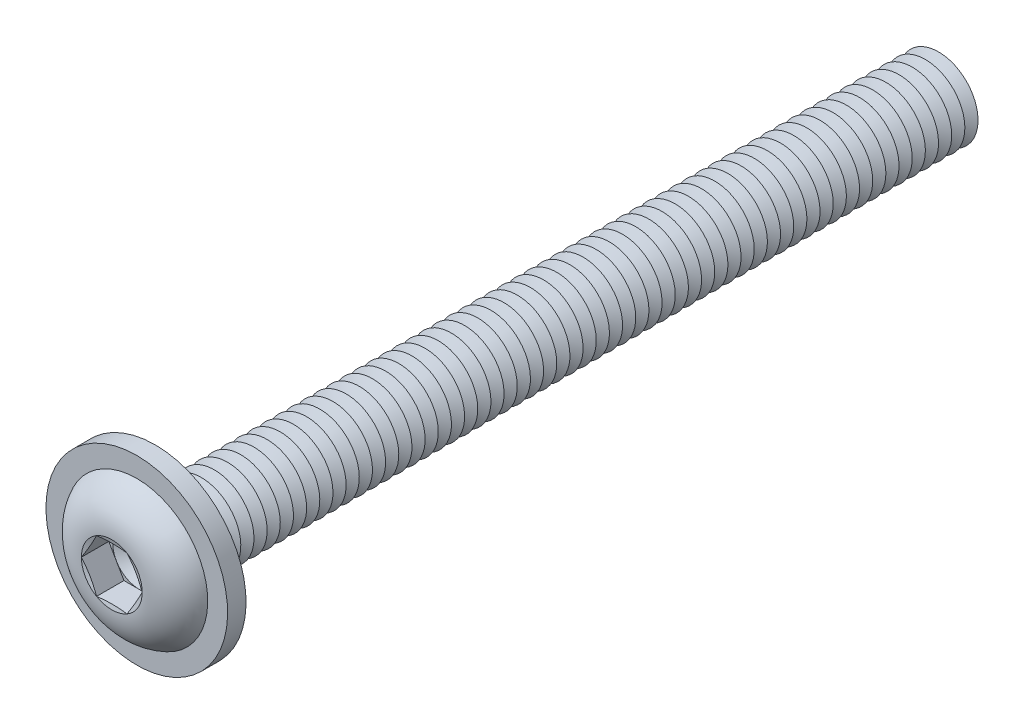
ISO-10303-21;
HEADER;
FILE_DESCRIPTION(('STEP AP214'),'2;1');
FILE_NAME('part.step','',(''),(''),'','','');
FILE_SCHEMA(('AUTOMOTIVE_DESIGN { 1 0 10303 214 1 1 1 1 }'));
ENDSEC;
DATA;
#1=APPLICATION_CONTEXT('core data for automotive mechanical design processes');
#2=APPLICATION_PROTOCOL_DEFINITION('international standard','automotive_design',2000,#1);
#3=PRODUCT_CONTEXT('',#1,'mechanical');
#4=PRODUCT('Part','Part','',(#3));
#5=PRODUCT_RELATED_PRODUCT_CATEGORY('part','',(#4));
#6=PRODUCT_DEFINITION_FORMATION('','',#4);
#7=PRODUCT_DEFINITION_CONTEXT('part definition',#1,'design');
#8=PRODUCT_DEFINITION('design','',#6,#7);
#9=PRODUCT_DEFINITION_SHAPE('','',#8);
#10=(LENGTH_UNIT() NAMED_UNIT(*) SI_UNIT(.MILLI.,.METRE.));
#11=(NAMED_UNIT(*) PLANE_ANGLE_UNIT() SI_UNIT($,.RADIAN.));
#12=(NAMED_UNIT(*) SI_UNIT($,.STERADIAN.) SOLID_ANGLE_UNIT());
#13=UNCERTAINTY_MEASURE_WITH_UNIT(LENGTH_MEASURE(1.E-05),#10,'distance_accuracy_value','');
#14=(GEOMETRIC_REPRESENTATION_CONTEXT(3) GLOBAL_UNCERTAINTY_ASSIGNED_CONTEXT((#13)) GLOBAL_UNIT_ASSIGNED_CONTEXT((#10,
#11,#12)) REPRESENTATION_CONTEXT('',''));
#15=CARTESIAN_POINT('',(0.,0.,0.));
#16=DIRECTION('',(0.,0.,1.));
#17=DIRECTION('',(1.,0.,0.));
#18=AXIS2_PLACEMENT_3D('',#15,#16,#17);
#19=CARTESIAN_POINT('',(0.,0.,-28.25));
#20=DIRECTION('',(0.,0.,1.));
#21=DIRECTION('',(0.,-1.,0.));
#22=AXIS2_PLACEMENT_3D('',#19,#20,#21);
#23=CONICAL_SURFACE('',#22,1.49999999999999,1.0471975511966);
#24=CARTESIAN_POINT('',(0.,0.,-28.5));
#25=DIRECTION('',(0.,0.,1.));
#26=DIRECTION('',(0.,-1.,0.));
#27=AXIS2_PLACEMENT_3D('',#24,#25,#26);
#28=CIRCLE('',#27,1.06698729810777);
#29=CARTESIAN_POINT('',(0.,-1.06698729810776,-28.5));
#30=VERTEX_POINT('',#29);
#31=EDGE_CURVE('E689',#30,#30,#28,.T.);
#32=ORIENTED_EDGE('',*,*,#31,.T.);
#33=EDGE_LOOP('',(#32));
#34=FACE_BOUND('',#33,.T.);
#35=CARTESIAN_POINT('',(0.,0.,-28.25));
#36=DIRECTION('',(0.,0.,1.));
#37=DIRECTION('',(0.,-1.,0.));
#38=AXIS2_PLACEMENT_3D('',#35,#36,#37);
#39=CIRCLE('',#38,1.49999999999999);
#40=CARTESIAN_POINT('',(0.,-1.49999999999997,-28.25));
#41=VERTEX_POINT('',#40);
#42=EDGE_CURVE('E685',#41,#41,#39,.T.);
#43=ORIENTED_EDGE('',*,*,#42,.F.);
#44=EDGE_LOOP('',(#43));
#45=FACE_BOUND('',#44,.T.);
#46=ADVANCED_FACE('F39',(#34,#45),#23,.T.);
#47=CARTESIAN_POINT('',(0.,0.,-28.5));
#48=DIRECTION('',(0.,0.,-1.));
#49=DIRECTION('',(0.,1.,0.));
#50=AXIS2_PLACEMENT_3D('',#47,#48,#49);
#51=CONICAL_SURFACE('',#50,1.06698729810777,1.0471975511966);
#52=CARTESIAN_POINT('',(0.,0.,-28.75));
#53=DIRECTION('',(0.,0.,1.));
#54=DIRECTION('',(0.,-1.,0.));
#55=AXIS2_PLACEMENT_3D('',#52,#53,#54);
#56=CIRCLE('',#55,1.49999999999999);
#57=CARTESIAN_POINT('',(0.,-1.49999999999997,-28.75));
#58=VERTEX_POINT('',#57);
#59=EDGE_CURVE('E693',#58,#58,#56,.T.);
#60=ORIENTED_EDGE('',*,*,#59,.T.);
#61=EDGE_LOOP('',(#60));
#62=FACE_BOUND('',#61,.T.);
#63=ORIENTED_EDGE('',*,*,#31,.F.);
#64=EDGE_LOOP('',(#63));
#65=FACE_BOUND('',#64,.T.);
#66=ADVANCED_FACE('F808',(#62,#65),#51,.T.);
#67=CARTESIAN_POINT('',(0.,1.5,-30.));
#68=DIRECTION('',(0.,0.,-1.));
#69=DIRECTION('',(0.,1.,0.));
#70=AXIS2_PLACEMENT_3D('',#67,#68,#69);
#71=PLANE('',#70);
#72=CARTESIAN_POINT('',(0.,0.,-30.));
#73=DIRECTION('',(0.,0.,1.));
#74=DIRECTION('',(0.,-1.,0.));
#75=AXIS2_PLACEMENT_3D('',#72,#73,#74);
#76=CIRCLE('',#75,1.06698729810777);
#77=CARTESIAN_POINT('',(0.,-1.06698729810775,-30.));
#78=VERTEX_POINT('',#77);
#79=EDGE_CURVE('E713',#78,#78,#76,.T.);
#80=ORIENTED_EDGE('',*,*,#79,.F.);
#81=EDGE_LOOP('',(#80));
#82=FACE_BOUND('',#81,.T.);
#83=ADVANCED_FACE('F814',(#82),#71,.T.);
#84=CARTESIAN_POINT('',(0.,0.,-29.75));
#85=DIRECTION('',(0.,0.,1.));
#86=DIRECTION('',(0.,-1.,0.));
#87=AXIS2_PLACEMENT_3D('',#84,#85,#86);
#88=CONICAL_SURFACE('',#87,1.49999999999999,1.0471975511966);
#89=ORIENTED_EDGE('',*,*,#79,.T.);
#90=EDGE_LOOP('',(#89));
#91=FACE_BOUND('',#90,.T.);
#92=CARTESIAN_POINT('',(0.,0.,-29.75));
#93=DIRECTION('',(0.,0.,1.));
#94=DIRECTION('',(0.,-1.,0.));
#95=AXIS2_PLACEMENT_3D('',#92,#93,#94);
#96=CIRCLE('',#95,1.49999999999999);
#97=CARTESIAN_POINT('',(0.,-1.49999999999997,-29.75));
#98=VERTEX_POINT('',#97);
#99=EDGE_CURVE('E709',#98,#98,#96,.T.);
#100=ORIENTED_EDGE('',*,*,#99,.F.);
#101=EDGE_LOOP('',(#100));
#102=FACE_BOUND('',#101,.T.);
#103=ADVANCED_FACE('F833',(#91,#102),#88,.T.);
#104=CARTESIAN_POINT('',(0.,0.,-29.5));
#105=DIRECTION('',(0.,0.,-1.));
#106=DIRECTION('',(0.,1.,0.));
#107=AXIS2_PLACEMENT_3D('',#104,#105,#106);
#108=CONICAL_SURFACE('',#107,1.06698729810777,1.0471975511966);
#109=ORIENTED_EDGE('',*,*,#99,.T.);
#110=EDGE_LOOP('',(#109));
#111=FACE_BOUND('',#110,.T.);
#112=CARTESIAN_POINT('',(0.,0.,-29.5));
#113=DIRECTION('',(0.,0.,1.));
#114=DIRECTION('',(0.,-1.,0.));
#115=AXIS2_PLACEMENT_3D('',#112,#113,#114);
#116=CIRCLE('',#115,1.06698729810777);
#117=CARTESIAN_POINT('',(0.,-1.06698729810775,-29.5));
#118=VERTEX_POINT('',#117);
#119=EDGE_CURVE('E705',#118,#118,#116,.T.);
#120=ORIENTED_EDGE('',*,*,#119,.F.);
#121=EDGE_LOOP('',(#120));
#122=FACE_BOUND('',#121,.T.);
#123=ADVANCED_FACE('F830',(#111,#122),#108,.T.);
#124=CARTESIAN_POINT('',(0.,0.,-29.25));
#125=DIRECTION('',(0.,0.,1.));
#126=DIRECTION('',(0.,-1.,0.));
#127=AXIS2_PLACEMENT_3D('',#124,#125,#126);
#128=CONICAL_SURFACE('',#127,1.49999999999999,1.0471975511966);
#129=ORIENTED_EDGE('',*,*,#119,.T.);
#130=EDGE_LOOP('',(#129));
#131=FACE_BOUND('',#130,.T.);
#132=CARTESIAN_POINT('',(0.,0.,-29.25));
#133=DIRECTION('',(0.,0.,1.));
#134=DIRECTION('',(0.,-1.,0.));
#135=AXIS2_PLACEMENT_3D('',#132,#133,#134);
#136=CIRCLE('',#135,1.49999999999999);
#137=CARTESIAN_POINT('',(0.,-1.49999999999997,-29.25));
#138=VERTEX_POINT('',#137);
#139=EDGE_CURVE('E701',#138,#138,#136,.T.);
#140=ORIENTED_EDGE('',*,*,#139,.F.);
#141=EDGE_LOOP('',(#140));
#142=FACE_BOUND('',#141,.T.);
#143=ADVANCED_FACE('F824',(#131,#142),#128,.T.);
#144=CARTESIAN_POINT('',(0.,0.,-29.));
#145=DIRECTION('',(0.,0.,-1.));
#146=DIRECTION('',(0.,1.,0.));
#147=AXIS2_PLACEMENT_3D('',#144,#145,#146);
#148=CONICAL_SURFACE('',#147,1.06698729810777,1.0471975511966);
#149=ORIENTED_EDGE('',*,*,#139,.T.);
#150=EDGE_LOOP('',(#149));
#151=FACE_BOUND('',#150,.T.);
#152=CARTESIAN_POINT('',(0.,0.,-29.));
#153=DIRECTION('',(0.,0.,1.));
#154=DIRECTION('',(0.,-1.,0.));
#155=AXIS2_PLACEMENT_3D('',#152,#153,#154);
#156=CIRCLE('',#155,1.06698729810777);
#157=CARTESIAN_POINT('',(0.,-1.06698729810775,-29.));
#158=VERTEX_POINT('',#157);
#159=EDGE_CURVE('E697',#158,#158,#156,.T.);
#160=ORIENTED_EDGE('',*,*,#159,.F.);
#161=EDGE_LOOP('',(#160));
#162=FACE_BOUND('',#161,.T.);
#163=ADVANCED_FACE('F820',(#151,#162),#148,.T.);
#164=CARTESIAN_POINT('',(0.,0.,-28.75));
#165=DIRECTION('',(0.,0.,1.));
#166=DIRECTION('',(0.,-1.,0.));
#167=AXIS2_PLACEMENT_3D('',#164,#165,#166);
#168=CONICAL_SURFACE('',#167,1.49999999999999,1.0471975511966);
#169=ORIENTED_EDGE('',*,*,#159,.T.);
#170=EDGE_LOOP('',(#169));
#171=FACE_BOUND('',#170,.T.);
#172=ORIENTED_EDGE('',*,*,#59,.F.);
#173=EDGE_LOOP('',(#172));
#174=FACE_BOUND('',#173,.T.);
#175=ADVANCED_FACE('F823',(#171,#174),#168,.T.);
#176=CARTESIAN_POINT('',(0.,0.,-27.75));
#177=DIRECTION('',(0.,0.,1.));
#178=DIRECTION('',(0.,-1.,0.));
#179=AXIS2_PLACEMENT_3D('',#176,#177,#178);
#180=CONICAL_SURFACE('',#179,1.49999999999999,1.0471975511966);
#181=CARTESIAN_POINT('',(0.,0.,-28.));
#182=DIRECTION('',(0.,0.,1.));
#183=DIRECTION('',(0.,-1.,0.));
#184=AXIS2_PLACEMENT_3D('',#181,#182,#183);
#185=CIRCLE('',#184,1.06698729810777);
#186=CARTESIAN_POINT('',(0.,-1.06698729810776,-28.));
#187=VERTEX_POINT('',#186);
#188=EDGE_CURVE('E681',#187,#187,#185,.T.);
#189=ORIENTED_EDGE('',*,*,#188,.T.);
#190=EDGE_LOOP('',(#189));
#191=FACE_BOUND('',#190,.T.);
#192=CARTESIAN_POINT('',(0.,0.,-27.75));
#193=DIRECTION('',(0.,0.,1.));
#194=DIRECTION('',(0.,-1.,0.));
#195=AXIS2_PLACEMENT_3D('',#192,#193,#194);
#196=CIRCLE('',#195,1.49999999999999);
#197=CARTESIAN_POINT('',(0.,-1.49999999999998,-27.75));
#198=VERTEX_POINT('',#197);
#199=EDGE_CURVE('E677',#198,#198,#196,.T.);
#200=ORIENTED_EDGE('',*,*,#199,.F.);
#201=EDGE_LOOP('',(#200));
#202=FACE_BOUND('',#201,.T.);
#203=ADVANCED_FACE('F828',(#191,#202),#180,.T.);
#204=CARTESIAN_POINT('',(0.,0.,-28.));
#205=DIRECTION('',(0.,0.,-1.));
#206=DIRECTION('',(0.,1.,0.));
#207=AXIS2_PLACEMENT_3D('',#204,#205,#206);
#208=CONICAL_SURFACE('',#207,1.06698729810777,1.0471975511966);
#209=ORIENTED_EDGE('',*,*,#42,.T.);
#210=EDGE_LOOP('',(#209));
#211=FACE_BOUND('',#210,.T.);
#212=ORIENTED_EDGE('',*,*,#188,.F.);
#213=EDGE_LOOP('',(#212));
#214=FACE_BOUND('',#213,.T.);
#215=ADVANCED_FACE('F879',(#211,#214),#208,.T.);
#216=CARTESIAN_POINT('',(0.,0.,-27.25));
#217=DIRECTION('',(0.,0.,1.));
#218=DIRECTION('',(0.,-1.,0.));
#219=AXIS2_PLACEMENT_3D('',#216,#217,#218);
#220=CONICAL_SURFACE('',#219,1.49999999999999,1.0471975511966);
#221=CARTESIAN_POINT('',(0.,0.,-27.5));
#222=DIRECTION('',(0.,0.,1.));
#223=DIRECTION('',(0.,-1.,0.));
#224=AXIS2_PLACEMENT_3D('',#221,#222,#223);
#225=CIRCLE('',#224,1.06698729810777);
#226=CARTESIAN_POINT('',(0.,-1.06698729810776,-27.5));
#227=VERTEX_POINT('',#226);
#228=EDGE_CURVE('E673',#227,#227,#225,.T.);
#229=ORIENTED_EDGE('',*,*,#228,.T.);
#230=EDGE_LOOP('',(#229));
#231=FACE_BOUND('',#230,.T.);
#232=CARTESIAN_POINT('',(0.,0.,-27.25));
#233=DIRECTION('',(0.,0.,1.));
#234=DIRECTION('',(0.,-1.,0.));
#235=AXIS2_PLACEMENT_3D('',#232,#233,#234);
#236=CIRCLE('',#235,1.49999999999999);
#237=CARTESIAN_POINT('',(0.,-1.49999999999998,-27.25));
#238=VERTEX_POINT('',#237);
#239=EDGE_CURVE('E669',#238,#238,#236,.T.);
#240=ORIENTED_EDGE('',*,*,#239,.F.);
#241=EDGE_LOOP('',(#240));
#242=FACE_BOUND('',#241,.T.);
#243=ADVANCED_FACE('F885',(#231,#242),#220,.T.);
#244=CARTESIAN_POINT('',(0.,0.,-27.5));
#245=DIRECTION('',(0.,0.,-1.));
#246=DIRECTION('',(0.,1.,0.));
#247=AXIS2_PLACEMENT_3D('',#244,#245,#246);
#248=CONICAL_SURFACE('',#247,1.06698729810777,1.0471975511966);
#249=ORIENTED_EDGE('',*,*,#199,.T.);
#250=EDGE_LOOP('',(#249));
#251=FACE_BOUND('',#250,.T.);
#252=ORIENTED_EDGE('',*,*,#228,.F.);
#253=EDGE_LOOP('',(#252));
#254=FACE_BOUND('',#253,.T.);
#255=ADVANCED_FACE('F892',(#251,#254),#248,.T.);
#256=CARTESIAN_POINT('',(0.,0.,-26.75));
#257=DIRECTION('',(0.,0.,1.));
#258=DIRECTION('',(0.,-1.,0.));
#259=AXIS2_PLACEMENT_3D('',#256,#257,#258);
#260=CONICAL_SURFACE('',#259,1.49999999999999,1.0471975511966);
#261=CARTESIAN_POINT('',(0.,0.,-27.));
#262=DIRECTION('',(0.,0.,1.));
#263=DIRECTION('',(0.,-1.,0.));
#264=AXIS2_PLACEMENT_3D('',#261,#262,#263);
#265=CIRCLE('',#264,1.06698729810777);
#266=CARTESIAN_POINT('',(0.,-1.06698729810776,-27.));
#267=VERTEX_POINT('',#266);
#268=EDGE_CURVE('E665',#267,#267,#265,.T.);
#269=ORIENTED_EDGE('',*,*,#268,.T.);
#270=EDGE_LOOP('',(#269));
#271=FACE_BOUND('',#270,.T.);
#272=CARTESIAN_POINT('',(0.,0.,-26.75));
#273=DIRECTION('',(0.,0.,1.));
#274=DIRECTION('',(0.,-1.,0.));
#275=AXIS2_PLACEMENT_3D('',#272,#273,#274);
#276=CIRCLE('',#275,1.49999999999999);
#277=CARTESIAN_POINT('',(0.,-1.49999999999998,-26.75));
#278=VERTEX_POINT('',#277);
#279=EDGE_CURVE('E661',#278,#278,#276,.T.);
#280=ORIENTED_EDGE('',*,*,#279,.F.);
#281=EDGE_LOOP('',(#280));
#282=FACE_BOUND('',#281,.T.);
#283=ADVANCED_FACE('F899',(#271,#282),#260,.T.);
#284=CARTESIAN_POINT('',(0.,0.,-27.));
#285=DIRECTION('',(0.,0.,-1.));
#286=DIRECTION('',(0.,1.,0.));
#287=AXIS2_PLACEMENT_3D('',#284,#285,#286);
#288=CONICAL_SURFACE('',#287,1.06698729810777,1.0471975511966);
#289=ORIENTED_EDGE('',*,*,#239,.T.);
#290=EDGE_LOOP('',(#289));
#291=FACE_BOUND('',#290,.T.);
#292=ORIENTED_EDGE('',*,*,#268,.F.);
#293=EDGE_LOOP('',(#292));
#294=FACE_BOUND('',#293,.T.);
#295=ADVANCED_FACE('F906',(#291,#294),#288,.T.);
#296=CARTESIAN_POINT('',(0.,0.,-26.25));
#297=DIRECTION('',(0.,0.,1.));
#298=DIRECTION('',(0.,-1.,0.));
#299=AXIS2_PLACEMENT_3D('',#296,#297,#298);
#300=CONICAL_SURFACE('',#299,1.49999999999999,1.0471975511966);
#301=CARTESIAN_POINT('',(0.,0.,-26.5));
#302=DIRECTION('',(0.,0.,1.));
#303=DIRECTION('',(0.,-1.,0.));
#304=AXIS2_PLACEMENT_3D('',#301,#302,#303);
#305=CIRCLE('',#304,1.06698729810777);
#306=CARTESIAN_POINT('',(0.,-1.06698729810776,-26.5));
#307=VERTEX_POINT('',#306);
#308=EDGE_CURVE('E657',#307,#307,#305,.T.);
#309=ORIENTED_EDGE('',*,*,#308,.T.);
#310=EDGE_LOOP('',(#309));
#311=FACE_BOUND('',#310,.T.);
#312=CARTESIAN_POINT('',(0.,0.,-26.25));
#313=DIRECTION('',(0.,0.,1.));
#314=DIRECTION('',(0.,-1.,0.));
#315=AXIS2_PLACEMENT_3D('',#312,#313,#314);
#316=CIRCLE('',#315,1.49999999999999);
#317=CARTESIAN_POINT('',(0.,-1.49999999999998,-26.25));
#318=VERTEX_POINT('',#317);
#319=EDGE_CURVE('E653',#318,#318,#316,.T.);
#320=ORIENTED_EDGE('',*,*,#319,.F.);
#321=EDGE_LOOP('',(#320));
#322=FACE_BOUND('',#321,.T.);
#323=ADVANCED_FACE('F913',(#311,#322),#300,.T.);
#324=CARTESIAN_POINT('',(0.,0.,-26.5));
#325=DIRECTION('',(0.,0.,-1.));
#326=DIRECTION('',(0.,1.,0.));
#327=AXIS2_PLACEMENT_3D('',#324,#325,#326);
#328=CONICAL_SURFACE('',#327,1.06698729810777,1.0471975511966);
#329=ORIENTED_EDGE('',*,*,#279,.T.);
#330=EDGE_LOOP('',(#329));
#331=FACE_BOUND('',#330,.T.);
#332=ORIENTED_EDGE('',*,*,#308,.F.);
#333=EDGE_LOOP('',(#332));
#334=FACE_BOUND('',#333,.T.);
#335=ADVANCED_FACE('F920',(#331,#334),#328,.T.);
#336=CARTESIAN_POINT('',(0.,0.,-25.75));
#337=DIRECTION('',(0.,0.,1.));
#338=DIRECTION('',(0.,-1.,0.));
#339=AXIS2_PLACEMENT_3D('',#336,#337,#338);
#340=CONICAL_SURFACE('',#339,1.49999999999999,1.0471975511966);
#341=CARTESIAN_POINT('',(0.,0.,-26.));
#342=DIRECTION('',(0.,0.,1.));
#343=DIRECTION('',(0.,-1.,0.));
#344=AXIS2_PLACEMENT_3D('',#341,#342,#343);
#345=CIRCLE('',#344,1.06698729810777);
#346=CARTESIAN_POINT('',(0.,-1.06698729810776,-26.));
#347=VERTEX_POINT('',#346);
#348=EDGE_CURVE('E649',#347,#347,#345,.T.);
#349=ORIENTED_EDGE('',*,*,#348,.T.);
#350=EDGE_LOOP('',(#349));
#351=FACE_BOUND('',#350,.T.);
#352=CARTESIAN_POINT('',(0.,0.,-25.75));
#353=DIRECTION('',(0.,0.,1.));
#354=DIRECTION('',(0.,-1.,0.));
#355=AXIS2_PLACEMENT_3D('',#352,#353,#354);
#356=CIRCLE('',#355,1.49999999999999);
#357=CARTESIAN_POINT('',(0.,-1.49999999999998,-25.75));
#358=VERTEX_POINT('',#357);
#359=EDGE_CURVE('E645',#358,#358,#356,.T.);
#360=ORIENTED_EDGE('',*,*,#359,.F.);
#361=EDGE_LOOP('',(#360));
#362=FACE_BOUND('',#361,.T.);
#363=ADVANCED_FACE('F927',(#351,#362),#340,.T.);
#364=CARTESIAN_POINT('',(0.,0.,-26.));
#365=DIRECTION('',(0.,0.,-1.));
#366=DIRECTION('',(0.,1.,0.));
#367=AXIS2_PLACEMENT_3D('',#364,#365,#366);
#368=CONICAL_SURFACE('',#367,1.06698729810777,1.0471975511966);
#369=ORIENTED_EDGE('',*,*,#319,.T.);
#370=EDGE_LOOP('',(#369));
#371=FACE_BOUND('',#370,.T.);
#372=ORIENTED_EDGE('',*,*,#348,.F.);
#373=EDGE_LOOP('',(#372));
#374=FACE_BOUND('',#373,.T.);
#375=ADVANCED_FACE('F934',(#371,#374),#368,.T.);
#376=CARTESIAN_POINT('',(0.,0.,-25.25));
#377=DIRECTION('',(0.,0.,1.));
#378=DIRECTION('',(0.,-1.,0.));
#379=AXIS2_PLACEMENT_3D('',#376,#377,#378);
#380=CONICAL_SURFACE('',#379,1.49999999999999,1.0471975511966);
#381=CARTESIAN_POINT('',(0.,0.,-25.5));
#382=DIRECTION('',(0.,0.,1.));
#383=DIRECTION('',(0.,-1.,0.));
#384=AXIS2_PLACEMENT_3D('',#381,#382,#383);
#385=CIRCLE('',#384,1.06698729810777);
#386=CARTESIAN_POINT('',(0.,-1.06698729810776,-25.5));
#387=VERTEX_POINT('',#386);
#388=EDGE_CURVE('E641',#387,#387,#385,.T.);
#389=ORIENTED_EDGE('',*,*,#388,.T.);
#390=EDGE_LOOP('',(#389));
#391=FACE_BOUND('',#390,.T.);
#392=CARTESIAN_POINT('',(0.,0.,-25.25));
#393=DIRECTION('',(0.,0.,1.));
#394=DIRECTION('',(0.,-1.,0.));
#395=AXIS2_PLACEMENT_3D('',#392,#393,#394);
#396=CIRCLE('',#395,1.49999999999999);
#397=CARTESIAN_POINT('',(0.,-1.49999999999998,-25.25));
#398=VERTEX_POINT('',#397);
#399=EDGE_CURVE('E637',#398,#398,#396,.T.);
#400=ORIENTED_EDGE('',*,*,#399,.F.);
#401=EDGE_LOOP('',(#400));
#402=FACE_BOUND('',#401,.T.);
#403=ADVANCED_FACE('F941',(#391,#402),#380,.T.);
#404=CARTESIAN_POINT('',(0.,0.,-25.5));
#405=DIRECTION('',(0.,0.,-1.));
#406=DIRECTION('',(0.,1.,0.));
#407=AXIS2_PLACEMENT_3D('',#404,#405,#406);
#408=CONICAL_SURFACE('',#407,1.06698729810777,1.0471975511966);
#409=ORIENTED_EDGE('',*,*,#359,.T.);
#410=EDGE_LOOP('',(#409));
#411=FACE_BOUND('',#410,.T.);
#412=ORIENTED_EDGE('',*,*,#388,.F.);
#413=EDGE_LOOP('',(#412));
#414=FACE_BOUND('',#413,.T.);
#415=ADVANCED_FACE('F948',(#411,#414),#408,.T.);
#416=CARTESIAN_POINT('',(0.,0.,-24.75));
#417=DIRECTION('',(0.,0.,1.));
#418=DIRECTION('',(0.,-1.,0.));
#419=AXIS2_PLACEMENT_3D('',#416,#417,#418);
#420=CONICAL_SURFACE('',#419,1.49999999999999,1.0471975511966);
#421=CARTESIAN_POINT('',(0.,0.,-25.));
#422=DIRECTION('',(0.,0.,1.));
#423=DIRECTION('',(0.,-1.,0.));
#424=AXIS2_PLACEMENT_3D('',#421,#422,#423);
#425=CIRCLE('',#424,1.06698729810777);
#426=CARTESIAN_POINT('',(0.,-1.06698729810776,-25.));
#427=VERTEX_POINT('',#426);
#428=EDGE_CURVE('E633',#427,#427,#425,.T.);
#429=ORIENTED_EDGE('',*,*,#428,.T.);
#430=EDGE_LOOP('',(#429));
#431=FACE_BOUND('',#430,.T.);
#432=CARTESIAN_POINT('',(0.,0.,-24.75));
#433=DIRECTION('',(0.,0.,1.));
#434=DIRECTION('',(0.,-1.,0.));
#435=AXIS2_PLACEMENT_3D('',#432,#433,#434);
#436=CIRCLE('',#435,1.49999999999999);
#437=CARTESIAN_POINT('',(0.,-1.49999999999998,-24.75));
#438=VERTEX_POINT('',#437);
#439=EDGE_CURVE('E629',#438,#438,#436,.T.);
#440=ORIENTED_EDGE('',*,*,#439,.F.);
#441=EDGE_LOOP('',(#440));
#442=FACE_BOUND('',#441,.T.);
#443=ADVANCED_FACE('F955',(#431,#442),#420,.T.);
#444=CARTESIAN_POINT('',(0.,0.,-25.));
#445=DIRECTION('',(0.,0.,-1.));
#446=DIRECTION('',(0.,1.,0.));
#447=AXIS2_PLACEMENT_3D('',#444,#445,#446);
#448=CONICAL_SURFACE('',#447,1.06698729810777,1.0471975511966);
#449=ORIENTED_EDGE('',*,*,#399,.T.);
#450=EDGE_LOOP('',(#449));
#451=FACE_BOUND('',#450,.T.);
#452=ORIENTED_EDGE('',*,*,#428,.F.);
#453=EDGE_LOOP('',(#452));
#454=FACE_BOUND('',#453,.T.);
#455=ADVANCED_FACE('F962',(#451,#454),#448,.T.);
#456=CARTESIAN_POINT('',(0.,0.,-24.25));
#457=DIRECTION('',(0.,0.,1.));
#458=DIRECTION('',(0.,-1.,0.));
#459=AXIS2_PLACEMENT_3D('',#456,#457,#458);
#460=CONICAL_SURFACE('',#459,1.49999999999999,1.0471975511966);
#461=CARTESIAN_POINT('',(0.,0.,-24.5));
#462=DIRECTION('',(0.,0.,1.));
#463=DIRECTION('',(0.,-1.,0.));
#464=AXIS2_PLACEMENT_3D('',#461,#462,#463);
#465=CIRCLE('',#464,1.06698729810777);
#466=CARTESIAN_POINT('',(0.,-1.06698729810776,-24.5));
#467=VERTEX_POINT('',#466);
#468=EDGE_CURVE('E625',#467,#467,#465,.T.);
#469=ORIENTED_EDGE('',*,*,#468,.T.);
#470=EDGE_LOOP('',(#469));
#471=FACE_BOUND('',#470,.T.);
#472=CARTESIAN_POINT('',(0.,0.,-24.25));
#473=DIRECTION('',(0.,0.,1.));
#474=DIRECTION('',(0.,-1.,0.));
#475=AXIS2_PLACEMENT_3D('',#472,#473,#474);
#476=CIRCLE('',#475,1.49999999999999);
#477=CARTESIAN_POINT('',(0.,-1.49999999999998,-24.25));
#478=VERTEX_POINT('',#477);
#479=EDGE_CURVE('E621',#478,#478,#476,.T.);
#480=ORIENTED_EDGE('',*,*,#479,.F.);
#481=EDGE_LOOP('',(#480));
#482=FACE_BOUND('',#481,.T.);
#483=ADVANCED_FACE('F969',(#471,#482),#460,.T.);
#484=CARTESIAN_POINT('',(0.,0.,-24.5));
#485=DIRECTION('',(0.,0.,-1.));
#486=DIRECTION('',(0.,1.,0.));
#487=AXIS2_PLACEMENT_3D('',#484,#485,#486);
#488=CONICAL_SURFACE('',#487,1.06698729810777,1.0471975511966);
#489=ORIENTED_EDGE('',*,*,#439,.T.);
#490=EDGE_LOOP('',(#489));
#491=FACE_BOUND('',#490,.T.);
#492=ORIENTED_EDGE('',*,*,#468,.F.);
#493=EDGE_LOOP('',(#492));
#494=FACE_BOUND('',#493,.T.);
#495=ADVANCED_FACE('F976',(#491,#494),#488,.T.);
#496=CARTESIAN_POINT('',(0.,0.,-23.75));
#497=DIRECTION('',(0.,0.,1.));
#498=DIRECTION('',(0.,-1.,0.));
#499=AXIS2_PLACEMENT_3D('',#496,#497,#498);
#500=CONICAL_SURFACE('',#499,1.49999999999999,1.0471975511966);
#501=CARTESIAN_POINT('',(0.,0.,-24.));
#502=DIRECTION('',(0.,0.,1.));
#503=DIRECTION('',(0.,-1.,0.));
#504=AXIS2_PLACEMENT_3D('',#501,#502,#503);
#505=CIRCLE('',#504,1.06698729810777);
#506=CARTESIAN_POINT('',(0.,-1.06698729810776,-24.));
#507=VERTEX_POINT('',#506);
#508=EDGE_CURVE('E617',#507,#507,#505,.T.);
#509=ORIENTED_EDGE('',*,*,#508,.T.);
#510=EDGE_LOOP('',(#509));
#511=FACE_BOUND('',#510,.T.);
#512=CARTESIAN_POINT('',(0.,0.,-23.75));
#513=DIRECTION('',(0.,0.,1.));
#514=DIRECTION('',(0.,-1.,0.));
#515=AXIS2_PLACEMENT_3D('',#512,#513,#514);
#516=CIRCLE('',#515,1.49999999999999);
#517=CARTESIAN_POINT('',(0.,-1.49999999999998,-23.75));
#518=VERTEX_POINT('',#517);
#519=EDGE_CURVE('E613',#518,#518,#516,.T.);
#520=ORIENTED_EDGE('',*,*,#519,.F.);
#521=EDGE_LOOP('',(#520));
#522=FACE_BOUND('',#521,.T.);
#523=ADVANCED_FACE('F983',(#511,#522),#500,.T.);
#524=CARTESIAN_POINT('',(0.,0.,-24.));
#525=DIRECTION('',(0.,0.,-1.));
#526=DIRECTION('',(0.,1.,0.));
#527=AXIS2_PLACEMENT_3D('',#524,#525,#526);
#528=CONICAL_SURFACE('',#527,1.06698729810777,1.0471975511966);
#529=ORIENTED_EDGE('',*,*,#479,.T.);
#530=EDGE_LOOP('',(#529));
#531=FACE_BOUND('',#530,.T.);
#532=ORIENTED_EDGE('',*,*,#508,.F.);
#533=EDGE_LOOP('',(#532));
#534=FACE_BOUND('',#533,.T.);
#535=ADVANCED_FACE('F990',(#531,#534),#528,.T.);
#536=CARTESIAN_POINT('',(0.,0.,-23.25));
#537=DIRECTION('',(0.,0.,1.));
#538=DIRECTION('',(0.,-1.,0.));
#539=AXIS2_PLACEMENT_3D('',#536,#537,#538);
#540=CONICAL_SURFACE('',#539,1.49999999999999,1.0471975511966);
#541=CARTESIAN_POINT('',(0.,0.,-23.5));
#542=DIRECTION('',(0.,0.,1.));
#543=DIRECTION('',(0.,-1.,0.));
#544=AXIS2_PLACEMENT_3D('',#541,#542,#543);
#545=CIRCLE('',#544,1.06698729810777);
#546=CARTESIAN_POINT('',(0.,-1.06698729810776,-23.5));
#547=VERTEX_POINT('',#546);
#548=EDGE_CURVE('E609',#547,#547,#545,.T.);
#549=ORIENTED_EDGE('',*,*,#548,.T.);
#550=EDGE_LOOP('',(#549));
#551=FACE_BOUND('',#550,.T.);
#552=CARTESIAN_POINT('',(0.,0.,-23.25));
#553=DIRECTION('',(0.,0.,1.));
#554=DIRECTION('',(0.,-1.,0.));
#555=AXIS2_PLACEMENT_3D('',#552,#553,#554);
#556=CIRCLE('',#555,1.49999999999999);
#557=CARTESIAN_POINT('',(0.,-1.49999999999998,-23.25));
#558=VERTEX_POINT('',#557);
#559=EDGE_CURVE('E605',#558,#558,#556,.T.);
#560=ORIENTED_EDGE('',*,*,#559,.F.);
#561=EDGE_LOOP('',(#560));
#562=FACE_BOUND('',#561,.T.);
#563=ADVANCED_FACE('F997',(#551,#562),#540,.T.);
#564=CARTESIAN_POINT('',(0.,0.,-23.5));
#565=DIRECTION('',(0.,0.,-1.));
#566=DIRECTION('',(0.,1.,0.));
#567=AXIS2_PLACEMENT_3D('',#564,#565,#566);
#568=CONICAL_SURFACE('',#567,1.06698729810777,1.0471975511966);
#569=ORIENTED_EDGE('',*,*,#519,.T.);
#570=EDGE_LOOP('',(#569));
#571=FACE_BOUND('',#570,.T.);
#572=ORIENTED_EDGE('',*,*,#548,.F.);
#573=EDGE_LOOP('',(#572));
#574=FACE_BOUND('',#573,.T.);
#575=ADVANCED_FACE('F1004',(#571,#574),#568,.T.);
#576=CARTESIAN_POINT('',(0.,0.,-22.75));
#577=DIRECTION('',(0.,0.,1.));
#578=DIRECTION('',(0.,-1.,0.));
#579=AXIS2_PLACEMENT_3D('',#576,#577,#578);
#580=CONICAL_SURFACE('',#579,1.49999999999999,1.0471975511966);
#581=CARTESIAN_POINT('',(0.,0.,-23.));
#582=DIRECTION('',(0.,0.,1.));
#583=DIRECTION('',(0.,-1.,0.));
#584=AXIS2_PLACEMENT_3D('',#581,#582,#583);
#585=CIRCLE('',#584,1.06698729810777);
#586=CARTESIAN_POINT('',(0.,-1.06698729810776,-23.));
#587=VERTEX_POINT('',#586);
#588=EDGE_CURVE('E601',#587,#587,#585,.T.);
#589=ORIENTED_EDGE('',*,*,#588,.T.);
#590=EDGE_LOOP('',(#589));
#591=FACE_BOUND('',#590,.T.);
#592=CARTESIAN_POINT('',(0.,0.,-22.75));
#593=DIRECTION('',(0.,0.,1.));
#594=DIRECTION('',(0.,-1.,0.));
#595=AXIS2_PLACEMENT_3D('',#592,#593,#594);
#596=CIRCLE('',#595,1.49999999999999);
#597=CARTESIAN_POINT('',(0.,-1.49999999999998,-22.75));
#598=VERTEX_POINT('',#597);
#599=EDGE_CURVE('E597',#598,#598,#596,.T.);
#600=ORIENTED_EDGE('',*,*,#599,.F.);
#601=EDGE_LOOP('',(#600));
#602=FACE_BOUND('',#601,.T.);
#603=ADVANCED_FACE('F1011',(#591,#602),#580,.T.);
#604=CARTESIAN_POINT('',(0.,0.,-23.));
#605=DIRECTION('',(0.,0.,-1.));
#606=DIRECTION('',(0.,1.,0.));
#607=AXIS2_PLACEMENT_3D('',#604,#605,#606);
#608=CONICAL_SURFACE('',#607,1.06698729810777,1.0471975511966);
#609=ORIENTED_EDGE('',*,*,#559,.T.);
#610=EDGE_LOOP('',(#609));
#611=FACE_BOUND('',#610,.T.);
#612=ORIENTED_EDGE('',*,*,#588,.F.);
#613=EDGE_LOOP('',(#612));
#614=FACE_BOUND('',#613,.T.);
#615=ADVANCED_FACE('F1018',(#611,#614),#608,.T.);
#616=CARTESIAN_POINT('',(0.,0.,-22.25));
#617=DIRECTION('',(0.,0.,1.));
#618=DIRECTION('',(0.,-1.,0.));
#619=AXIS2_PLACEMENT_3D('',#616,#617,#618);
#620=CONICAL_SURFACE('',#619,1.49999999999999,1.0471975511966);
#621=CARTESIAN_POINT('',(0.,0.,-22.5));
#622=DIRECTION('',(0.,0.,1.));
#623=DIRECTION('',(0.,-1.,0.));
#624=AXIS2_PLACEMENT_3D('',#621,#622,#623);
#625=CIRCLE('',#624,1.06698729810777);
#626=CARTESIAN_POINT('',(0.,-1.06698729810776,-22.5));
#627=VERTEX_POINT('',#626);
#628=EDGE_CURVE('E593',#627,#627,#625,.T.);
#629=ORIENTED_EDGE('',*,*,#628,.T.);
#630=EDGE_LOOP('',(#629));
#631=FACE_BOUND('',#630,.T.);
#632=CARTESIAN_POINT('',(0.,0.,-22.25));
#633=DIRECTION('',(0.,0.,1.));
#634=DIRECTION('',(0.,-1.,0.));
#635=AXIS2_PLACEMENT_3D('',#632,#633,#634);
#636=CIRCLE('',#635,1.49999999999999);
#637=CARTESIAN_POINT('',(0.,-1.49999999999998,-22.25));
#638=VERTEX_POINT('',#637);
#639=EDGE_CURVE('E589',#638,#638,#636,.T.);
#640=ORIENTED_EDGE('',*,*,#639,.F.);
#641=EDGE_LOOP('',(#640));
#642=FACE_BOUND('',#641,.T.);
#643=ADVANCED_FACE('F1025',(#631,#642),#620,.T.);
#644=CARTESIAN_POINT('',(0.,0.,-22.5));
#645=DIRECTION('',(0.,0.,-1.));
#646=DIRECTION('',(0.,1.,0.));
#647=AXIS2_PLACEMENT_3D('',#644,#645,#646);
#648=CONICAL_SURFACE('',#647,1.06698729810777,1.0471975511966);
#649=ORIENTED_EDGE('',*,*,#599,.T.);
#650=EDGE_LOOP('',(#649));
#651=FACE_BOUND('',#650,.T.);
#652=ORIENTED_EDGE('',*,*,#628,.F.);
#653=EDGE_LOOP('',(#652));
#654=FACE_BOUND('',#653,.T.);
#655=ADVANCED_FACE('F1032',(#651,#654),#648,.T.);
#656=CARTESIAN_POINT('',(0.,0.,-21.75));
#657=DIRECTION('',(0.,0.,1.));
#658=DIRECTION('',(0.,-1.,0.));
#659=AXIS2_PLACEMENT_3D('',#656,#657,#658);
#660=CONICAL_SURFACE('',#659,1.49999999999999,1.0471975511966);
#661=CARTESIAN_POINT('',(0.,0.,-22.));
#662=DIRECTION('',(0.,0.,1.));
#663=DIRECTION('',(0.,-1.,0.));
#664=AXIS2_PLACEMENT_3D('',#661,#662,#663);
#665=CIRCLE('',#664,1.06698729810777);
#666=CARTESIAN_POINT('',(0.,-1.06698729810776,-22.));
#667=VERTEX_POINT('',#666);
#668=EDGE_CURVE('E585',#667,#667,#665,.T.);
#669=ORIENTED_EDGE('',*,*,#668,.T.);
#670=EDGE_LOOP('',(#669));
#671=FACE_BOUND('',#670,.T.);
#672=CARTESIAN_POINT('',(0.,0.,-21.75));
#673=DIRECTION('',(0.,0.,1.));
#674=DIRECTION('',(0.,-1.,0.));
#675=AXIS2_PLACEMENT_3D('',#672,#673,#674);
#676=CIRCLE('',#675,1.49999999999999);
#677=CARTESIAN_POINT('',(0.,-1.49999999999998,-21.75));
#678=VERTEX_POINT('',#677);
#679=EDGE_CURVE('E581',#678,#678,#676,.T.);
#680=ORIENTED_EDGE('',*,*,#679,.F.);
#681=EDGE_LOOP('',(#680));
#682=FACE_BOUND('',#681,.T.);
#683=ADVANCED_FACE('F1039',(#671,#682),#660,.T.);
#684=CARTESIAN_POINT('',(0.,0.,-22.));
#685=DIRECTION('',(0.,0.,-1.));
#686=DIRECTION('',(0.,1.,0.));
#687=AXIS2_PLACEMENT_3D('',#684,#685,#686);
#688=CONICAL_SURFACE('',#687,1.06698729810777,1.0471975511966);
#689=ORIENTED_EDGE('',*,*,#639,.T.);
#690=EDGE_LOOP('',(#689));
#691=FACE_BOUND('',#690,.T.);
#692=ORIENTED_EDGE('',*,*,#668,.F.);
#693=EDGE_LOOP('',(#692));
#694=FACE_BOUND('',#693,.T.);
#695=ADVANCED_FACE('F1046',(#691,#694),#688,.T.);
#696=CARTESIAN_POINT('',(0.,0.,-21.25));
#697=DIRECTION('',(0.,0.,1.));
#698=DIRECTION('',(0.,-1.,0.));
#699=AXIS2_PLACEMENT_3D('',#696,#697,#698);
#700=CONICAL_SURFACE('',#699,1.49999999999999,1.0471975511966);
#701=CARTESIAN_POINT('',(0.,0.,-21.5));
#702=DIRECTION('',(0.,0.,1.));
#703=DIRECTION('',(0.,-1.,0.));
#704=AXIS2_PLACEMENT_3D('',#701,#702,#703);
#705=CIRCLE('',#704,1.06698729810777);
#706=CARTESIAN_POINT('',(0.,-1.06698729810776,-21.5));
#707=VERTEX_POINT('',#706);
#708=EDGE_CURVE('E577',#707,#707,#705,.T.);
#709=ORIENTED_EDGE('',*,*,#708,.T.);
#710=EDGE_LOOP('',(#709));
#711=FACE_BOUND('',#710,.T.);
#712=CARTESIAN_POINT('',(0.,0.,-21.25));
#713=DIRECTION('',(0.,0.,1.));
#714=DIRECTION('',(0.,-1.,0.));
#715=AXIS2_PLACEMENT_3D('',#712,#713,#714);
#716=CIRCLE('',#715,1.49999999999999);
#717=CARTESIAN_POINT('',(0.,-1.49999999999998,-21.25));
#718=VERTEX_POINT('',#717);
#719=EDGE_CURVE('E573',#718,#718,#716,.T.);
#720=ORIENTED_EDGE('',*,*,#719,.F.);
#721=EDGE_LOOP('',(#720));
#722=FACE_BOUND('',#721,.T.);
#723=ADVANCED_FACE('F1053',(#711,#722),#700,.T.);
#724=CARTESIAN_POINT('',(0.,0.,-21.5));
#725=DIRECTION('',(0.,0.,-1.));
#726=DIRECTION('',(0.,1.,0.));
#727=AXIS2_PLACEMENT_3D('',#724,#725,#726);
#728=CONICAL_SURFACE('',#727,1.06698729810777,1.0471975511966);
#729=ORIENTED_EDGE('',*,*,#679,.T.);
#730=EDGE_LOOP('',(#729));
#731=FACE_BOUND('',#730,.T.);
#732=ORIENTED_EDGE('',*,*,#708,.F.);
#733=EDGE_LOOP('',(#732));
#734=FACE_BOUND('',#733,.T.);
#735=ADVANCED_FACE('F1060',(#731,#734),#728,.T.);
#736=CARTESIAN_POINT('',(0.,0.,-20.75));
#737=DIRECTION('',(0.,0.,1.));
#738=DIRECTION('',(0.,-1.,0.));
#739=AXIS2_PLACEMENT_3D('',#736,#737,#738);
#740=CONICAL_SURFACE('',#739,1.49999999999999,1.0471975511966);
#741=CARTESIAN_POINT('',(0.,0.,-21.));
#742=DIRECTION('',(0.,0.,1.));
#743=DIRECTION('',(0.,-1.,0.));
#744=AXIS2_PLACEMENT_3D('',#741,#742,#743);
#745=CIRCLE('',#744,1.06698729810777);
#746=CARTESIAN_POINT('',(0.,-1.06698729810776,-21.));
#747=VERTEX_POINT('',#746);
#748=EDGE_CURVE('E569',#747,#747,#745,.T.);
#749=ORIENTED_EDGE('',*,*,#748,.T.);
#750=EDGE_LOOP('',(#749));
#751=FACE_BOUND('',#750,.T.);
#752=CARTESIAN_POINT('',(0.,0.,-20.75));
#753=DIRECTION('',(0.,0.,1.));
#754=DIRECTION('',(0.,-1.,0.));
#755=AXIS2_PLACEMENT_3D('',#752,#753,#754);
#756=CIRCLE('',#755,1.49999999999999);
#757=CARTESIAN_POINT('',(0.,-1.49999999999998,-20.75));
#758=VERTEX_POINT('',#757);
#759=EDGE_CURVE('E565',#758,#758,#756,.T.);
#760=ORIENTED_EDGE('',*,*,#759,.F.);
#761=EDGE_LOOP('',(#760));
#762=FACE_BOUND('',#761,.T.);
#763=ADVANCED_FACE('F1067',(#751,#762),#740,.T.);
#764=CARTESIAN_POINT('',(0.,0.,-21.));
#765=DIRECTION('',(0.,0.,-1.));
#766=DIRECTION('',(0.,1.,0.));
#767=AXIS2_PLACEMENT_3D('',#764,#765,#766);
#768=CONICAL_SURFACE('',#767,1.06698729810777,1.0471975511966);
#769=ORIENTED_EDGE('',*,*,#719,.T.);
#770=EDGE_LOOP('',(#769));
#771=FACE_BOUND('',#770,.T.);
#772=ORIENTED_EDGE('',*,*,#748,.F.);
#773=EDGE_LOOP('',(#772));
#774=FACE_BOUND('',#773,.T.);
#775=ADVANCED_FACE('F1074',(#771,#774),#768,.T.);
#776=CARTESIAN_POINT('',(0.,0.,-20.25));
#777=DIRECTION('',(0.,0.,1.));
#778=DIRECTION('',(0.,-1.,0.));
#779=AXIS2_PLACEMENT_3D('',#776,#777,#778);
#780=CONICAL_SURFACE('',#779,1.49999999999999,1.0471975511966);
#781=CARTESIAN_POINT('',(0.,0.,-20.5));
#782=DIRECTION('',(0.,0.,1.));
#783=DIRECTION('',(0.,-1.,0.));
#784=AXIS2_PLACEMENT_3D('',#781,#782,#783);
#785=CIRCLE('',#784,1.06698729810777);
#786=CARTESIAN_POINT('',(0.,-1.06698729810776,-20.5));
#787=VERTEX_POINT('',#786);
#788=EDGE_CURVE('E561',#787,#787,#785,.T.);
#789=ORIENTED_EDGE('',*,*,#788,.T.);
#790=EDGE_LOOP('',(#789));
#791=FACE_BOUND('',#790,.T.);
#792=CARTESIAN_POINT('',(0.,0.,-20.25));
#793=DIRECTION('',(0.,0.,1.));
#794=DIRECTION('',(0.,-1.,0.));
#795=AXIS2_PLACEMENT_3D('',#792,#793,#794);
#796=CIRCLE('',#795,1.49999999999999);
#797=CARTESIAN_POINT('',(0.,-1.49999999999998,-20.25));
#798=VERTEX_POINT('',#797);
#799=EDGE_CURVE('E557',#798,#798,#796,.T.);
#800=ORIENTED_EDGE('',*,*,#799,.F.);
#801=EDGE_LOOP('',(#800));
#802=FACE_BOUND('',#801,.T.);
#803=ADVANCED_FACE('F1081',(#791,#802),#780,.T.);
#804=CARTESIAN_POINT('',(0.,0.,-20.5));
#805=DIRECTION('',(0.,0.,-1.));
#806=DIRECTION('',(0.,1.,0.));
#807=AXIS2_PLACEMENT_3D('',#804,#805,#806);
#808=CONICAL_SURFACE('',#807,1.06698729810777,1.0471975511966);
#809=ORIENTED_EDGE('',*,*,#759,.T.);
#810=EDGE_LOOP('',(#809));
#811=FACE_BOUND('',#810,.T.);
#812=ORIENTED_EDGE('',*,*,#788,.F.);
#813=EDGE_LOOP('',(#812));
#814=FACE_BOUND('',#813,.T.);
#815=ADVANCED_FACE('F1088',(#811,#814),#808,.T.);
#816=CARTESIAN_POINT('',(0.,0.,-19.75));
#817=DIRECTION('',(0.,0.,1.));
#818=DIRECTION('',(0.,-1.,0.));
#819=AXIS2_PLACEMENT_3D('',#816,#817,#818);
#820=CONICAL_SURFACE('',#819,1.49999999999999,1.0471975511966);
#821=CARTESIAN_POINT('',(0.,0.,-20.));
#822=DIRECTION('',(0.,0.,1.));
#823=DIRECTION('',(0.,-1.,0.));
#824=AXIS2_PLACEMENT_3D('',#821,#822,#823);
#825=CIRCLE('',#824,1.06698729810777);
#826=CARTESIAN_POINT('',(0.,-1.06698729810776,-20.));
#827=VERTEX_POINT('',#826);
#828=EDGE_CURVE('E553',#827,#827,#825,.T.);
#829=ORIENTED_EDGE('',*,*,#828,.T.);
#830=EDGE_LOOP('',(#829));
#831=FACE_BOUND('',#830,.T.);
#832=CARTESIAN_POINT('',(0.,0.,-19.75));
#833=DIRECTION('',(0.,0.,1.));
#834=DIRECTION('',(0.,-1.,0.));
#835=AXIS2_PLACEMENT_3D('',#832,#833,#834);
#836=CIRCLE('',#835,1.49999999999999);
#837=CARTESIAN_POINT('',(0.,-1.49999999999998,-19.75));
#838=VERTEX_POINT('',#837);
#839=EDGE_CURVE('E549',#838,#838,#836,.T.);
#840=ORIENTED_EDGE('',*,*,#839,.F.);
#841=EDGE_LOOP('',(#840));
#842=FACE_BOUND('',#841,.T.);
#843=ADVANCED_FACE('F1095',(#831,#842),#820,.T.);
#844=CARTESIAN_POINT('',(0.,0.,-20.));
#845=DIRECTION('',(0.,0.,-1.));
#846=DIRECTION('',(0.,1.,0.));
#847=AXIS2_PLACEMENT_3D('',#844,#845,#846);
#848=CONICAL_SURFACE('',#847,1.06698729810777,1.0471975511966);
#849=ORIENTED_EDGE('',*,*,#799,.T.);
#850=EDGE_LOOP('',(#849));
#851=FACE_BOUND('',#850,.T.);
#852=ORIENTED_EDGE('',*,*,#828,.F.);
#853=EDGE_LOOP('',(#852));
#854=FACE_BOUND('',#853,.T.);
#855=ADVANCED_FACE('F1102',(#851,#854),#848,.T.);
#856=CARTESIAN_POINT('',(0.,0.,-19.25));
#857=DIRECTION('',(0.,0.,1.));
#858=DIRECTION('',(0.,-1.,0.));
#859=AXIS2_PLACEMENT_3D('',#856,#857,#858);
#860=CONICAL_SURFACE('',#859,1.49999999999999,1.0471975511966);
#861=CARTESIAN_POINT('',(0.,0.,-19.5));
#862=DIRECTION('',(0.,0.,1.));
#863=DIRECTION('',(0.,-1.,0.));
#864=AXIS2_PLACEMENT_3D('',#861,#862,#863);
#865=CIRCLE('',#864,1.06698729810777);
#866=CARTESIAN_POINT('',(0.,-1.06698729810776,-19.5));
#867=VERTEX_POINT('',#866);
#868=EDGE_CURVE('E545',#867,#867,#865,.T.);
#869=ORIENTED_EDGE('',*,*,#868,.T.);
#870=EDGE_LOOP('',(#869));
#871=FACE_BOUND('',#870,.T.);
#872=CARTESIAN_POINT('',(0.,0.,-19.25));
#873=DIRECTION('',(0.,0.,1.));
#874=DIRECTION('',(0.,-1.,0.));
#875=AXIS2_PLACEMENT_3D('',#872,#873,#874);
#876=CIRCLE('',#875,1.49999999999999);
#877=CARTESIAN_POINT('',(0.,-1.49999999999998,-19.25));
#878=VERTEX_POINT('',#877);
#879=EDGE_CURVE('E541',#878,#878,#876,.T.);
#880=ORIENTED_EDGE('',*,*,#879,.F.);
#881=EDGE_LOOP('',(#880));
#882=FACE_BOUND('',#881,.T.);
#883=ADVANCED_FACE('F1109',(#871,#882),#860,.T.);
#884=CARTESIAN_POINT('',(0.,0.,-19.5));
#885=DIRECTION('',(0.,0.,-1.));
#886=DIRECTION('',(0.,1.,0.));
#887=AXIS2_PLACEMENT_3D('',#884,#885,#886);
#888=CONICAL_SURFACE('',#887,1.06698729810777,1.0471975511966);
#889=ORIENTED_EDGE('',*,*,#839,.T.);
#890=EDGE_LOOP('',(#889));
#891=FACE_BOUND('',#890,.T.);
#892=ORIENTED_EDGE('',*,*,#868,.F.);
#893=EDGE_LOOP('',(#892));
#894=FACE_BOUND('',#893,.T.);
#895=ADVANCED_FACE('F1116',(#891,#894),#888,.T.);
#896=CARTESIAN_POINT('',(0.,0.,-18.75));
#897=DIRECTION('',(0.,0.,1.));
#898=DIRECTION('',(0.,-1.,0.));
#899=AXIS2_PLACEMENT_3D('',#896,#897,#898);
#900=CONICAL_SURFACE('',#899,1.49999999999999,1.0471975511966);
#901=CARTESIAN_POINT('',(0.,0.,-19.));
#902=DIRECTION('',(0.,0.,1.));
#903=DIRECTION('',(0.,-1.,0.));
#904=AXIS2_PLACEMENT_3D('',#901,#902,#903);
#905=CIRCLE('',#904,1.06698729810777);
#906=CARTESIAN_POINT('',(0.,-1.06698729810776,-19.));
#907=VERTEX_POINT('',#906);
#908=EDGE_CURVE('E537',#907,#907,#905,.T.);
#909=ORIENTED_EDGE('',*,*,#908,.T.);
#910=EDGE_LOOP('',(#909));
#911=FACE_BOUND('',#910,.T.);
#912=CARTESIAN_POINT('',(0.,0.,-18.75));
#913=DIRECTION('',(0.,0.,1.));
#914=DIRECTION('',(0.,-1.,0.));
#915=AXIS2_PLACEMENT_3D('',#912,#913,#914);
#916=CIRCLE('',#915,1.49999999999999);
#917=CARTESIAN_POINT('',(0.,-1.49999999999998,-18.75));
#918=VERTEX_POINT('',#917);
#919=EDGE_CURVE('E533',#918,#918,#916,.T.);
#920=ORIENTED_EDGE('',*,*,#919,.F.);
#921=EDGE_LOOP('',(#920));
#922=FACE_BOUND('',#921,.T.);
#923=ADVANCED_FACE('F1123',(#911,#922),#900,.T.);
#924=CARTESIAN_POINT('',(0.,0.,-19.));
#925=DIRECTION('',(0.,0.,-1.));
#926=DIRECTION('',(0.,1.,0.));
#927=AXIS2_PLACEMENT_3D('',#924,#925,#926);
#928=CONICAL_SURFACE('',#927,1.06698729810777,1.0471975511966);
#929=ORIENTED_EDGE('',*,*,#879,.T.);
#930=EDGE_LOOP('',(#929));
#931=FACE_BOUND('',#930,.T.);
#932=ORIENTED_EDGE('',*,*,#908,.F.);
#933=EDGE_LOOP('',(#932));
#934=FACE_BOUND('',#933,.T.);
#935=ADVANCED_FACE('F1130',(#931,#934),#928,.T.);
#936=CARTESIAN_POINT('',(0.,0.,-18.25));
#937=DIRECTION('',(0.,0.,1.));
#938=DIRECTION('',(0.,-1.,0.));
#939=AXIS2_PLACEMENT_3D('',#936,#937,#938);
#940=CONICAL_SURFACE('',#939,1.49999999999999,1.0471975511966);
#941=CARTESIAN_POINT('',(0.,0.,-18.5));
#942=DIRECTION('',(0.,0.,1.));
#943=DIRECTION('',(0.,-1.,0.));
#944=AXIS2_PLACEMENT_3D('',#941,#942,#943);
#945=CIRCLE('',#944,1.06698729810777);
#946=CARTESIAN_POINT('',(0.,-1.06698729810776,-18.5));
#947=VERTEX_POINT('',#946);
#948=EDGE_CURVE('E529',#947,#947,#945,.T.);
#949=ORIENTED_EDGE('',*,*,#948,.T.);
#950=EDGE_LOOP('',(#949));
#951=FACE_BOUND('',#950,.T.);
#952=CARTESIAN_POINT('',(0.,0.,-18.25));
#953=DIRECTION('',(0.,0.,1.));
#954=DIRECTION('',(0.,-1.,0.));
#955=AXIS2_PLACEMENT_3D('',#952,#953,#954);
#956=CIRCLE('',#955,1.49999999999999);
#957=CARTESIAN_POINT('',(0.,-1.49999999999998,-18.25));
#958=VERTEX_POINT('',#957);
#959=EDGE_CURVE('E525',#958,#958,#956,.T.);
#960=ORIENTED_EDGE('',*,*,#959,.F.);
#961=EDGE_LOOP('',(#960));
#962=FACE_BOUND('',#961,.T.);
#963=ADVANCED_FACE('F1137',(#951,#962),#940,.T.);
#964=CARTESIAN_POINT('',(0.,0.,-18.5));
#965=DIRECTION('',(0.,0.,-1.));
#966=DIRECTION('',(0.,1.,0.));
#967=AXIS2_PLACEMENT_3D('',#964,#965,#966);
#968=CONICAL_SURFACE('',#967,1.06698729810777,1.0471975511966);
#969=ORIENTED_EDGE('',*,*,#919,.T.);
#970=EDGE_LOOP('',(#969));
#971=FACE_BOUND('',#970,.T.);
#972=ORIENTED_EDGE('',*,*,#948,.F.);
#973=EDGE_LOOP('',(#972));
#974=FACE_BOUND('',#973,.T.);
#975=ADVANCED_FACE('F1144',(#971,#974),#968,.T.);
#976=CARTESIAN_POINT('',(0.,0.,-17.75));
#977=DIRECTION('',(0.,0.,1.));
#978=DIRECTION('',(0.,-1.,0.));
#979=AXIS2_PLACEMENT_3D('',#976,#977,#978);
#980=CONICAL_SURFACE('',#979,1.49999999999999,1.0471975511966);
#981=CARTESIAN_POINT('',(0.,0.,-18.));
#982=DIRECTION('',(0.,0.,1.));
#983=DIRECTION('',(0.,-1.,0.));
#984=AXIS2_PLACEMENT_3D('',#981,#982,#983);
#985=CIRCLE('',#984,1.06698729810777);
#986=CARTESIAN_POINT('',(0.,-1.06698729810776,-18.));
#987=VERTEX_POINT('',#986);
#988=EDGE_CURVE('E521',#987,#987,#985,.T.);
#989=ORIENTED_EDGE('',*,*,#988,.T.);
#990=EDGE_LOOP('',(#989));
#991=FACE_BOUND('',#990,.T.);
#992=CARTESIAN_POINT('',(0.,0.,-17.75));
#993=DIRECTION('',(0.,0.,1.));
#994=DIRECTION('',(0.,-1.,0.));
#995=AXIS2_PLACEMENT_3D('',#992,#993,#994);
#996=CIRCLE('',#995,1.49999999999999);
#997=CARTESIAN_POINT('',(0.,-1.49999999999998,-17.75));
#998=VERTEX_POINT('',#997);
#999=EDGE_CURVE('E517',#998,#998,#996,.T.);
#1000=ORIENTED_EDGE('',*,*,#999,.F.);
#1001=EDGE_LOOP('',(#1000));
#1002=FACE_BOUND('',#1001,.T.);
#1003=ADVANCED_FACE('F1151',(#991,#1002),#980,.T.);
#1004=CARTESIAN_POINT('',(0.,0.,-18.));
#1005=DIRECTION('',(0.,0.,-1.));
#1006=DIRECTION('',(0.,1.,0.));
#1007=AXIS2_PLACEMENT_3D('',#1004,#1005,#1006);
#1008=CONICAL_SURFACE('',#1007,1.06698729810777,1.0471975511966);
#1009=ORIENTED_EDGE('',*,*,#959,.T.);
#1010=EDGE_LOOP('',(#1009));
#1011=FACE_BOUND('',#1010,.T.);
#1012=ORIENTED_EDGE('',*,*,#988,.F.);
#1013=EDGE_LOOP('',(#1012));
#1014=FACE_BOUND('',#1013,.T.);
#1015=ADVANCED_FACE('F1158',(#1011,#1014),#1008,.T.);
#1016=CARTESIAN_POINT('',(0.,0.,-17.25));
#1017=DIRECTION('',(0.,0.,1.));
#1018=DIRECTION('',(0.,-1.,0.));
#1019=AXIS2_PLACEMENT_3D('',#1016,#1017,#1018);
#1020=CONICAL_SURFACE('',#1019,1.49999999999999,1.0471975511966);
#1021=CARTESIAN_POINT('',(0.,0.,-17.5));
#1022=DIRECTION('',(0.,0.,1.));
#1023=DIRECTION('',(0.,-1.,0.));
#1024=AXIS2_PLACEMENT_3D('',#1021,#1022,#1023);
#1025=CIRCLE('',#1024,1.06698729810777);
#1026=CARTESIAN_POINT('',(0.,-1.06698729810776,-17.5));
#1027=VERTEX_POINT('',#1026);
#1028=EDGE_CURVE('E513',#1027,#1027,#1025,.T.);
#1029=ORIENTED_EDGE('',*,*,#1028,.T.);
#1030=EDGE_LOOP('',(#1029));
#1031=FACE_BOUND('',#1030,.T.);
#1032=CARTESIAN_POINT('',(0.,0.,-17.25));
#1033=DIRECTION('',(0.,0.,1.));
#1034=DIRECTION('',(0.,-1.,0.));
#1035=AXIS2_PLACEMENT_3D('',#1032,#1033,#1034);
#1036=CIRCLE('',#1035,1.49999999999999);
#1037=CARTESIAN_POINT('',(0.,-1.49999999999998,-17.25));
#1038=VERTEX_POINT('',#1037);
#1039=EDGE_CURVE('E509',#1038,#1038,#1036,.T.);
#1040=ORIENTED_EDGE('',*,*,#1039,.F.);
#1041=EDGE_LOOP('',(#1040));
#1042=FACE_BOUND('',#1041,.T.);
#1043=ADVANCED_FACE('F1165',(#1031,#1042),#1020,.T.);
#1044=CARTESIAN_POINT('',(0.,0.,-17.5));
#1045=DIRECTION('',(0.,0.,-1.));
#1046=DIRECTION('',(0.,1.,0.));
#1047=AXIS2_PLACEMENT_3D('',#1044,#1045,#1046);
#1048=CONICAL_SURFACE('',#1047,1.06698729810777,1.0471975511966);
#1049=ORIENTED_EDGE('',*,*,#999,.T.);
#1050=EDGE_LOOP('',(#1049));
#1051=FACE_BOUND('',#1050,.T.);
#1052=ORIENTED_EDGE('',*,*,#1028,.F.);
#1053=EDGE_LOOP('',(#1052));
#1054=FACE_BOUND('',#1053,.T.);
#1055=ADVANCED_FACE('F1172',(#1051,#1054),#1048,.T.);
#1056=CARTESIAN_POINT('',(0.,0.,-16.75));
#1057=DIRECTION('',(0.,0.,1.));
#1058=DIRECTION('',(0.,-1.,0.));
#1059=AXIS2_PLACEMENT_3D('',#1056,#1057,#1058);
#1060=CONICAL_SURFACE('',#1059,1.49999999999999,1.0471975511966);
#1061=CARTESIAN_POINT('',(0.,0.,-17.));
#1062=DIRECTION('',(0.,0.,1.));
#1063=DIRECTION('',(0.,-1.,0.));
#1064=AXIS2_PLACEMENT_3D('',#1061,#1062,#1063);
#1065=CIRCLE('',#1064,1.06698729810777);
#1066=CARTESIAN_POINT('',(0.,-1.06698729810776,-17.));
#1067=VERTEX_POINT('',#1066);
#1068=EDGE_CURVE('E505',#1067,#1067,#1065,.T.);
#1069=ORIENTED_EDGE('',*,*,#1068,.T.);
#1070=EDGE_LOOP('',(#1069));
#1071=FACE_BOUND('',#1070,.T.);
#1072=CARTESIAN_POINT('',(0.,0.,-16.75));
#1073=DIRECTION('',(0.,0.,1.));
#1074=DIRECTION('',(0.,-1.,0.));
#1075=AXIS2_PLACEMENT_3D('',#1072,#1073,#1074);
#1076=CIRCLE('',#1075,1.49999999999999);
#1077=CARTESIAN_POINT('',(0.,-1.49999999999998,-16.75));
#1078=VERTEX_POINT('',#1077);
#1079=EDGE_CURVE('E501',#1078,#1078,#1076,.T.);
#1080=ORIENTED_EDGE('',*,*,#1079,.F.);
#1081=EDGE_LOOP('',(#1080));
#1082=FACE_BOUND('',#1081,.T.);
#1083=ADVANCED_FACE('F1179',(#1071,#1082),#1060,.T.);
#1084=CARTESIAN_POINT('',(0.,0.,-17.));
#1085=DIRECTION('',(0.,0.,-1.));
#1086=DIRECTION('',(0.,1.,0.));
#1087=AXIS2_PLACEMENT_3D('',#1084,#1085,#1086);
#1088=CONICAL_SURFACE('',#1087,1.06698729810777,1.0471975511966);
#1089=ORIENTED_EDGE('',*,*,#1039,.T.);
#1090=EDGE_LOOP('',(#1089));
#1091=FACE_BOUND('',#1090,.T.);
#1092=ORIENTED_EDGE('',*,*,#1068,.F.);
#1093=EDGE_LOOP('',(#1092));
#1094=FACE_BOUND('',#1093,.T.);
#1095=ADVANCED_FACE('F1186',(#1091,#1094),#1088,.T.);
#1096=CARTESIAN_POINT('',(0.,0.,-16.25));
#1097=DIRECTION('',(0.,0.,1.));
#1098=DIRECTION('',(0.,-1.,0.));
#1099=AXIS2_PLACEMENT_3D('',#1096,#1097,#1098);
#1100=CONICAL_SURFACE('',#1099,1.49999999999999,1.0471975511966);
#1101=CARTESIAN_POINT('',(0.,0.,-16.5));
#1102=DIRECTION('',(0.,0.,1.));
#1103=DIRECTION('',(0.,-1.,0.));
#1104=AXIS2_PLACEMENT_3D('',#1101,#1102,#1103);
#1105=CIRCLE('',#1104,1.06698729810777);
#1106=CARTESIAN_POINT('',(0.,-1.06698729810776,-16.5));
#1107=VERTEX_POINT('',#1106);
#1108=EDGE_CURVE('E497',#1107,#1107,#1105,.T.);
#1109=ORIENTED_EDGE('',*,*,#1108,.T.);
#1110=EDGE_LOOP('',(#1109));
#1111=FACE_BOUND('',#1110,.T.);
#1112=CARTESIAN_POINT('',(0.,0.,-16.25));
#1113=DIRECTION('',(0.,0.,1.));
#1114=DIRECTION('',(0.,-1.,0.));
#1115=AXIS2_PLACEMENT_3D('',#1112,#1113,#1114);
#1116=CIRCLE('',#1115,1.49999999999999);
#1117=CARTESIAN_POINT('',(0.,-1.49999999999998,-16.25));
#1118=VERTEX_POINT('',#1117);
#1119=EDGE_CURVE('E493',#1118,#1118,#1116,.T.);
#1120=ORIENTED_EDGE('',*,*,#1119,.F.);
#1121=EDGE_LOOP('',(#1120));
#1122=FACE_BOUND('',#1121,.T.);
#1123=ADVANCED_FACE('F1193',(#1111,#1122),#1100,.T.);
#1124=CARTESIAN_POINT('',(0.,0.,-16.5));
#1125=DIRECTION('',(0.,0.,-1.));
#1126=DIRECTION('',(0.,1.,0.));
#1127=AXIS2_PLACEMENT_3D('',#1124,#1125,#1126);
#1128=CONICAL_SURFACE('',#1127,1.06698729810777,1.0471975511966);
#1129=ORIENTED_EDGE('',*,*,#1079,.T.);
#1130=EDGE_LOOP('',(#1129));
#1131=FACE_BOUND('',#1130,.T.);
#1132=ORIENTED_EDGE('',*,*,#1108,.F.);
#1133=EDGE_LOOP('',(#1132));
#1134=FACE_BOUND('',#1133,.T.);
#1135=ADVANCED_FACE('F1200',(#1131,#1134),#1128,.T.);
#1136=CARTESIAN_POINT('',(0.,0.,-15.75));
#1137=DIRECTION('',(0.,0.,1.));
#1138=DIRECTION('',(0.,-1.,0.));
#1139=AXIS2_PLACEMENT_3D('',#1136,#1137,#1138);
#1140=CONICAL_SURFACE('',#1139,1.49999999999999,1.0471975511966);
#1141=CARTESIAN_POINT('',(0.,0.,-16.));
#1142=DIRECTION('',(0.,0.,1.));
#1143=DIRECTION('',(0.,-1.,0.));
#1144=AXIS2_PLACEMENT_3D('',#1141,#1142,#1143);
#1145=CIRCLE('',#1144,1.06698729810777);
#1146=CARTESIAN_POINT('',(0.,-1.06698729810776,-16.));
#1147=VERTEX_POINT('',#1146);
#1148=EDGE_CURVE('E489',#1147,#1147,#1145,.T.);
#1149=ORIENTED_EDGE('',*,*,#1148,.T.);
#1150=EDGE_LOOP('',(#1149));
#1151=FACE_BOUND('',#1150,.T.);
#1152=CARTESIAN_POINT('',(0.,0.,-15.75));
#1153=DIRECTION('',(0.,0.,1.));
#1154=DIRECTION('',(0.,-1.,0.));
#1155=AXIS2_PLACEMENT_3D('',#1152,#1153,#1154);
#1156=CIRCLE('',#1155,1.49999999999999);
#1157=CARTESIAN_POINT('',(0.,-1.49999999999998,-15.75));
#1158=VERTEX_POINT('',#1157);
#1159=EDGE_CURVE('E485',#1158,#1158,#1156,.T.);
#1160=ORIENTED_EDGE('',*,*,#1159,.F.);
#1161=EDGE_LOOP('',(#1160));
#1162=FACE_BOUND('',#1161,.T.);
#1163=ADVANCED_FACE('F1207',(#1151,#1162),#1140,.T.);
#1164=CARTESIAN_POINT('',(0.,0.,-16.));
#1165=DIRECTION('',(0.,0.,-1.));
#1166=DIRECTION('',(0.,1.,0.));
#1167=AXIS2_PLACEMENT_3D('',#1164,#1165,#1166);
#1168=CONICAL_SURFACE('',#1167,1.06698729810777,1.0471975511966);
#1169=ORIENTED_EDGE('',*,*,#1119,.T.);
#1170=EDGE_LOOP('',(#1169));
#1171=FACE_BOUND('',#1170,.T.);
#1172=ORIENTED_EDGE('',*,*,#1148,.F.);
#1173=EDGE_LOOP('',(#1172));
#1174=FACE_BOUND('',#1173,.T.);
#1175=ADVANCED_FACE('F1214',(#1171,#1174),#1168,.T.);
#1176=CARTESIAN_POINT('',(0.,0.,-15.25));
#1177=DIRECTION('',(0.,0.,1.));
#1178=DIRECTION('',(0.,-1.,0.));
#1179=AXIS2_PLACEMENT_3D('',#1176,#1177,#1178);
#1180=CONICAL_SURFACE('',#1179,1.49999999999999,1.0471975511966);
#1181=CARTESIAN_POINT('',(0.,0.,-15.5));
#1182=DIRECTION('',(0.,0.,1.));
#1183=DIRECTION('',(0.,-1.,0.));
#1184=AXIS2_PLACEMENT_3D('',#1181,#1182,#1183);
#1185=CIRCLE('',#1184,1.06698729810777);
#1186=CARTESIAN_POINT('',(0.,-1.06698729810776,-15.5));
#1187=VERTEX_POINT('',#1186);
#1188=EDGE_CURVE('E481',#1187,#1187,#1185,.T.);
#1189=ORIENTED_EDGE('',*,*,#1188,.T.);
#1190=EDGE_LOOP('',(#1189));
#1191=FACE_BOUND('',#1190,.T.);
#1192=CARTESIAN_POINT('',(0.,0.,-15.25));
#1193=DIRECTION('',(0.,0.,1.));
#1194=DIRECTION('',(0.,-1.,0.));
#1195=AXIS2_PLACEMENT_3D('',#1192,#1193,#1194);
#1196=CIRCLE('',#1195,1.49999999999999);
#1197=CARTESIAN_POINT('',(0.,-1.49999999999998,-15.25));
#1198=VERTEX_POINT('',#1197);
#1199=EDGE_CURVE('E477',#1198,#1198,#1196,.T.);
#1200=ORIENTED_EDGE('',*,*,#1199,.F.);
#1201=EDGE_LOOP('',(#1200));
#1202=FACE_BOUND('',#1201,.T.);
#1203=ADVANCED_FACE('F1221',(#1191,#1202),#1180,.T.);
#1204=CARTESIAN_POINT('',(0.,0.,-15.5));
#1205=DIRECTION('',(0.,0.,-1.));
#1206=DIRECTION('',(0.,1.,0.));
#1207=AXIS2_PLACEMENT_3D('',#1204,#1205,#1206);
#1208=CONICAL_SURFACE('',#1207,1.06698729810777,1.0471975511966);
#1209=ORIENTED_EDGE('',*,*,#1159,.T.);
#1210=EDGE_LOOP('',(#1209));
#1211=FACE_BOUND('',#1210,.T.);
#1212=ORIENTED_EDGE('',*,*,#1188,.F.);
#1213=EDGE_LOOP('',(#1212));
#1214=FACE_BOUND('',#1213,.T.);
#1215=ADVANCED_FACE('F1228',(#1211,#1214),#1208,.T.);
#1216=CARTESIAN_POINT('',(0.,0.,-14.75));
#1217=DIRECTION('',(0.,0.,1.));
#1218=DIRECTION('',(0.,-1.,0.));
#1219=AXIS2_PLACEMENT_3D('',#1216,#1217,#1218);
#1220=CONICAL_SURFACE('',#1219,1.49999999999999,1.0471975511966);
#1221=CARTESIAN_POINT('',(0.,0.,-15.));
#1222=DIRECTION('',(0.,0.,1.));
#1223=DIRECTION('',(0.,-1.,0.));
#1224=AXIS2_PLACEMENT_3D('',#1221,#1222,#1223);
#1225=CIRCLE('',#1224,1.06698729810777);
#1226=CARTESIAN_POINT('',(0.,-1.06698729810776,-15.));
#1227=VERTEX_POINT('',#1226);
#1228=EDGE_CURVE('E473',#1227,#1227,#1225,.T.);
#1229=ORIENTED_EDGE('',*,*,#1228,.T.);
#1230=EDGE_LOOP('',(#1229));
#1231=FACE_BOUND('',#1230,.T.);
#1232=CARTESIAN_POINT('',(0.,0.,-14.75));
#1233=DIRECTION('',(0.,0.,1.));
#1234=DIRECTION('',(0.,-1.,0.));
#1235=AXIS2_PLACEMENT_3D('',#1232,#1233,#1234);
#1236=CIRCLE('',#1235,1.49999999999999);
#1237=CARTESIAN_POINT('',(0.,-1.49999999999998,-14.75));
#1238=VERTEX_POINT('',#1237);
#1239=EDGE_CURVE('E469',#1238,#1238,#1236,.T.);
#1240=ORIENTED_EDGE('',*,*,#1239,.F.);
#1241=EDGE_LOOP('',(#1240));
#1242=FACE_BOUND('',#1241,.T.);
#1243=ADVANCED_FACE('F1235',(#1231,#1242),#1220,.T.);
#1244=CARTESIAN_POINT('',(0.,0.,-15.));
#1245=DIRECTION('',(0.,0.,-1.));
#1246=DIRECTION('',(0.,1.,0.));
#1247=AXIS2_PLACEMENT_3D('',#1244,#1245,#1246);
#1248=CONICAL_SURFACE('',#1247,1.06698729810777,1.0471975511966);
#1249=ORIENTED_EDGE('',*,*,#1199,.T.);
#1250=EDGE_LOOP('',(#1249));
#1251=FACE_BOUND('',#1250,.T.);
#1252=ORIENTED_EDGE('',*,*,#1228,.F.);
#1253=EDGE_LOOP('',(#1252));
#1254=FACE_BOUND('',#1253,.T.);
#1255=ADVANCED_FACE('F1242',(#1251,#1254),#1248,.T.);
#1256=CARTESIAN_POINT('',(0.,0.,-14.25));
#1257=DIRECTION('',(0.,0.,1.));
#1258=DIRECTION('',(0.,-1.,0.));
#1259=AXIS2_PLACEMENT_3D('',#1256,#1257,#1258);
#1260=CONICAL_SURFACE('',#1259,1.49999999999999,1.0471975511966);
#1261=CARTESIAN_POINT('',(0.,0.,-14.5));
#1262=DIRECTION('',(0.,0.,1.));
#1263=DIRECTION('',(0.,-1.,0.));
#1264=AXIS2_PLACEMENT_3D('',#1261,#1262,#1263);
#1265=CIRCLE('',#1264,1.06698729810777);
#1266=CARTESIAN_POINT('',(0.,-1.06698729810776,-14.5));
#1267=VERTEX_POINT('',#1266);
#1268=EDGE_CURVE('E465',#1267,#1267,#1265,.T.);
#1269=ORIENTED_EDGE('',*,*,#1268,.T.);
#1270=EDGE_LOOP('',(#1269));
#1271=FACE_BOUND('',#1270,.T.);
#1272=CARTESIAN_POINT('',(0.,0.,-14.25));
#1273=DIRECTION('',(0.,0.,1.));
#1274=DIRECTION('',(0.,-1.,0.));
#1275=AXIS2_PLACEMENT_3D('',#1272,#1273,#1274);
#1276=CIRCLE('',#1275,1.49999999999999);
#1277=CARTESIAN_POINT('',(0.,-1.49999999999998,-14.25));
#1278=VERTEX_POINT('',#1277);
#1279=EDGE_CURVE('E461',#1278,#1278,#1276,.T.);
#1280=ORIENTED_EDGE('',*,*,#1279,.F.);
#1281=EDGE_LOOP('',(#1280));
#1282=FACE_BOUND('',#1281,.T.);
#1283=ADVANCED_FACE('F1249',(#1271,#1282),#1260,.T.);
#1284=CARTESIAN_POINT('',(0.,0.,-14.5));
#1285=DIRECTION('',(0.,0.,-1.));
#1286=DIRECTION('',(0.,1.,0.));
#1287=AXIS2_PLACEMENT_3D('',#1284,#1285,#1286);
#1288=CONICAL_SURFACE('',#1287,1.06698729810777,1.0471975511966);
#1289=ORIENTED_EDGE('',*,*,#1239,.T.);
#1290=EDGE_LOOP('',(#1289));
#1291=FACE_BOUND('',#1290,.T.);
#1292=ORIENTED_EDGE('',*,*,#1268,.F.);
#1293=EDGE_LOOP('',(#1292));
#1294=FACE_BOUND('',#1293,.T.);
#1295=ADVANCED_FACE('F1256',(#1291,#1294),#1288,.T.);
#1296=CARTESIAN_POINT('',(0.,0.,-13.75));
#1297=DIRECTION('',(0.,0.,1.));
#1298=DIRECTION('',(0.,-1.,0.));
#1299=AXIS2_PLACEMENT_3D('',#1296,#1297,#1298);
#1300=CONICAL_SURFACE('',#1299,1.49999999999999,1.0471975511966);
#1301=CARTESIAN_POINT('',(0.,0.,-14.));
#1302=DIRECTION('',(0.,0.,1.));
#1303=DIRECTION('',(0.,-1.,0.));
#1304=AXIS2_PLACEMENT_3D('',#1301,#1302,#1303);
#1305=CIRCLE('',#1304,1.06698729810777);
#1306=CARTESIAN_POINT('',(0.,-1.06698729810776,-14.));
#1307=VERTEX_POINT('',#1306);
#1308=EDGE_CURVE('E457',#1307,#1307,#1305,.T.);
#1309=ORIENTED_EDGE('',*,*,#1308,.T.);
#1310=EDGE_LOOP('',(#1309));
#1311=FACE_BOUND('',#1310,.T.);
#1312=CARTESIAN_POINT('',(0.,0.,-13.75));
#1313=DIRECTION('',(0.,0.,1.));
#1314=DIRECTION('',(0.,-1.,0.));
#1315=AXIS2_PLACEMENT_3D('',#1312,#1313,#1314);
#1316=CIRCLE('',#1315,1.49999999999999);
#1317=CARTESIAN_POINT('',(0.,-1.49999999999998,-13.75));
#1318=VERTEX_POINT('',#1317);
#1319=EDGE_CURVE('E453',#1318,#1318,#1316,.T.);
#1320=ORIENTED_EDGE('',*,*,#1319,.F.);
#1321=EDGE_LOOP('',(#1320));
#1322=FACE_BOUND('',#1321,.T.);
#1323=ADVANCED_FACE('F1263',(#1311,#1322),#1300,.T.);
#1324=CARTESIAN_POINT('',(0.,0.,-14.));
#1325=DIRECTION('',(0.,0.,-1.));
#1326=DIRECTION('',(0.,1.,0.));
#1327=AXIS2_PLACEMENT_3D('',#1324,#1325,#1326);
#1328=CONICAL_SURFACE('',#1327,1.06698729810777,1.0471975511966);
#1329=ORIENTED_EDGE('',*,*,#1279,.T.);
#1330=EDGE_LOOP('',(#1329));
#1331=FACE_BOUND('',#1330,.T.);
#1332=ORIENTED_EDGE('',*,*,#1308,.F.);
#1333=EDGE_LOOP('',(#1332));
#1334=FACE_BOUND('',#1333,.T.);
#1335=ADVANCED_FACE('F1270',(#1331,#1334),#1328,.T.);
#1336=CARTESIAN_POINT('',(0.,0.,-13.25));
#1337=DIRECTION('',(0.,0.,1.));
#1338=DIRECTION('',(0.,-1.,0.));
#1339=AXIS2_PLACEMENT_3D('',#1336,#1337,#1338);
#1340=CONICAL_SURFACE('',#1339,1.49999999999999,1.0471975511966);
#1341=CARTESIAN_POINT('',(0.,0.,-13.5));
#1342=DIRECTION('',(0.,0.,1.));
#1343=DIRECTION('',(0.,-1.,0.));
#1344=AXIS2_PLACEMENT_3D('',#1341,#1342,#1343);
#1345=CIRCLE('',#1344,1.06698729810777);
#1346=CARTESIAN_POINT('',(0.,-1.06698729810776,-13.5));
#1347=VERTEX_POINT('',#1346);
#1348=EDGE_CURVE('E449',#1347,#1347,#1345,.T.);
#1349=ORIENTED_EDGE('',*,*,#1348,.T.);
#1350=EDGE_LOOP('',(#1349));
#1351=FACE_BOUND('',#1350,.T.);
#1352=CARTESIAN_POINT('',(0.,0.,-13.25));
#1353=DIRECTION('',(0.,0.,1.));
#1354=DIRECTION('',(0.,-1.,0.));
#1355=AXIS2_PLACEMENT_3D('',#1352,#1353,#1354);
#1356=CIRCLE('',#1355,1.49999999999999);
#1357=CARTESIAN_POINT('',(0.,-1.49999999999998,-13.25));
#1358=VERTEX_POINT('',#1357);
#1359=EDGE_CURVE('E445',#1358,#1358,#1356,.T.);
#1360=ORIENTED_EDGE('',*,*,#1359,.F.);
#1361=EDGE_LOOP('',(#1360));
#1362=FACE_BOUND('',#1361,.T.);
#1363=ADVANCED_FACE('F1277',(#1351,#1362),#1340,.T.);
#1364=CARTESIAN_POINT('',(0.,0.,-13.5));
#1365=DIRECTION('',(0.,0.,-1.));
#1366=DIRECTION('',(0.,1.,0.));
#1367=AXIS2_PLACEMENT_3D('',#1364,#1365,#1366);
#1368=CONICAL_SURFACE('',#1367,1.06698729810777,1.0471975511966);
#1369=ORIENTED_EDGE('',*,*,#1319,.T.);
#1370=EDGE_LOOP('',(#1369));
#1371=FACE_BOUND('',#1370,.T.);
#1372=ORIENTED_EDGE('',*,*,#1348,.F.);
#1373=EDGE_LOOP('',(#1372));
#1374=FACE_BOUND('',#1373,.T.);
#1375=ADVANCED_FACE('F1284',(#1371,#1374),#1368,.T.);
#1376=CARTESIAN_POINT('',(0.,0.,-12.75));
#1377=DIRECTION('',(0.,0.,1.));
#1378=DIRECTION('',(0.,-1.,0.));
#1379=AXIS2_PLACEMENT_3D('',#1376,#1377,#1378);
#1380=CONICAL_SURFACE('',#1379,1.49999999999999,1.0471975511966);
#1381=CARTESIAN_POINT('',(0.,0.,-13.));
#1382=DIRECTION('',(0.,0.,1.));
#1383=DIRECTION('',(0.,-1.,0.));
#1384=AXIS2_PLACEMENT_3D('',#1381,#1382,#1383);
#1385=CIRCLE('',#1384,1.06698729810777);
#1386=CARTESIAN_POINT('',(0.,-1.06698729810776,-13.));
#1387=VERTEX_POINT('',#1386);
#1388=EDGE_CURVE('E441',#1387,#1387,#1385,.T.);
#1389=ORIENTED_EDGE('',*,*,#1388,.T.);
#1390=EDGE_LOOP('',(#1389));
#1391=FACE_BOUND('',#1390,.T.);
#1392=CARTESIAN_POINT('',(0.,0.,-12.75));
#1393=DIRECTION('',(0.,0.,1.));
#1394=DIRECTION('',(0.,-1.,0.));
#1395=AXIS2_PLACEMENT_3D('',#1392,#1393,#1394);
#1396=CIRCLE('',#1395,1.49999999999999);
#1397=CARTESIAN_POINT('',(0.,-1.49999999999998,-12.75));
#1398=VERTEX_POINT('',#1397);
#1399=EDGE_CURVE('E437',#1398,#1398,#1396,.T.);
#1400=ORIENTED_EDGE('',*,*,#1399,.F.);
#1401=EDGE_LOOP('',(#1400));
#1402=FACE_BOUND('',#1401,.T.);
#1403=ADVANCED_FACE('F1291',(#1391,#1402),#1380,.T.);
#1404=CARTESIAN_POINT('',(0.,0.,-13.));
#1405=DIRECTION('',(0.,0.,-1.));
#1406=DIRECTION('',(0.,1.,0.));
#1407=AXIS2_PLACEMENT_3D('',#1404,#1405,#1406);
#1408=CONICAL_SURFACE('',#1407,1.06698729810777,1.0471975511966);
#1409=ORIENTED_EDGE('',*,*,#1359,.T.);
#1410=EDGE_LOOP('',(#1409));
#1411=FACE_BOUND('',#1410,.T.);
#1412=ORIENTED_EDGE('',*,*,#1388,.F.);
#1413=EDGE_LOOP('',(#1412));
#1414=FACE_BOUND('',#1413,.T.);
#1415=ADVANCED_FACE('F1298',(#1411,#1414),#1408,.T.);
#1416=CARTESIAN_POINT('',(0.,0.,-12.25));
#1417=DIRECTION('',(0.,0.,1.));
#1418=DIRECTION('',(0.,-1.,0.));
#1419=AXIS2_PLACEMENT_3D('',#1416,#1417,#1418);
#1420=CONICAL_SURFACE('',#1419,1.49999999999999,1.0471975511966);
#1421=CARTESIAN_POINT('',(0.,0.,-12.5));
#1422=DIRECTION('',(0.,0.,1.));
#1423=DIRECTION('',(0.,-1.,0.));
#1424=AXIS2_PLACEMENT_3D('',#1421,#1422,#1423);
#1425=CIRCLE('',#1424,1.06698729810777);
#1426=CARTESIAN_POINT('',(0.,-1.06698729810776,-12.5));
#1427=VERTEX_POINT('',#1426);
#1428=EDGE_CURVE('E433',#1427,#1427,#1425,.T.);
#1429=ORIENTED_EDGE('',*,*,#1428,.T.);
#1430=EDGE_LOOP('',(#1429));
#1431=FACE_BOUND('',#1430,.T.);
#1432=CARTESIAN_POINT('',(0.,0.,-12.25));
#1433=DIRECTION('',(0.,0.,1.));
#1434=DIRECTION('',(0.,-1.,0.));
#1435=AXIS2_PLACEMENT_3D('',#1432,#1433,#1434);
#1436=CIRCLE('',#1435,1.49999999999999);
#1437=CARTESIAN_POINT('',(0.,-1.49999999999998,-12.25));
#1438=VERTEX_POINT('',#1437);
#1439=EDGE_CURVE('E429',#1438,#1438,#1436,.T.);
#1440=ORIENTED_EDGE('',*,*,#1439,.F.);
#1441=EDGE_LOOP('',(#1440));
#1442=FACE_BOUND('',#1441,.T.);
#1443=ADVANCED_FACE('F1305',(#1431,#1442),#1420,.T.);
#1444=CARTESIAN_POINT('',(0.,0.,-12.5));
#1445=DIRECTION('',(0.,0.,-1.));
#1446=DIRECTION('',(0.,1.,0.));
#1447=AXIS2_PLACEMENT_3D('',#1444,#1445,#1446);
#1448=CONICAL_SURFACE('',#1447,1.06698729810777,1.0471975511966);
#1449=ORIENTED_EDGE('',*,*,#1399,.T.);
#1450=EDGE_LOOP('',(#1449));
#1451=FACE_BOUND('',#1450,.T.);
#1452=ORIENTED_EDGE('',*,*,#1428,.F.);
#1453=EDGE_LOOP('',(#1452));
#1454=FACE_BOUND('',#1453,.T.);
#1455=ADVANCED_FACE('F1312',(#1451,#1454),#1448,.T.);
#1456=CARTESIAN_POINT('',(0.,0.,-11.75));
#1457=DIRECTION('',(0.,0.,1.));
#1458=DIRECTION('',(0.,-1.,0.));
#1459=AXIS2_PLACEMENT_3D('',#1456,#1457,#1458);
#1460=CONICAL_SURFACE('',#1459,1.49999999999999,1.0471975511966);
#1461=CARTESIAN_POINT('',(0.,0.,-12.));
#1462=DIRECTION('',(0.,0.,1.));
#1463=DIRECTION('',(0.,-1.,0.));
#1464=AXIS2_PLACEMENT_3D('',#1461,#1462,#1463);
#1465=CIRCLE('',#1464,1.06698729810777);
#1466=CARTESIAN_POINT('',(0.,-1.06698729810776,-12.));
#1467=VERTEX_POINT('',#1466);
#1468=EDGE_CURVE('E425',#1467,#1467,#1465,.T.);
#1469=ORIENTED_EDGE('',*,*,#1468,.T.);
#1470=EDGE_LOOP('',(#1469));
#1471=FACE_BOUND('',#1470,.T.);
#1472=CARTESIAN_POINT('',(0.,0.,-11.75));
#1473=DIRECTION('',(0.,0.,1.));
#1474=DIRECTION('',(0.,-1.,0.));
#1475=AXIS2_PLACEMENT_3D('',#1472,#1473,#1474);
#1476=CIRCLE('',#1475,1.49999999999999);
#1477=CARTESIAN_POINT('',(0.,-1.49999999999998,-11.75));
#1478=VERTEX_POINT('',#1477);
#1479=EDGE_CURVE('E421',#1478,#1478,#1476,.T.);
#1480=ORIENTED_EDGE('',*,*,#1479,.F.);
#1481=EDGE_LOOP('',(#1480));
#1482=FACE_BOUND('',#1481,.T.);
#1483=ADVANCED_FACE('F1319',(#1471,#1482),#1460,.T.);
#1484=CARTESIAN_POINT('',(0.,0.,-12.));
#1485=DIRECTION('',(0.,0.,-1.));
#1486=DIRECTION('',(0.,1.,0.));
#1487=AXIS2_PLACEMENT_3D('',#1484,#1485,#1486);
#1488=CONICAL_SURFACE('',#1487,1.06698729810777,1.0471975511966);
#1489=ORIENTED_EDGE('',*,*,#1439,.T.);
#1490=EDGE_LOOP('',(#1489));
#1491=FACE_BOUND('',#1490,.T.);
#1492=ORIENTED_EDGE('',*,*,#1468,.F.);
#1493=EDGE_LOOP('',(#1492));
#1494=FACE_BOUND('',#1493,.T.);
#1495=ADVANCED_FACE('F1326',(#1491,#1494),#1488,.T.);
#1496=CARTESIAN_POINT('',(0.,0.,-11.25));
#1497=DIRECTION('',(0.,0.,1.));
#1498=DIRECTION('',(0.,-1.,0.));
#1499=AXIS2_PLACEMENT_3D('',#1496,#1497,#1498);
#1500=CONICAL_SURFACE('',#1499,1.49999999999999,1.0471975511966);
#1501=CARTESIAN_POINT('',(0.,0.,-11.5));
#1502=DIRECTION('',(0.,0.,1.));
#1503=DIRECTION('',(0.,-1.,0.));
#1504=AXIS2_PLACEMENT_3D('',#1501,#1502,#1503);
#1505=CIRCLE('',#1504,1.06698729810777);
#1506=CARTESIAN_POINT('',(0.,-1.06698729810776,-11.5));
#1507=VERTEX_POINT('',#1506);
#1508=EDGE_CURVE('E417',#1507,#1507,#1505,.T.);
#1509=ORIENTED_EDGE('',*,*,#1508,.T.);
#1510=EDGE_LOOP('',(#1509));
#1511=FACE_BOUND('',#1510,.T.);
#1512=CARTESIAN_POINT('',(0.,0.,-11.25));
#1513=DIRECTION('',(0.,0.,1.));
#1514=DIRECTION('',(0.,-1.,0.));
#1515=AXIS2_PLACEMENT_3D('',#1512,#1513,#1514);
#1516=CIRCLE('',#1515,1.49999999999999);
#1517=CARTESIAN_POINT('',(0.,-1.49999999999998,-11.25));
#1518=VERTEX_POINT('',#1517);
#1519=EDGE_CURVE('E413',#1518,#1518,#1516,.T.);
#1520=ORIENTED_EDGE('',*,*,#1519,.F.);
#1521=EDGE_LOOP('',(#1520));
#1522=FACE_BOUND('',#1521,.T.);
#1523=ADVANCED_FACE('F1333',(#1511,#1522),#1500,.T.);
#1524=CARTESIAN_POINT('',(0.,0.,-11.5));
#1525=DIRECTION('',(0.,0.,-1.));
#1526=DIRECTION('',(0.,1.,0.));
#1527=AXIS2_PLACEMENT_3D('',#1524,#1525,#1526);
#1528=CONICAL_SURFACE('',#1527,1.06698729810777,1.0471975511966);
#1529=ORIENTED_EDGE('',*,*,#1479,.T.);
#1530=EDGE_LOOP('',(#1529));
#1531=FACE_BOUND('',#1530,.T.);
#1532=ORIENTED_EDGE('',*,*,#1508,.F.);
#1533=EDGE_LOOP('',(#1532));
#1534=FACE_BOUND('',#1533,.T.);
#1535=ADVANCED_FACE('F1340',(#1531,#1534),#1528,.T.);
#1536=CARTESIAN_POINT('',(0.,0.,-10.75));
#1537=DIRECTION('',(0.,0.,1.));
#1538=DIRECTION('',(0.,-1.,0.));
#1539=AXIS2_PLACEMENT_3D('',#1536,#1537,#1538);
#1540=CONICAL_SURFACE('',#1539,1.49999999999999,1.0471975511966);
#1541=CARTESIAN_POINT('',(0.,0.,-11.));
#1542=DIRECTION('',(0.,0.,1.));
#1543=DIRECTION('',(0.,-1.,0.));
#1544=AXIS2_PLACEMENT_3D('',#1541,#1542,#1543);
#1545=CIRCLE('',#1544,1.06698729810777);
#1546=CARTESIAN_POINT('',(0.,-1.06698729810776,-11.));
#1547=VERTEX_POINT('',#1546);
#1548=EDGE_CURVE('E409',#1547,#1547,#1545,.T.);
#1549=ORIENTED_EDGE('',*,*,#1548,.T.);
#1550=EDGE_LOOP('',(#1549));
#1551=FACE_BOUND('',#1550,.T.);
#1552=CARTESIAN_POINT('',(0.,0.,-10.75));
#1553=DIRECTION('',(0.,0.,1.));
#1554=DIRECTION('',(0.,-1.,0.));
#1555=AXIS2_PLACEMENT_3D('',#1552,#1553,#1554);
#1556=CIRCLE('',#1555,1.49999999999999);
#1557=CARTESIAN_POINT('',(0.,-1.49999999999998,-10.75));
#1558=VERTEX_POINT('',#1557);
#1559=EDGE_CURVE('E405',#1558,#1558,#1556,.T.);
#1560=ORIENTED_EDGE('',*,*,#1559,.F.);
#1561=EDGE_LOOP('',(#1560));
#1562=FACE_BOUND('',#1561,.T.);
#1563=ADVANCED_FACE('F1347',(#1551,#1562),#1540,.T.);
#1564=CARTESIAN_POINT('',(0.,0.,-11.));
#1565=DIRECTION('',(0.,0.,-1.));
#1566=DIRECTION('',(0.,1.,0.));
#1567=AXIS2_PLACEMENT_3D('',#1564,#1565,#1566);
#1568=CONICAL_SURFACE('',#1567,1.06698729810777,1.0471975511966);
#1569=ORIENTED_EDGE('',*,*,#1519,.T.);
#1570=EDGE_LOOP('',(#1569));
#1571=FACE_BOUND('',#1570,.T.);
#1572=ORIENTED_EDGE('',*,*,#1548,.F.);
#1573=EDGE_LOOP('',(#1572));
#1574=FACE_BOUND('',#1573,.T.);
#1575=ADVANCED_FACE('F1354',(#1571,#1574),#1568,.T.);
#1576=CARTESIAN_POINT('',(0.,0.,-10.25));
#1577=DIRECTION('',(0.,0.,1.));
#1578=DIRECTION('',(0.,-1.,0.));
#1579=AXIS2_PLACEMENT_3D('',#1576,#1577,#1578);
#1580=CONICAL_SURFACE('',#1579,1.49999999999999,1.0471975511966);
#1581=CARTESIAN_POINT('',(0.,0.,-10.5));
#1582=DIRECTION('',(0.,0.,1.));
#1583=DIRECTION('',(0.,-1.,0.));
#1584=AXIS2_PLACEMENT_3D('',#1581,#1582,#1583);
#1585=CIRCLE('',#1584,1.06698729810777);
#1586=CARTESIAN_POINT('',(0.,-1.06698729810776,-10.5));
#1587=VERTEX_POINT('',#1586);
#1588=EDGE_CURVE('E401',#1587,#1587,#1585,.T.);
#1589=ORIENTED_EDGE('',*,*,#1588,.T.);
#1590=EDGE_LOOP('',(#1589));
#1591=FACE_BOUND('',#1590,.T.);
#1592=CARTESIAN_POINT('',(0.,0.,-10.25));
#1593=DIRECTION('',(0.,0.,1.));
#1594=DIRECTION('',(0.,-1.,0.));
#1595=AXIS2_PLACEMENT_3D('',#1592,#1593,#1594);
#1596=CIRCLE('',#1595,1.49999999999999);
#1597=CARTESIAN_POINT('',(0.,-1.49999999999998,-10.25));
#1598=VERTEX_POINT('',#1597);
#1599=EDGE_CURVE('E397',#1598,#1598,#1596,.T.);
#1600=ORIENTED_EDGE('',*,*,#1599,.F.);
#1601=EDGE_LOOP('',(#1600));
#1602=FACE_BOUND('',#1601,.T.);
#1603=ADVANCED_FACE('F1361',(#1591,#1602),#1580,.T.);
#1604=CARTESIAN_POINT('',(0.,0.,-10.5));
#1605=DIRECTION('',(0.,0.,-1.));
#1606=DIRECTION('',(0.,1.,0.));
#1607=AXIS2_PLACEMENT_3D('',#1604,#1605,#1606);
#1608=CONICAL_SURFACE('',#1607,1.06698729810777,1.0471975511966);
#1609=ORIENTED_EDGE('',*,*,#1559,.T.);
#1610=EDGE_LOOP('',(#1609));
#1611=FACE_BOUND('',#1610,.T.);
#1612=ORIENTED_EDGE('',*,*,#1588,.F.);
#1613=EDGE_LOOP('',(#1612));
#1614=FACE_BOUND('',#1613,.T.);
#1615=ADVANCED_FACE('F1368',(#1611,#1614),#1608,.T.);
#1616=CARTESIAN_POINT('',(0.,0.,-9.75));
#1617=DIRECTION('',(0.,0.,1.));
#1618=DIRECTION('',(0.,-1.,0.));
#1619=AXIS2_PLACEMENT_3D('',#1616,#1617,#1618);
#1620=CONICAL_SURFACE('',#1619,1.49999999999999,1.0471975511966);
#1621=CARTESIAN_POINT('',(0.,0.,-10.));
#1622=DIRECTION('',(0.,0.,1.));
#1623=DIRECTION('',(0.,-1.,0.));
#1624=AXIS2_PLACEMENT_3D('',#1621,#1622,#1623);
#1625=CIRCLE('',#1624,1.06698729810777);
#1626=CARTESIAN_POINT('',(0.,-1.06698729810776,-10.));
#1627=VERTEX_POINT('',#1626);
#1628=EDGE_CURVE('E393',#1627,#1627,#1625,.T.);
#1629=ORIENTED_EDGE('',*,*,#1628,.T.);
#1630=EDGE_LOOP('',(#1629));
#1631=FACE_BOUND('',#1630,.T.);
#1632=CARTESIAN_POINT('',(0.,0.,-9.75));
#1633=DIRECTION('',(0.,0.,1.));
#1634=DIRECTION('',(0.,-1.,0.));
#1635=AXIS2_PLACEMENT_3D('',#1632,#1633,#1634);
#1636=CIRCLE('',#1635,1.49999999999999);
#1637=CARTESIAN_POINT('',(0.,-1.49999999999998,-9.75));
#1638=VERTEX_POINT('',#1637);
#1639=EDGE_CURVE('E389',#1638,#1638,#1636,.T.);
#1640=ORIENTED_EDGE('',*,*,#1639,.F.);
#1641=EDGE_LOOP('',(#1640));
#1642=FACE_BOUND('',#1641,.T.);
#1643=ADVANCED_FACE('F1375',(#1631,#1642),#1620,.T.);
#1644=CARTESIAN_POINT('',(0.,0.,-10.));
#1645=DIRECTION('',(0.,0.,-1.));
#1646=DIRECTION('',(0.,1.,0.));
#1647=AXIS2_PLACEMENT_3D('',#1644,#1645,#1646);
#1648=CONICAL_SURFACE('',#1647,1.06698729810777,1.0471975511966);
#1649=ORIENTED_EDGE('',*,*,#1599,.T.);
#1650=EDGE_LOOP('',(#1649));
#1651=FACE_BOUND('',#1650,.T.);
#1652=ORIENTED_EDGE('',*,*,#1628,.F.);
#1653=EDGE_LOOP('',(#1652));
#1654=FACE_BOUND('',#1653,.T.);
#1655=ADVANCED_FACE('F1382',(#1651,#1654),#1648,.T.);
#1656=CARTESIAN_POINT('',(0.,0.,-9.25));
#1657=DIRECTION('',(0.,0.,1.));
#1658=DIRECTION('',(0.,-1.,0.));
#1659=AXIS2_PLACEMENT_3D('',#1656,#1657,#1658);
#1660=CONICAL_SURFACE('',#1659,1.49999999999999,1.0471975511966);
#1661=CARTESIAN_POINT('',(0.,0.,-9.5));
#1662=DIRECTION('',(0.,0.,1.));
#1663=DIRECTION('',(0.,-1.,0.));
#1664=AXIS2_PLACEMENT_3D('',#1661,#1662,#1663);
#1665=CIRCLE('',#1664,1.06698729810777);
#1666=CARTESIAN_POINT('',(0.,-1.06698729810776,-9.5));
#1667=VERTEX_POINT('',#1666);
#1668=EDGE_CURVE('E385',#1667,#1667,#1665,.T.);
#1669=ORIENTED_EDGE('',*,*,#1668,.T.);
#1670=EDGE_LOOP('',(#1669));
#1671=FACE_BOUND('',#1670,.T.);
#1672=CARTESIAN_POINT('',(0.,0.,-9.25));
#1673=DIRECTION('',(0.,0.,1.));
#1674=DIRECTION('',(0.,-1.,0.));
#1675=AXIS2_PLACEMENT_3D('',#1672,#1673,#1674);
#1676=CIRCLE('',#1675,1.49999999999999);
#1677=CARTESIAN_POINT('',(0.,-1.49999999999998,-9.25));
#1678=VERTEX_POINT('',#1677);
#1679=EDGE_CURVE('E381',#1678,#1678,#1676,.T.);
#1680=ORIENTED_EDGE('',*,*,#1679,.F.);
#1681=EDGE_LOOP('',(#1680));
#1682=FACE_BOUND('',#1681,.T.);
#1683=ADVANCED_FACE('F1389',(#1671,#1682),#1660,.T.);
#1684=CARTESIAN_POINT('',(0.,0.,-9.5));
#1685=DIRECTION('',(0.,0.,-1.));
#1686=DIRECTION('',(0.,1.,0.));
#1687=AXIS2_PLACEMENT_3D('',#1684,#1685,#1686);
#1688=CONICAL_SURFACE('',#1687,1.06698729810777,1.0471975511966);
#1689=ORIENTED_EDGE('',*,*,#1639,.T.);
#1690=EDGE_LOOP('',(#1689));
#1691=FACE_BOUND('',#1690,.T.);
#1692=ORIENTED_EDGE('',*,*,#1668,.F.);
#1693=EDGE_LOOP('',(#1692));
#1694=FACE_BOUND('',#1693,.T.);
#1695=ADVANCED_FACE('F1396',(#1691,#1694),#1688,.T.);
#1696=CARTESIAN_POINT('',(0.,0.,-8.75));
#1697=DIRECTION('',(0.,0.,1.));
#1698=DIRECTION('',(0.,-1.,0.));
#1699=AXIS2_PLACEMENT_3D('',#1696,#1697,#1698);
#1700=CONICAL_SURFACE('',#1699,1.49999999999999,1.0471975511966);
#1701=CARTESIAN_POINT('',(0.,0.,-9.));
#1702=DIRECTION('',(0.,0.,1.));
#1703=DIRECTION('',(0.,-1.,0.));
#1704=AXIS2_PLACEMENT_3D('',#1701,#1702,#1703);
#1705=CIRCLE('',#1704,1.06698729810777);
#1706=CARTESIAN_POINT('',(0.,-1.06698729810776,-9.));
#1707=VERTEX_POINT('',#1706);
#1708=EDGE_CURVE('E377',#1707,#1707,#1705,.T.);
#1709=ORIENTED_EDGE('',*,*,#1708,.T.);
#1710=EDGE_LOOP('',(#1709));
#1711=FACE_BOUND('',#1710,.T.);
#1712=CARTESIAN_POINT('',(0.,0.,-8.75));
#1713=DIRECTION('',(0.,0.,1.));
#1714=DIRECTION('',(0.,-1.,0.));
#1715=AXIS2_PLACEMENT_3D('',#1712,#1713,#1714);
#1716=CIRCLE('',#1715,1.49999999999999);
#1717=CARTESIAN_POINT('',(0.,-1.49999999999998,-8.75));
#1718=VERTEX_POINT('',#1717);
#1719=EDGE_CURVE('E373',#1718,#1718,#1716,.T.);
#1720=ORIENTED_EDGE('',*,*,#1719,.F.);
#1721=EDGE_LOOP('',(#1720));
#1722=FACE_BOUND('',#1721,.T.);
#1723=ADVANCED_FACE('F1403',(#1711,#1722),#1700,.T.);
#1724=CARTESIAN_POINT('',(0.,0.,-9.));
#1725=DIRECTION('',(0.,0.,-1.));
#1726=DIRECTION('',(0.,1.,0.));
#1727=AXIS2_PLACEMENT_3D('',#1724,#1725,#1726);
#1728=CONICAL_SURFACE('',#1727,1.06698729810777,1.0471975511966);
#1729=ORIENTED_EDGE('',*,*,#1679,.T.);
#1730=EDGE_LOOP('',(#1729));
#1731=FACE_BOUND('',#1730,.T.);
#1732=ORIENTED_EDGE('',*,*,#1708,.F.);
#1733=EDGE_LOOP('',(#1732));
#1734=FACE_BOUND('',#1733,.T.);
#1735=ADVANCED_FACE('F1410',(#1731,#1734),#1728,.T.);
#1736=CARTESIAN_POINT('',(0.,0.,-8.25));
#1737=DIRECTION('',(0.,0.,1.));
#1738=DIRECTION('',(0.,-1.,0.));
#1739=AXIS2_PLACEMENT_3D('',#1736,#1737,#1738);
#1740=CONICAL_SURFACE('',#1739,1.49999999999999,1.0471975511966);
#1741=CARTESIAN_POINT('',(0.,0.,-8.5));
#1742=DIRECTION('',(0.,0.,1.));
#1743=DIRECTION('',(0.,-1.,0.));
#1744=AXIS2_PLACEMENT_3D('',#1741,#1742,#1743);
#1745=CIRCLE('',#1744,1.06698729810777);
#1746=CARTESIAN_POINT('',(0.,-1.06698729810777,-8.5));
#1747=VERTEX_POINT('',#1746);
#1748=EDGE_CURVE('E369',#1747,#1747,#1745,.T.);
#1749=ORIENTED_EDGE('',*,*,#1748,.T.);
#1750=EDGE_LOOP('',(#1749));
#1751=FACE_BOUND('',#1750,.T.);
#1752=CARTESIAN_POINT('',(0.,0.,-8.25));
#1753=DIRECTION('',(0.,0.,1.));
#1754=DIRECTION('',(0.,-1.,0.));
#1755=AXIS2_PLACEMENT_3D('',#1752,#1753,#1754);
#1756=CIRCLE('',#1755,1.49999999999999);
#1757=CARTESIAN_POINT('',(0.,-1.49999999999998,-8.25));
#1758=VERTEX_POINT('',#1757);
#1759=EDGE_CURVE('E365',#1758,#1758,#1756,.T.);
#1760=ORIENTED_EDGE('',*,*,#1759,.F.);
#1761=EDGE_LOOP('',(#1760));
#1762=FACE_BOUND('',#1761,.T.);
#1763=ADVANCED_FACE('F1417',(#1751,#1762),#1740,.T.);
#1764=CARTESIAN_POINT('',(0.,0.,-8.5));
#1765=DIRECTION('',(0.,0.,-1.));
#1766=DIRECTION('',(0.,1.,0.));
#1767=AXIS2_PLACEMENT_3D('',#1764,#1765,#1766);
#1768=CONICAL_SURFACE('',#1767,1.06698729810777,1.0471975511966);
#1769=ORIENTED_EDGE('',*,*,#1719,.T.);
#1770=EDGE_LOOP('',(#1769));
#1771=FACE_BOUND('',#1770,.T.);
#1772=ORIENTED_EDGE('',*,*,#1748,.F.);
#1773=EDGE_LOOP('',(#1772));
#1774=FACE_BOUND('',#1773,.T.);
#1775=ADVANCED_FACE('F1424',(#1771,#1774),#1768,.T.);
#1776=CARTESIAN_POINT('',(0.,0.,-7.75));
#1777=DIRECTION('',(0.,0.,1.));
#1778=DIRECTION('',(0.,-1.,0.));
#1779=AXIS2_PLACEMENT_3D('',#1776,#1777,#1778);
#1780=CONICAL_SURFACE('',#1779,1.49999999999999,1.0471975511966);
#1781=CARTESIAN_POINT('',(0.,0.,-8.));
#1782=DIRECTION('',(0.,0.,1.));
#1783=DIRECTION('',(0.,-1.,0.));
#1784=AXIS2_PLACEMENT_3D('',#1781,#1782,#1783);
#1785=CIRCLE('',#1784,1.06698729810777);
#1786=CARTESIAN_POINT('',(0.,-1.06698729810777,-8.));
#1787=VERTEX_POINT('',#1786);
#1788=EDGE_CURVE('E361',#1787,#1787,#1785,.T.);
#1789=ORIENTED_EDGE('',*,*,#1788,.T.);
#1790=EDGE_LOOP('',(#1789));
#1791=FACE_BOUND('',#1790,.T.);
#1792=CARTESIAN_POINT('',(0.,0.,-7.75));
#1793=DIRECTION('',(0.,0.,1.));
#1794=DIRECTION('',(0.,-1.,0.));
#1795=AXIS2_PLACEMENT_3D('',#1792,#1793,#1794);
#1796=CIRCLE('',#1795,1.49999999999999);
#1797=CARTESIAN_POINT('',(0.,-1.49999999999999,-7.75));
#1798=VERTEX_POINT('',#1797);
#1799=EDGE_CURVE('E357',#1798,#1798,#1796,.T.);
#1800=ORIENTED_EDGE('',*,*,#1799,.F.);
#1801=EDGE_LOOP('',(#1800));
#1802=FACE_BOUND('',#1801,.T.);
#1803=ADVANCED_FACE('F1431',(#1791,#1802),#1780,.T.);
#1804=CARTESIAN_POINT('',(0.,0.,-8.));
#1805=DIRECTION('',(0.,0.,-1.));
#1806=DIRECTION('',(0.,1.,0.));
#1807=AXIS2_PLACEMENT_3D('',#1804,#1805,#1806);
#1808=CONICAL_SURFACE('',#1807,1.06698729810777,1.0471975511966);
#1809=ORIENTED_EDGE('',*,*,#1759,.T.);
#1810=EDGE_LOOP('',(#1809));
#1811=FACE_BOUND('',#1810,.T.);
#1812=ORIENTED_EDGE('',*,*,#1788,.F.);
#1813=EDGE_LOOP('',(#1812));
#1814=FACE_BOUND('',#1813,.T.);
#1815=ADVANCED_FACE('F1438',(#1811,#1814),#1808,.T.);
#1816=CARTESIAN_POINT('',(0.,0.,-7.25));
#1817=DIRECTION('',(0.,0.,1.));
#1818=DIRECTION('',(0.,-1.,0.));
#1819=AXIS2_PLACEMENT_3D('',#1816,#1817,#1818);
#1820=CONICAL_SURFACE('',#1819,1.49999999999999,1.0471975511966);
#1821=CARTESIAN_POINT('',(0.,0.,-7.5));
#1822=DIRECTION('',(0.,0.,1.));
#1823=DIRECTION('',(0.,-1.,0.));
#1824=AXIS2_PLACEMENT_3D('',#1821,#1822,#1823);
#1825=CIRCLE('',#1824,1.06698729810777);
#1826=CARTESIAN_POINT('',(0.,-1.06698729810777,-7.5));
#1827=VERTEX_POINT('',#1826);
#1828=EDGE_CURVE('E353',#1827,#1827,#1825,.T.);
#1829=ORIENTED_EDGE('',*,*,#1828,.T.);
#1830=EDGE_LOOP('',(#1829));
#1831=FACE_BOUND('',#1830,.T.);
#1832=CARTESIAN_POINT('',(0.,0.,-7.25));
#1833=DIRECTION('',(0.,0.,1.));
#1834=DIRECTION('',(0.,-1.,0.));
#1835=AXIS2_PLACEMENT_3D('',#1832,#1833,#1834);
#1836=CIRCLE('',#1835,1.49999999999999);
#1837=CARTESIAN_POINT('',(0.,-1.49999999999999,-7.25));
#1838=VERTEX_POINT('',#1837);
#1839=EDGE_CURVE('E349',#1838,#1838,#1836,.T.);
#1840=ORIENTED_EDGE('',*,*,#1839,.F.);
#1841=EDGE_LOOP('',(#1840));
#1842=FACE_BOUND('',#1841,.T.);
#1843=ADVANCED_FACE('F1445',(#1831,#1842),#1820,.T.);
#1844=CARTESIAN_POINT('',(0.,0.,-7.5));
#1845=DIRECTION('',(0.,0.,-1.));
#1846=DIRECTION('',(0.,1.,0.));
#1847=AXIS2_PLACEMENT_3D('',#1844,#1845,#1846);
#1848=CONICAL_SURFACE('',#1847,1.06698729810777,1.0471975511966);
#1849=ORIENTED_EDGE('',*,*,#1799,.T.);
#1850=EDGE_LOOP('',(#1849));
#1851=FACE_BOUND('',#1850,.T.);
#1852=ORIENTED_EDGE('',*,*,#1828,.F.);
#1853=EDGE_LOOP('',(#1852));
#1854=FACE_BOUND('',#1853,.T.);
#1855=ADVANCED_FACE('F1452',(#1851,#1854),#1848,.T.);
#1856=CARTESIAN_POINT('',(0.,0.,-6.75));
#1857=DIRECTION('',(0.,0.,1.));
#1858=DIRECTION('',(0.,-1.,0.));
#1859=AXIS2_PLACEMENT_3D('',#1856,#1857,#1858);
#1860=CONICAL_SURFACE('',#1859,1.49999999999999,1.0471975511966);
#1861=CARTESIAN_POINT('',(0.,0.,-7.));
#1862=DIRECTION('',(0.,0.,1.));
#1863=DIRECTION('',(0.,-1.,0.));
#1864=AXIS2_PLACEMENT_3D('',#1861,#1862,#1863);
#1865=CIRCLE('',#1864,1.06698729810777);
#1866=CARTESIAN_POINT('',(0.,-1.06698729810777,-7.));
#1867=VERTEX_POINT('',#1866);
#1868=EDGE_CURVE('E345',#1867,#1867,#1865,.T.);
#1869=ORIENTED_EDGE('',*,*,#1868,.T.);
#1870=EDGE_LOOP('',(#1869));
#1871=FACE_BOUND('',#1870,.T.);
#1872=CARTESIAN_POINT('',(0.,0.,-6.75));
#1873=DIRECTION('',(0.,0.,1.));
#1874=DIRECTION('',(0.,-1.,0.));
#1875=AXIS2_PLACEMENT_3D('',#1872,#1873,#1874);
#1876=CIRCLE('',#1875,1.49999999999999);
#1877=CARTESIAN_POINT('',(0.,-1.49999999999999,-6.75));
#1878=VERTEX_POINT('',#1877);
#1879=EDGE_CURVE('E341',#1878,#1878,#1876,.T.);
#1880=ORIENTED_EDGE('',*,*,#1879,.F.);
#1881=EDGE_LOOP('',(#1880));
#1882=FACE_BOUND('',#1881,.T.);
#1883=ADVANCED_FACE('F1459',(#1871,#1882),#1860,.T.);
#1884=CARTESIAN_POINT('',(0.,0.,-7.));
#1885=DIRECTION('',(0.,0.,-1.));
#1886=DIRECTION('',(0.,1.,0.));
#1887=AXIS2_PLACEMENT_3D('',#1884,#1885,#1886);
#1888=CONICAL_SURFACE('',#1887,1.06698729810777,1.0471975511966);
#1889=ORIENTED_EDGE('',*,*,#1839,.T.);
#1890=EDGE_LOOP('',(#1889));
#1891=FACE_BOUND('',#1890,.T.);
#1892=ORIENTED_EDGE('',*,*,#1868,.F.);
#1893=EDGE_LOOP('',(#1892));
#1894=FACE_BOUND('',#1893,.T.);
#1895=ADVANCED_FACE('F1466',(#1891,#1894),#1888,.T.);
#1896=CARTESIAN_POINT('',(0.,0.,-6.25));
#1897=DIRECTION('',(0.,0.,1.));
#1898=DIRECTION('',(0.,-1.,0.));
#1899=AXIS2_PLACEMENT_3D('',#1896,#1897,#1898);
#1900=CONICAL_SURFACE('',#1899,1.49999999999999,1.0471975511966);
#1901=CARTESIAN_POINT('',(0.,0.,-6.5));
#1902=DIRECTION('',(0.,0.,1.));
#1903=DIRECTION('',(0.,-1.,0.));
#1904=AXIS2_PLACEMENT_3D('',#1901,#1902,#1903);
#1905=CIRCLE('',#1904,1.06698729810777);
#1906=CARTESIAN_POINT('',(0.,-1.06698729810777,-6.5));
#1907=VERTEX_POINT('',#1906);
#1908=EDGE_CURVE('E337',#1907,#1907,#1905,.T.);
#1909=ORIENTED_EDGE('',*,*,#1908,.T.);
#1910=EDGE_LOOP('',(#1909));
#1911=FACE_BOUND('',#1910,.T.);
#1912=CARTESIAN_POINT('',(0.,0.,-6.25));
#1913=DIRECTION('',(0.,0.,1.));
#1914=DIRECTION('',(0.,-1.,0.));
#1915=AXIS2_PLACEMENT_3D('',#1912,#1913,#1914);
#1916=CIRCLE('',#1915,1.49999999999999);
#1917=CARTESIAN_POINT('',(0.,-1.49999999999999,-6.25));
#1918=VERTEX_POINT('',#1917);
#1919=EDGE_CURVE('E333',#1918,#1918,#1916,.T.);
#1920=ORIENTED_EDGE('',*,*,#1919,.F.);
#1921=EDGE_LOOP('',(#1920));
#1922=FACE_BOUND('',#1921,.T.);
#1923=ADVANCED_FACE('F1473',(#1911,#1922),#1900,.T.);
#1924=CARTESIAN_POINT('',(0.,0.,-6.5));
#1925=DIRECTION('',(0.,0.,-1.));
#1926=DIRECTION('',(0.,1.,0.));
#1927=AXIS2_PLACEMENT_3D('',#1924,#1925,#1926);
#1928=CONICAL_SURFACE('',#1927,1.06698729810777,1.0471975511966);
#1929=ORIENTED_EDGE('',*,*,#1879,.T.);
#1930=EDGE_LOOP('',(#1929));
#1931=FACE_BOUND('',#1930,.T.);
#1932=ORIENTED_EDGE('',*,*,#1908,.F.);
#1933=EDGE_LOOP('',(#1932));
#1934=FACE_BOUND('',#1933,.T.);
#1935=ADVANCED_FACE('F1480',(#1931,#1934),#1928,.T.);
#1936=CARTESIAN_POINT('',(0.,0.,-5.75));
#1937=DIRECTION('',(0.,0.,1.));
#1938=DIRECTION('',(0.,-1.,0.));
#1939=AXIS2_PLACEMENT_3D('',#1936,#1937,#1938);
#1940=CONICAL_SURFACE('',#1939,1.49999999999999,1.0471975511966);
#1941=CARTESIAN_POINT('',(0.,0.,-6.));
#1942=DIRECTION('',(0.,0.,1.));
#1943=DIRECTION('',(0.,-1.,0.));
#1944=AXIS2_PLACEMENT_3D('',#1941,#1942,#1943);
#1945=CIRCLE('',#1944,1.06698729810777);
#1946=CARTESIAN_POINT('',(0.,-1.06698729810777,-6.));
#1947=VERTEX_POINT('',#1946);
#1948=EDGE_CURVE('E329',#1947,#1947,#1945,.T.);
#1949=ORIENTED_EDGE('',*,*,#1948,.T.);
#1950=EDGE_LOOP('',(#1949));
#1951=FACE_BOUND('',#1950,.T.);
#1952=CARTESIAN_POINT('',(0.,0.,-5.75));
#1953=DIRECTION('',(0.,0.,1.));
#1954=DIRECTION('',(0.,-1.,0.));
#1955=AXIS2_PLACEMENT_3D('',#1952,#1953,#1954);
#1956=CIRCLE('',#1955,1.49999999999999);
#1957=CARTESIAN_POINT('',(0.,-1.49999999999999,-5.75));
#1958=VERTEX_POINT('',#1957);
#1959=EDGE_CURVE('E325',#1958,#1958,#1956,.T.);
#1960=ORIENTED_EDGE('',*,*,#1959,.F.);
#1961=EDGE_LOOP('',(#1960));
#1962=FACE_BOUND('',#1961,.T.);
#1963=ADVANCED_FACE('F1487',(#1951,#1962),#1940,.T.);
#1964=CARTESIAN_POINT('',(0.,0.,-6.));
#1965=DIRECTION('',(0.,0.,-1.));
#1966=DIRECTION('',(0.,1.,0.));
#1967=AXIS2_PLACEMENT_3D('',#1964,#1965,#1966);
#1968=CONICAL_SURFACE('',#1967,1.06698729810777,1.0471975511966);
#1969=ORIENTED_EDGE('',*,*,#1919,.T.);
#1970=EDGE_LOOP('',(#1969));
#1971=FACE_BOUND('',#1970,.T.);
#1972=ORIENTED_EDGE('',*,*,#1948,.F.);
#1973=EDGE_LOOP('',(#1972));
#1974=FACE_BOUND('',#1973,.T.);
#1975=ADVANCED_FACE('F1494',(#1971,#1974),#1968,.T.);
#1976=CARTESIAN_POINT('',(0.,0.,-5.25));
#1977=DIRECTION('',(0.,0.,1.));
#1978=DIRECTION('',(0.,-1.,0.));
#1979=AXIS2_PLACEMENT_3D('',#1976,#1977,#1978);
#1980=CONICAL_SURFACE('',#1979,1.49999999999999,1.0471975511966);
#1981=CARTESIAN_POINT('',(0.,0.,-5.5));
#1982=DIRECTION('',(0.,0.,1.));
#1983=DIRECTION('',(0.,-1.,0.));
#1984=AXIS2_PLACEMENT_3D('',#1981,#1982,#1983);
#1985=CIRCLE('',#1984,1.06698729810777);
#1986=CARTESIAN_POINT('',(0.,-1.06698729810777,-5.5));
#1987=VERTEX_POINT('',#1986);
#1988=EDGE_CURVE('E321',#1987,#1987,#1985,.T.);
#1989=ORIENTED_EDGE('',*,*,#1988,.T.);
#1990=EDGE_LOOP('',(#1989));
#1991=FACE_BOUND('',#1990,.T.);
#1992=CARTESIAN_POINT('',(0.,0.,-5.25));
#1993=DIRECTION('',(0.,0.,1.));
#1994=DIRECTION('',(0.,-1.,0.));
#1995=AXIS2_PLACEMENT_3D('',#1992,#1993,#1994);
#1996=CIRCLE('',#1995,1.49999999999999);
#1997=CARTESIAN_POINT('',(0.,-1.49999999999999,-5.25));
#1998=VERTEX_POINT('',#1997);
#1999=EDGE_CURVE('E317',#1998,#1998,#1996,.T.);
#2000=ORIENTED_EDGE('',*,*,#1999,.F.);
#2001=EDGE_LOOP('',(#2000));
#2002=FACE_BOUND('',#2001,.T.);
#2003=ADVANCED_FACE('F1501',(#1991,#2002),#1980,.T.);
#2004=CARTESIAN_POINT('',(0.,0.,-5.5));
#2005=DIRECTION('',(0.,0.,-1.));
#2006=DIRECTION('',(0.,1.,0.));
#2007=AXIS2_PLACEMENT_3D('',#2004,#2005,#2006);
#2008=CONICAL_SURFACE('',#2007,1.06698729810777,1.0471975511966);
#2009=ORIENTED_EDGE('',*,*,#1959,.T.);
#2010=EDGE_LOOP('',(#2009));
#2011=FACE_BOUND('',#2010,.T.);
#2012=ORIENTED_EDGE('',*,*,#1988,.F.);
#2013=EDGE_LOOP('',(#2012));
#2014=FACE_BOUND('',#2013,.T.);
#2015=ADVANCED_FACE('F1508',(#2011,#2014),#2008,.T.);
#2016=CARTESIAN_POINT('',(0.,0.,-4.75));
#2017=DIRECTION('',(0.,0.,1.));
#2018=DIRECTION('',(0.,-1.,0.));
#2019=AXIS2_PLACEMENT_3D('',#2016,#2017,#2018);
#2020=CONICAL_SURFACE('',#2019,1.49999999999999,1.0471975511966);
#2021=CARTESIAN_POINT('',(0.,0.,-5.));
#2022=DIRECTION('',(0.,0.,1.));
#2023=DIRECTION('',(0.,-1.,0.));
#2024=AXIS2_PLACEMENT_3D('',#2021,#2022,#2023);
#2025=CIRCLE('',#2024,1.06698729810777);
#2026=CARTESIAN_POINT('',(0.,-1.06698729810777,-5.));
#2027=VERTEX_POINT('',#2026);
#2028=EDGE_CURVE('E313',#2027,#2027,#2025,.T.);
#2029=ORIENTED_EDGE('',*,*,#2028,.T.);
#2030=EDGE_LOOP('',(#2029));
#2031=FACE_BOUND('',#2030,.T.);
#2032=CARTESIAN_POINT('',(0.,0.,-4.75));
#2033=DIRECTION('',(0.,0.,1.));
#2034=DIRECTION('',(0.,-1.,0.));
#2035=AXIS2_PLACEMENT_3D('',#2032,#2033,#2034);
#2036=CIRCLE('',#2035,1.49999999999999);
#2037=CARTESIAN_POINT('',(0.,-1.49999999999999,-4.75));
#2038=VERTEX_POINT('',#2037);
#2039=EDGE_CURVE('E309',#2038,#2038,#2036,.T.);
#2040=ORIENTED_EDGE('',*,*,#2039,.F.);
#2041=EDGE_LOOP('',(#2040));
#2042=FACE_BOUND('',#2041,.T.);
#2043=ADVANCED_FACE('F1515',(#2031,#2042),#2020,.T.);
#2044=CARTESIAN_POINT('',(0.,0.,-5.));
#2045=DIRECTION('',(0.,0.,-1.));
#2046=DIRECTION('',(0.,1.,0.));
#2047=AXIS2_PLACEMENT_3D('',#2044,#2045,#2046);
#2048=CONICAL_SURFACE('',#2047,1.06698729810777,1.0471975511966);
#2049=ORIENTED_EDGE('',*,*,#1999,.T.);
#2050=EDGE_LOOP('',(#2049));
#2051=FACE_BOUND('',#2050,.T.);
#2052=ORIENTED_EDGE('',*,*,#2028,.F.);
#2053=EDGE_LOOP('',(#2052));
#2054=FACE_BOUND('',#2053,.T.);
#2055=ADVANCED_FACE('F1522',(#2051,#2054),#2048,.T.);
#2056=CARTESIAN_POINT('',(0.,0.,-4.25));
#2057=DIRECTION('',(0.,0.,1.));
#2058=DIRECTION('',(0.,-1.,0.));
#2059=AXIS2_PLACEMENT_3D('',#2056,#2057,#2058);
#2060=CONICAL_SURFACE('',#2059,1.49999999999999,1.0471975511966);
#2061=CARTESIAN_POINT('',(0.,0.,-4.5));
#2062=DIRECTION('',(0.,0.,1.));
#2063=DIRECTION('',(0.,-1.,0.));
#2064=AXIS2_PLACEMENT_3D('',#2061,#2062,#2063);
#2065=CIRCLE('',#2064,1.06698729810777);
#2066=CARTESIAN_POINT('',(0.,-1.06698729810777,-4.5));
#2067=VERTEX_POINT('',#2066);
#2068=EDGE_CURVE('E305',#2067,#2067,#2065,.T.);
#2069=ORIENTED_EDGE('',*,*,#2068,.T.);
#2070=EDGE_LOOP('',(#2069));
#2071=FACE_BOUND('',#2070,.T.);
#2072=CARTESIAN_POINT('',(0.,0.,-4.25));
#2073=DIRECTION('',(0.,0.,1.));
#2074=DIRECTION('',(0.,-1.,0.));
#2075=AXIS2_PLACEMENT_3D('',#2072,#2073,#2074);
#2076=CIRCLE('',#2075,1.49999999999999);
#2077=CARTESIAN_POINT('',(0.,-1.49999999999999,-4.25));
#2078=VERTEX_POINT('',#2077);
#2079=EDGE_CURVE('E301',#2078,#2078,#2076,.T.);
#2080=ORIENTED_EDGE('',*,*,#2079,.F.);
#2081=EDGE_LOOP('',(#2080));
#2082=FACE_BOUND('',#2081,.T.);
#2083=ADVANCED_FACE('F1529',(#2071,#2082),#2060,.T.);
#2084=CARTESIAN_POINT('',(0.,0.,-4.5));
#2085=DIRECTION('',(0.,0.,-1.));
#2086=DIRECTION('',(0.,1.,0.));
#2087=AXIS2_PLACEMENT_3D('',#2084,#2085,#2086);
#2088=CONICAL_SURFACE('',#2087,1.06698729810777,1.0471975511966);
#2089=ORIENTED_EDGE('',*,*,#2039,.T.);
#2090=EDGE_LOOP('',(#2089));
#2091=FACE_BOUND('',#2090,.T.);
#2092=ORIENTED_EDGE('',*,*,#2068,.F.);
#2093=EDGE_LOOP('',(#2092));
#2094=FACE_BOUND('',#2093,.T.);
#2095=ADVANCED_FACE('F1536',(#2091,#2094),#2088,.T.);
#2096=CARTESIAN_POINT('',(0.,0.,-3.75));
#2097=DIRECTION('',(0.,0.,1.));
#2098=DIRECTION('',(0.,-1.,0.));
#2099=AXIS2_PLACEMENT_3D('',#2096,#2097,#2098);
#2100=CONICAL_SURFACE('',#2099,1.49999999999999,1.0471975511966);
#2101=CARTESIAN_POINT('',(0.,0.,-4.));
#2102=DIRECTION('',(0.,0.,1.));
#2103=DIRECTION('',(0.,-1.,0.));
#2104=AXIS2_PLACEMENT_3D('',#2101,#2102,#2103);
#2105=CIRCLE('',#2104,1.06698729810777);
#2106=CARTESIAN_POINT('',(0.,-1.06698729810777,-4.));
#2107=VERTEX_POINT('',#2106);
#2108=EDGE_CURVE('E297',#2107,#2107,#2105,.T.);
#2109=ORIENTED_EDGE('',*,*,#2108,.T.);
#2110=EDGE_LOOP('',(#2109));
#2111=FACE_BOUND('',#2110,.T.);
#2112=CARTESIAN_POINT('',(0.,0.,-3.75));
#2113=DIRECTION('',(0.,0.,1.));
#2114=DIRECTION('',(0.,-1.,0.));
#2115=AXIS2_PLACEMENT_3D('',#2112,#2113,#2114);
#2116=CIRCLE('',#2115,1.49999999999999);
#2117=CARTESIAN_POINT('',(0.,-1.49999999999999,-3.75));
#2118=VERTEX_POINT('',#2117);
#2119=EDGE_CURVE('E293',#2118,#2118,#2116,.T.);
#2120=ORIENTED_EDGE('',*,*,#2119,.F.);
#2121=EDGE_LOOP('',(#2120));
#2122=FACE_BOUND('',#2121,.T.);
#2123=ADVANCED_FACE('F1543',(#2111,#2122),#2100,.T.);
#2124=CARTESIAN_POINT('',(0.,0.,-4.));
#2125=DIRECTION('',(0.,0.,-1.));
#2126=DIRECTION('',(0.,1.,0.));
#2127=AXIS2_PLACEMENT_3D('',#2124,#2125,#2126);
#2128=CONICAL_SURFACE('',#2127,1.06698729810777,1.0471975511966);
#2129=ORIENTED_EDGE('',*,*,#2079,.T.);
#2130=EDGE_LOOP('',(#2129));
#2131=FACE_BOUND('',#2130,.T.);
#2132=ORIENTED_EDGE('',*,*,#2108,.F.);
#2133=EDGE_LOOP('',(#2132));
#2134=FACE_BOUND('',#2133,.T.);
#2135=ADVANCED_FACE('F1550',(#2131,#2134),#2128,.T.);
#2136=CARTESIAN_POINT('',(0.,0.,-3.25));
#2137=DIRECTION('',(0.,0.,1.));
#2138=DIRECTION('',(0.,-1.,0.));
#2139=AXIS2_PLACEMENT_3D('',#2136,#2137,#2138);
#2140=CONICAL_SURFACE('',#2139,1.49999999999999,1.0471975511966);
#2141=CARTESIAN_POINT('',(0.,0.,-3.5));
#2142=DIRECTION('',(0.,0.,1.));
#2143=DIRECTION('',(0.,-1.,0.));
#2144=AXIS2_PLACEMENT_3D('',#2141,#2142,#2143);
#2145=CIRCLE('',#2144,1.06698729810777);
#2146=CARTESIAN_POINT('',(0.,-1.06698729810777,-3.5));
#2147=VERTEX_POINT('',#2146);
#2148=EDGE_CURVE('E289',#2147,#2147,#2145,.T.);
#2149=ORIENTED_EDGE('',*,*,#2148,.T.);
#2150=EDGE_LOOP('',(#2149));
#2151=FACE_BOUND('',#2150,.T.);
#2152=CARTESIAN_POINT('',(0.,0.,-3.25));
#2153=DIRECTION('',(0.,0.,1.));
#2154=DIRECTION('',(0.,-1.,0.));
#2155=AXIS2_PLACEMENT_3D('',#2152,#2153,#2154);
#2156=CIRCLE('',#2155,1.49999999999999);
#2157=CARTESIAN_POINT('',(0.,-1.49999999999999,-3.25));
#2158=VERTEX_POINT('',#2157);
#2159=EDGE_CURVE('E285',#2158,#2158,#2156,.T.);
#2160=ORIENTED_EDGE('',*,*,#2159,.F.);
#2161=EDGE_LOOP('',(#2160));
#2162=FACE_BOUND('',#2161,.T.);
#2163=ADVANCED_FACE('F1557',(#2151,#2162),#2140,.T.);
#2164=CARTESIAN_POINT('',(0.,0.,-3.5));
#2165=DIRECTION('',(0.,0.,-1.));
#2166=DIRECTION('',(0.,1.,0.));
#2167=AXIS2_PLACEMENT_3D('',#2164,#2165,#2166);
#2168=CONICAL_SURFACE('',#2167,1.06698729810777,1.0471975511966);
#2169=ORIENTED_EDGE('',*,*,#2119,.T.);
#2170=EDGE_LOOP('',(#2169));
#2171=FACE_BOUND('',#2170,.T.);
#2172=ORIENTED_EDGE('',*,*,#2148,.F.);
#2173=EDGE_LOOP('',(#2172));
#2174=FACE_BOUND('',#2173,.T.);
#2175=ADVANCED_FACE('F1564',(#2171,#2174),#2168,.T.);
#2176=CARTESIAN_POINT('',(0.,0.,-2.75));
#2177=DIRECTION('',(0.,0.,1.));
#2178=DIRECTION('',(0.,-1.,0.));
#2179=AXIS2_PLACEMENT_3D('',#2176,#2177,#2178);
#2180=CONICAL_SURFACE('',#2179,1.49999999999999,1.0471975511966);
#2181=CARTESIAN_POINT('',(0.,0.,-3.));
#2182=DIRECTION('',(0.,0.,1.));
#2183=DIRECTION('',(0.,-1.,0.));
#2184=AXIS2_PLACEMENT_3D('',#2181,#2182,#2183);
#2185=CIRCLE('',#2184,1.06698729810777);
#2186=CARTESIAN_POINT('',(0.,-1.06698729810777,-3.));
#2187=VERTEX_POINT('',#2186);
#2188=EDGE_CURVE('E281',#2187,#2187,#2185,.T.);
#2189=ORIENTED_EDGE('',*,*,#2188,.T.);
#2190=EDGE_LOOP('',(#2189));
#2191=FACE_BOUND('',#2190,.T.);
#2192=CARTESIAN_POINT('',(0.,0.,-2.75));
#2193=DIRECTION('',(0.,0.,1.));
#2194=DIRECTION('',(0.,-1.,0.));
#2195=AXIS2_PLACEMENT_3D('',#2192,#2193,#2194);
#2196=CIRCLE('',#2195,1.49999999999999);
#2197=CARTESIAN_POINT('',(0.,-1.49999999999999,-2.75));
#2198=VERTEX_POINT('',#2197);
#2199=EDGE_CURVE('E277',#2198,#2198,#2196,.T.);
#2200=ORIENTED_EDGE('',*,*,#2199,.F.);
#2201=EDGE_LOOP('',(#2200));
#2202=FACE_BOUND('',#2201,.T.);
#2203=ADVANCED_FACE('F1571',(#2191,#2202),#2180,.T.);
#2204=CARTESIAN_POINT('',(0.,0.,-3.));
#2205=DIRECTION('',(0.,0.,-1.));
#2206=DIRECTION('',(0.,1.,0.));
#2207=AXIS2_PLACEMENT_3D('',#2204,#2205,#2206);
#2208=CONICAL_SURFACE('',#2207,1.06698729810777,1.0471975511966);
#2209=ORIENTED_EDGE('',*,*,#2159,.T.);
#2210=EDGE_LOOP('',(#2209));
#2211=FACE_BOUND('',#2210,.T.);
#2212=ORIENTED_EDGE('',*,*,#2188,.F.);
#2213=EDGE_LOOP('',(#2212));
#2214=FACE_BOUND('',#2213,.T.);
#2215=ADVANCED_FACE('F1578',(#2211,#2214),#2208,.T.);
#2216=CARTESIAN_POINT('',(0.,0.,-2.25));
#2217=DIRECTION('',(0.,0.,1.));
#2218=DIRECTION('',(0.,-1.,0.));
#2219=AXIS2_PLACEMENT_3D('',#2216,#2217,#2218);
#2220=CONICAL_SURFACE('',#2219,1.49999999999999,1.0471975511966);
#2221=CARTESIAN_POINT('',(0.,0.,-2.5));
#2222=DIRECTION('',(0.,0.,1.));
#2223=DIRECTION('',(0.,-1.,0.));
#2224=AXIS2_PLACEMENT_3D('',#2221,#2222,#2223);
#2225=CIRCLE('',#2224,1.06698729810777);
#2226=CARTESIAN_POINT('',(0.,-1.06698729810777,-2.5));
#2227=VERTEX_POINT('',#2226);
#2228=EDGE_CURVE('E273',#2227,#2227,#2225,.T.);
#2229=ORIENTED_EDGE('',*,*,#2228,.T.);
#2230=EDGE_LOOP('',(#2229));
#2231=FACE_BOUND('',#2230,.T.);
#2232=CARTESIAN_POINT('',(0.,0.,-2.25));
#2233=DIRECTION('',(0.,0.,1.));
#2234=DIRECTION('',(0.,-1.,0.));
#2235=AXIS2_PLACEMENT_3D('',#2232,#2233,#2234);
#2236=CIRCLE('',#2235,1.49999999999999);
#2237=CARTESIAN_POINT('',(0.,-1.49999999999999,-2.25));
#2238=VERTEX_POINT('',#2237);
#2239=EDGE_CURVE('E269',#2238,#2238,#2236,.T.);
#2240=ORIENTED_EDGE('',*,*,#2239,.F.);
#2241=EDGE_LOOP('',(#2240));
#2242=FACE_BOUND('',#2241,.T.);
#2243=ADVANCED_FACE('F1585',(#2231,#2242),#2220,.T.);
#2244=CARTESIAN_POINT('',(0.,0.,-2.5));
#2245=DIRECTION('',(0.,0.,-1.));
#2246=DIRECTION('',(0.,1.,0.));
#2247=AXIS2_PLACEMENT_3D('',#2244,#2245,#2246);
#2248=CONICAL_SURFACE('',#2247,1.06698729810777,1.0471975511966);
#2249=ORIENTED_EDGE('',*,*,#2199,.T.);
#2250=EDGE_LOOP('',(#2249));
#2251=FACE_BOUND('',#2250,.T.);
#2252=ORIENTED_EDGE('',*,*,#2228,.F.);
#2253=EDGE_LOOP('',(#2252));
#2254=FACE_BOUND('',#2253,.T.);
#2255=ADVANCED_FACE('F1592',(#2251,#2254),#2248,.T.);
#2256=CARTESIAN_POINT('',(0.,0.,-1.75));
#2257=DIRECTION('',(0.,0.,1.));
#2258=DIRECTION('',(0.,-1.,0.));
#2259=AXIS2_PLACEMENT_3D('',#2256,#2257,#2258);
#2260=CONICAL_SURFACE('',#2259,1.49999999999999,1.0471975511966);
#2261=CARTESIAN_POINT('',(0.,0.,-2.));
#2262=DIRECTION('',(0.,0.,1.));
#2263=DIRECTION('',(0.,-1.,0.));
#2264=AXIS2_PLACEMENT_3D('',#2261,#2262,#2263);
#2265=CIRCLE('',#2264,1.06698729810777);
#2266=CARTESIAN_POINT('',(0.,-1.06698729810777,-2.));
#2267=VERTEX_POINT('',#2266);
#2268=EDGE_CURVE('E265',#2267,#2267,#2265,.T.);
#2269=ORIENTED_EDGE('',*,*,#2268,.T.);
#2270=EDGE_LOOP('',(#2269));
#2271=FACE_BOUND('',#2270,.T.);
#2272=CARTESIAN_POINT('',(0.,0.,-1.75));
#2273=DIRECTION('',(0.,0.,1.));
#2274=DIRECTION('',(0.,-1.,0.));
#2275=AXIS2_PLACEMENT_3D('',#2272,#2273,#2274);
#2276=CIRCLE('',#2275,1.49999999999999);
#2277=CARTESIAN_POINT('',(0.,-1.49999999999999,-1.75));
#2278=VERTEX_POINT('',#2277);
#2279=EDGE_CURVE('E261',#2278,#2278,#2276,.T.);
#2280=ORIENTED_EDGE('',*,*,#2279,.F.);
#2281=EDGE_LOOP('',(#2280));
#2282=FACE_BOUND('',#2281,.T.);
#2283=ADVANCED_FACE('F1599',(#2271,#2282),#2260,.T.);
#2284=CARTESIAN_POINT('',(0.,0.,-2.));
#2285=DIRECTION('',(0.,0.,-1.));
#2286=DIRECTION('',(0.,1.,0.));
#2287=AXIS2_PLACEMENT_3D('',#2284,#2285,#2286);
#2288=CONICAL_SURFACE('',#2287,1.06698729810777,1.0471975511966);
#2289=ORIENTED_EDGE('',*,*,#2239,.T.);
#2290=EDGE_LOOP('',(#2289));
#2291=FACE_BOUND('',#2290,.T.);
#2292=ORIENTED_EDGE('',*,*,#2268,.F.);
#2293=EDGE_LOOP('',(#2292));
#2294=FACE_BOUND('',#2293,.T.);
#2295=ADVANCED_FACE('F1606',(#2291,#2294),#2288,.T.);
#2296=CARTESIAN_POINT('',(0.,0.,-1.25));
#2297=DIRECTION('',(0.,0.,1.));
#2298=DIRECTION('',(0.,-1.,0.));
#2299=AXIS2_PLACEMENT_3D('',#2296,#2297,#2298);
#2300=CONICAL_SURFACE('',#2299,1.49999999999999,1.0471975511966);
#2301=CARTESIAN_POINT('',(0.,0.,-1.5));
#2302=DIRECTION('',(0.,0.,1.));
#2303=DIRECTION('',(0.,-1.,0.));
#2304=AXIS2_PLACEMENT_3D('',#2301,#2302,#2303);
#2305=CIRCLE('',#2304,1.06698729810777);
#2306=CARTESIAN_POINT('',(0.,-1.06698729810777,-1.5));
#2307=VERTEX_POINT('',#2306);
#2308=EDGE_CURVE('E257',#2307,#2307,#2305,.T.);
#2309=ORIENTED_EDGE('',*,*,#2308,.T.);
#2310=EDGE_LOOP('',(#2309));
#2311=FACE_BOUND('',#2310,.T.);
#2312=CARTESIAN_POINT('',(0.,0.,-1.25));
#2313=DIRECTION('',(0.,0.,1.));
#2314=DIRECTION('',(0.,-1.,0.));
#2315=AXIS2_PLACEMENT_3D('',#2312,#2313,#2314);
#2316=CIRCLE('',#2315,1.49999999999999);
#2317=CARTESIAN_POINT('',(0.,-1.49999999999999,-1.25));
#2318=VERTEX_POINT('',#2317);
#2319=EDGE_CURVE('E253',#2318,#2318,#2316,.T.);
#2320=ORIENTED_EDGE('',*,*,#2319,.F.);
#2321=EDGE_LOOP('',(#2320));
#2322=FACE_BOUND('',#2321,.T.);
#2323=ADVANCED_FACE('F1613',(#2311,#2322),#2300,.T.);
#2324=CARTESIAN_POINT('',(0.,0.,-1.5));
#2325=DIRECTION('',(0.,0.,-1.));
#2326=DIRECTION('',(0.,1.,0.));
#2327=AXIS2_PLACEMENT_3D('',#2324,#2325,#2326);
#2328=CONICAL_SURFACE('',#2327,1.06698729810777,1.0471975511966);
#2329=ORIENTED_EDGE('',*,*,#2279,.T.);
#2330=EDGE_LOOP('',(#2329));
#2331=FACE_BOUND('',#2330,.T.);
#2332=ORIENTED_EDGE('',*,*,#2308,.F.);
#2333=EDGE_LOOP('',(#2332));
#2334=FACE_BOUND('',#2333,.T.);
#2335=ADVANCED_FACE('F1620',(#2331,#2334),#2328,.T.);
#2336=CARTESIAN_POINT('',(0.,0.,-0.750000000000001));
#2337=DIRECTION('',(0.,0.,1.));
#2338=DIRECTION('',(0.,-1.,0.));
#2339=AXIS2_PLACEMENT_3D('',#2336,#2337,#2338);
#2340=CONICAL_SURFACE('',#2339,1.49999999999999,1.0471975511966);
#2341=CARTESIAN_POINT('',(0.,0.,-1.));
#2342=DIRECTION('',(0.,0.,1.));
#2343=DIRECTION('',(0.,-1.,0.));
#2344=AXIS2_PLACEMENT_3D('',#2341,#2342,#2343);
#2345=CIRCLE('',#2344,1.06698729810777);
#2346=CARTESIAN_POINT('',(0.,-1.06698729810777,-1.));
#2347=VERTEX_POINT('',#2346);
#2348=EDGE_CURVE('E249',#2347,#2347,#2345,.T.);
#2349=ORIENTED_EDGE('',*,*,#2348,.T.);
#2350=EDGE_LOOP('',(#2349));
#2351=FACE_BOUND('',#2350,.T.);
#2352=CARTESIAN_POINT('',(0.,0.,-0.750000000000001));
#2353=DIRECTION('',(0.,0.,1.));
#2354=DIRECTION('',(0.,-1.,0.));
#2355=AXIS2_PLACEMENT_3D('',#2352,#2353,#2354);
#2356=CIRCLE('',#2355,1.49999999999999);
#2357=CARTESIAN_POINT('',(0.,-1.49999999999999,-0.750000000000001));
#2358=VERTEX_POINT('',#2357);
#2359=EDGE_CURVE('E241',#2358,#2358,#2356,.T.);
#2360=ORIENTED_EDGE('',*,*,#2359,.F.);
#2361=EDGE_LOOP('',(#2360));
#2362=FACE_BOUND('',#2361,.T.);
#2363=ADVANCED_FACE('F1627',(#2351,#2362),#2340,.T.);
#2364=CARTESIAN_POINT('',(0.,0.,-1.));
#2365=DIRECTION('',(0.,0.,-1.));
#2366=DIRECTION('',(0.,1.,0.));
#2367=AXIS2_PLACEMENT_3D('',#2364,#2365,#2366);
#2368=CONICAL_SURFACE('',#2367,1.06698729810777,1.0471975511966);
#2369=ORIENTED_EDGE('',*,*,#2319,.T.);
#2370=EDGE_LOOP('',(#2369));
#2371=FACE_BOUND('',#2370,.T.);
#2372=ORIENTED_EDGE('',*,*,#2348,.F.);
#2373=EDGE_LOOP('',(#2372));
#2374=FACE_BOUND('',#2373,.T.);
#2375=ADVANCED_FACE('F1634',(#2371,#2374),#2368,.T.);
#2376=CARTESIAN_POINT('',(0.,0.,-0.25));
#2377=DIRECTION('',(0.,0.,1.));
#2378=DIRECTION('',(0.,-1.,0.));
#2379=AXIS2_PLACEMENT_3D('',#2376,#2377,#2378);
#2380=CONICAL_SURFACE('',#2379,1.49999999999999,1.0471975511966);
#2381=CARTESIAN_POINT('',(0.,0.,-0.5));
#2382=DIRECTION('',(0.,0.,1.));
#2383=DIRECTION('',(0.,-1.,0.));
#2384=AXIS2_PLACEMENT_3D('',#2381,#2382,#2383);
#2385=CIRCLE('',#2384,1.06698729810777);
#2386=CARTESIAN_POINT('',(0.,-1.06698729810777,-0.500000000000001));
#2387=VERTEX_POINT('',#2386);
#2388=EDGE_CURVE('E230',#2387,#2387,#2385,.T.);
#2389=ORIENTED_EDGE('',*,*,#2388,.T.);
#2390=EDGE_LOOP('',(#2389));
#2391=FACE_BOUND('',#2390,.T.);
#2392=CARTESIAN_POINT('',(0.,0.,-0.25));
#2393=DIRECTION('',(0.,0.,1.));
#2394=DIRECTION('',(0.,-1.,0.));
#2395=AXIS2_PLACEMENT_3D('',#2392,#2393,#2394);
#2396=CIRCLE('',#2395,1.49999999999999);
#2397=CARTESIAN_POINT('',(0.,-1.49999999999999,-0.250000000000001));
#2398=VERTEX_POINT('',#2397);
#2399=EDGE_CURVE('E245',#2398,#2398,#2396,.T.);
#2400=ORIENTED_EDGE('',*,*,#2399,.F.);
#2401=EDGE_LOOP('',(#2400));
#2402=FACE_BOUND('',#2401,.T.);
#2403=ADVANCED_FACE('F1641',(#2391,#2402),#2380,.T.);
#2404=CARTESIAN_POINT('',(0.,0.,-0.5));
#2405=DIRECTION('',(0.,0.,-1.));
#2406=DIRECTION('',(0.,1.,0.));
#2407=AXIS2_PLACEMENT_3D('',#2404,#2405,#2406);
#2408=CONICAL_SURFACE('',#2407,1.06698729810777,1.0471975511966);
#2409=ORIENTED_EDGE('',*,*,#2359,.T.);
#2410=EDGE_LOOP('',(#2409));
#2411=FACE_BOUND('',#2410,.T.);
#2412=ORIENTED_EDGE('',*,*,#2388,.F.);
#2413=EDGE_LOOP('',(#2412));
#2414=FACE_BOUND('',#2413,.T.);
#2415=ADVANCED_FACE('F219',(#2411,#2414),#2408,.T.);
#2416=CARTESIAN_POINT('',(0.,1.5,0.));
#2417=DIRECTION('',(0.,0.,-1.));
#2418=DIRECTION('',(0.,1.,0.));
#2419=AXIS2_PLACEMENT_3D('',#2416,#2417,#2418);
#2420=PLANE('',#2419);
#2421=CARTESIAN_POINT('',(0.,0.,0.));
#2422=DIRECTION('',(0.,0.,-1.));
#2423=DIRECTION('',(0.,1.,0.));
#2424=AXIS2_PLACEMENT_3D('',#2421,#2422,#2423);
#2425=CIRCLE('',#2424,1.74999999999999);
#2426=CARTESIAN_POINT('',(0.,1.74999999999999,0.));
#2427=VERTEX_POINT('',#2426);
#2428=EDGE_CURVE('E722',#2427,#2427,#2425,.F.);
#2429=ORIENTED_EDGE('',*,*,#2428,.T.);
#2430=EDGE_LOOP('',(#2429));
#2431=FACE_BOUND('',#2430,.T.);
#2432=CARTESIAN_POINT('',(0.,0.,0.));
#2433=DIRECTION('',(0.,0.,-1.));
#2434=DIRECTION('',(0.,1.,0.));
#2435=AXIS2_PLACEMENT_3D('',#2432,#2433,#2434);
#2436=CIRCLE('',#2435,3.45);
#2437=CARTESIAN_POINT('',(0.,3.45,0.));
#2438=VERTEX_POINT('',#2437);
#2439=EDGE_CURVE('E2351',#2438,#2438,#2436,.T.);
#2440=ORIENTED_EDGE('',*,*,#2439,.T.);
#2441=EDGE_LOOP('',(#2440));
#2442=FACE_BOUND('',#2441,.T.);
#2443=ADVANCED_FACE('F1653',(#2431,#2442),#2420,.T.);
#2444=CARTESIAN_POINT('',(0.,0.,-0.25));
#2445=DIRECTION('',(0.,0.,-1.));
#2446=DIRECTION('',(0.,1.,0.));
#2447=AXIS2_PLACEMENT_3D('',#2444,#2445,#2446);
#2448=TOROIDAL_SURFACE('',#2447,1.74999999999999,0.25);
#2449=ORIENTED_EDGE('',*,*,#2428,.F.);
#2450=EDGE_LOOP('',(#2449));
#2451=FACE_BOUND('',#2450,.T.);
#2452=ORIENTED_EDGE('',*,*,#2399,.T.);
#2453=EDGE_LOOP('',(#2452));
#2454=FACE_BOUND('',#2453,.T.);
#2455=ADVANCED_FACE('F41',(#2451,#2454),#2448,.F.);
#2456=CARTESIAN_POINT('',(0.,0.,0.7));
#2457=DIRECTION('',(0.,0.,-1.));
#2458=DIRECTION('',(0.,1.,0.));
#2459=AXIS2_PLACEMENT_3D('',#2456,#2457,#2458);
#2460=CYLINDRICAL_SURFACE('',#2459,3.45);
#2461=CARTESIAN_POINT('',(0.,0.,0.7));
#2462=DIRECTION('',(0.,0.,-1.));
#2463=DIRECTION('',(0.,1.,0.));
#2464=AXIS2_PLACEMENT_3D('',#2461,#2462,#2463);
#2465=CIRCLE('',#2464,3.45);
#2466=CARTESIAN_POINT('',(0.,3.45,0.7));
#2467=VERTEX_POINT('',#2466);
#2468=EDGE_CURVE('E2348',#2467,#2467,#2465,.T.);
#2469=ORIENTED_EDGE('',*,*,#2468,.T.);
#2470=EDGE_LOOP('',(#2469));
#2471=FACE_BOUND('',#2470,.T.);
#2472=ORIENTED_EDGE('',*,*,#2439,.F.);
#2473=EDGE_LOOP('',(#2472));
#2474=FACE_BOUND('',#2473,.T.);
#2475=ADVANCED_FACE('F1664',(#2471,#2474),#2460,.T.);
#2476=CARTESIAN_POINT('',(0.,0.,0.7));
#2477=DIRECTION('',(0.,0.,-1.));
#2478=DIRECTION('',(0.,1.,0.));
#2479=AXIS2_PLACEMENT_3D('',#2476,#2477,#2478);
#2480=PLANE('',#2479);
#2481=CARTESIAN_POINT('',(0.,0.,0.7));
#2482=DIRECTION('',(0.,0.,-1.));
#2483=DIRECTION('',(0.,1.,0.));
#2484=AXIS2_PLACEMENT_3D('',#2481,#2482,#2483);
#2485=CIRCLE('',#2484,2.69421838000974);
#2486=CARTESIAN_POINT('',(0.,2.69421838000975,0.7));
#2487=VERTEX_POINT('',#2486);
#2488=EDGE_CURVE('E43',#2487,#2487,#2485,.F.);
#2489=ORIENTED_EDGE('',*,*,#2488,.F.);
#2490=EDGE_LOOP('',(#2489));
#2491=FACE_BOUND('',#2490,.T.);
#2492=ORIENTED_EDGE('',*,*,#2468,.F.);
#2493=EDGE_LOOP('',(#2492));
#2494=FACE_BOUND('',#2493,.T.);
#2495=ADVANCED_FACE('F117',(#2491,#2494),#2480,.F.);
#2496=CARTESIAN_POINT('',(0.,0.,0.609999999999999));
#2497=DIRECTION('',(0.,0.,1.));
#2498=DIRECTION('',(1.,0.,0.));
#2499=AXIS2_PLACEMENT_3D('',#2496,#2497,#2498);
#2500=CONICAL_SURFACE('',#2499,0.99999953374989,1.0471975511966);
#2501=CARTESIAN_POINT('',(0.,0.,0.0326500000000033));
#2502=VERTEX_POINT('',#2501);
#2503=VERTEX_LOOP('',#2502);
#2504=FACE_BOUND('',#2503,.T.);
#2505=CARTESIAN_POINT('',(0.,0.,0.609999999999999));
#2506=DIRECTION('',(0.,0.,1.));
#2507=DIRECTION('',(1.,0.,0.));
#2508=AXIS2_PLACEMENT_3D('',#2505,#2506,#2507);
#2509=CIRCLE('',#2508,0.99999953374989);
#2510=CARTESIAN_POINT('',(0.866024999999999,0.499999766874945,0.609999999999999));
#2511=VERTEX_POINT('',#2510);
#2512=CARTESIAN_POINT('',(0.,0.99999953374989,0.609999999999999));
#2513=VERTEX_POINT('',#2512);
#2514=EDGE_CURVE('E120',#2511,#2513,#2509,.T.);
#2515=ORIENTED_EDGE('',*,*,#2514,.T.);
#2516=CARTESIAN_POINT('',(0.,0.,0.609999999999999));
#2517=DIRECTION('',(0.,0.,1.));
#2518=DIRECTION('',(1.,0.,0.));
#2519=AXIS2_PLACEMENT_3D('',#2516,#2517,#2518);
#2520=CIRCLE('',#2519,0.99999953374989);
#2521=CARTESIAN_POINT('',(-0.866024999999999,0.499999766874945,0.609999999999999));
#2522=VERTEX_POINT('',#2521);
#2523=EDGE_CURVE('E11',#2513,#2522,#2520,.T.);
#2524=ORIENTED_EDGE('',*,*,#2523,.T.);
#2525=CARTESIAN_POINT('',(-0.866024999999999,-0.499999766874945,0.609999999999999));
#2526=VERTEX_POINT('',#2525);
#2527=EDGE_CURVE('E49',#2522,#2526,#2520,.T.);
#2528=ORIENTED_EDGE('',*,*,#2527,.T.);
#2529=CARTESIAN_POINT('',(0.,-0.99999953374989,0.609999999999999));
#2530=VERTEX_POINT('',#2529);
#2531=EDGE_CURVE('E728',#2526,#2530,#2520,.T.);
#2532=ORIENTED_EDGE('',*,*,#2531,.T.);
#2533=CARTESIAN_POINT('',(0.866024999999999,-0.499999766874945,0.609999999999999));
#2534=VERTEX_POINT('',#2533);
#2535=EDGE_CURVE('E57',#2530,#2534,#2520,.T.);
#2536=ORIENTED_EDGE('',*,*,#2535,.T.);
#2537=EDGE_CURVE('E50',#2534,#2511,#2520,.T.);
#2538=ORIENTED_EDGE('',*,*,#2537,.T.);
#2539=EDGE_LOOP('',(#2515,#2524,#2528,#2532,#2536,#2538));
#2540=FACE_BOUND('',#2539,.T.);
#2541=ADVANCED_FACE('F114',(#2504,#2540),#2500,.F.);
#2542=CARTESIAN_POINT('',(0.,0.,0.609999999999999));
#2543=DIRECTION('',(0.,0.,1.));
#2544=DIRECTION('',(1.,0.,0.));
#2545=AXIS2_PLACEMENT_3D('',#2542,#2543,#2544);
#2546=PLANE('',#2545);
#2547=ORIENTED_EDGE('',*,*,#2523,.F.);
#2548=DIRECTION('',(-1.,0.,0.));
#2549=VECTOR('',#2548,1.);
#2550=CARTESIAN_POINT('',(0.577349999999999,0.999999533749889,0.609999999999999));
#2551=LINE('',#2550,#2549);
#2552=CARTESIAN_POINT('',(-0.577350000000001,0.999999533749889,0.609999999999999));
#2553=VERTEX_POINT('',#2552);
#2554=EDGE_CURVE('E132',#2513,#2553,#2551,.T.);
#2555=ORIENTED_EDGE('',*,*,#2554,.T.);
#2556=DIRECTION('',(-0.5,-0.866025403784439,0.));
#2557=VECTOR('',#2556,1.);
#2558=CARTESIAN_POINT('',(-0.577350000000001,0.999999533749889,0.609999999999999));
#2559=LINE('',#2558,#2557);
#2560=EDGE_CURVE('E135',#2553,#2522,#2559,.T.);
#2561=ORIENTED_EDGE('',*,*,#2560,.T.);
#2562=EDGE_LOOP('',(#2547,#2555,#2561));
#2563=FACE_BOUND('',#2562,.T.);
#2564=ADVANCED_FACE('F116',(#2563),#2546,.T.);
#2565=ORIENTED_EDGE('',*,*,#2527,.F.);
#2566=CARTESIAN_POINT('',(-1.1547,0.,0.609999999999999));
#2567=VERTEX_POINT('',#2566);
#2568=EDGE_CURVE('E145',#2522,#2567,#2559,.T.);
#2569=ORIENTED_EDGE('',*,*,#2568,.T.);
#2570=DIRECTION('',(0.5,-0.866025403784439,0.));
#2571=VECTOR('',#2570,1.);
#2572=CARTESIAN_POINT('',(-1.1547,0.,0.609999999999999));
#2573=LINE('',#2572,#2571);
#2574=EDGE_CURVE('E154',#2567,#2526,#2573,.T.);
#2575=ORIENTED_EDGE('',*,*,#2574,.T.);
#2576=EDGE_LOOP('',(#2565,#2569,#2575));
#2577=FACE_BOUND('',#2576,.T.);
#2578=ADVANCED_FACE('F743',(#2577),#2546,.T.);
#2579=ORIENTED_EDGE('',*,*,#2531,.F.);
#2580=CARTESIAN_POINT('',(-0.577349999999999,-0.999999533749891,0.609999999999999));
#2581=VERTEX_POINT('',#2580);
#2582=EDGE_CURVE('E153',#2526,#2581,#2573,.T.);
#2583=ORIENTED_EDGE('',*,*,#2582,.T.);
#2584=DIRECTION('',(1.,0.,0.));
#2585=VECTOR('',#2584,1.);
#2586=CARTESIAN_POINT('',(-0.577349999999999,-0.999999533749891,0.609999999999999));
#2587=LINE('',#2586,#2585);
#2588=EDGE_CURVE('E159',#2581,#2530,#2587,.T.);
#2589=ORIENTED_EDGE('',*,*,#2588,.T.);
#2590=EDGE_LOOP('',(#2579,#2583,#2589));
#2591=FACE_BOUND('',#2590,.T.);
#2592=ADVANCED_FACE('F737',(#2591),#2546,.T.);
#2593=ORIENTED_EDGE('',*,*,#2535,.F.);
#2594=CARTESIAN_POINT('',(0.577349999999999,-0.999999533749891,0.609999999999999));
#2595=VERTEX_POINT('',#2594);
#2596=EDGE_CURVE('E158',#2530,#2595,#2587,.T.);
#2597=ORIENTED_EDGE('',*,*,#2596,.T.);
#2598=DIRECTION('',(0.5,0.866025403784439,0.));
#2599=VECTOR('',#2598,1.);
#2600=CARTESIAN_POINT('',(0.577349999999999,-0.999999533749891,0.609999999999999));
#2601=LINE('',#2600,#2599);
#2602=EDGE_CURVE('E164',#2595,#2534,#2601,.T.);
#2603=ORIENTED_EDGE('',*,*,#2602,.T.);
#2604=EDGE_LOOP('',(#2593,#2597,#2603));
#2605=FACE_BOUND('',#2604,.T.);
#2606=ADVANCED_FACE('F1693',(#2605),#2546,.T.);
#2607=ORIENTED_EDGE('',*,*,#2537,.F.);
#2608=CARTESIAN_POINT('',(1.1547,0.,0.609999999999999));
#2609=VERTEX_POINT('',#2608);
#2610=EDGE_CURVE('E163',#2534,#2609,#2601,.T.);
#2611=ORIENTED_EDGE('',*,*,#2610,.T.);
#2612=DIRECTION('',(-0.5,0.866025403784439,0.));
#2613=VECTOR('',#2612,1.);
#2614=CARTESIAN_POINT('',(1.1547,0.,0.609999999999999));
#2615=LINE('',#2614,#2613);
#2616=EDGE_CURVE('E141',#2609,#2511,#2615,.T.);
#2617=ORIENTED_EDGE('',*,*,#2616,.T.);
#2618=EDGE_LOOP('',(#2607,#2611,#2617));
#2619=FACE_BOUND('',#2618,.T.);
#2620=ADVANCED_FACE('F1698',(#2619),#2546,.T.);
#2621=ORIENTED_EDGE('',*,*,#2514,.F.);
#2622=CARTESIAN_POINT('',(0.577349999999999,0.999999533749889,0.609999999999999));
#2623=VERTEX_POINT('',#2622);
#2624=EDGE_CURVE('E127',#2511,#2623,#2615,.T.);
#2625=ORIENTED_EDGE('',*,*,#2624,.T.);
#2626=EDGE_CURVE('E137',#2623,#2513,#2551,.T.);
#2627=ORIENTED_EDGE('',*,*,#2626,.T.);
#2628=EDGE_LOOP('',(#2621,#2625,#2627));
#2629=FACE_BOUND('',#2628,.T.);
#2630=ADVANCED_FACE('F143',(#2629),#2546,.T.);
#2631=CARTESIAN_POINT('',(0.577349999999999,0.999999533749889,0.609999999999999));
#2632=DIRECTION('',(0.,1.,0.));
#2633=DIRECTION('',(-1.,0.,0.));
#2634=AXIS2_PLACEMENT_3D('',#2631,#2632,#2633);
#2635=PLANE('',#2634);
#2636=CARTESIAN_POINT('',(1.7425668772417,0.999999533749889,1.87893949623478));
#2637=CARTESIAN_POINT('',(1.65819693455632,0.99999953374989,1.85935934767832));
#2638=CARTESIAN_POINT('',(1.57375647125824,0.999999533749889,1.84006351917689));
#2639=CARTESIAN_POINT('',(1.40464514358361,0.999999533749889,1.80242908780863));
#2640=CARTESIAN_POINT('',(1.31997423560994,0.999999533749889,1.78409068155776));
#2641=CARTESIAN_POINT('',(1.14955192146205,0.999999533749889,1.74860242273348));
#2642=CARTESIAN_POINT('',(1.06379782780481,0.999999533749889,1.73146532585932));
#2643=CARTESIAN_POINT('',(0.891887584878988,0.999999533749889,1.69925819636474));
#2644=CARTESIAN_POINT('',(0.805731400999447,0.999999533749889,1.68418834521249));
#2645=CARTESIAN_POINT('',(0.635256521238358,0.999999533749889,1.6575161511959));
#2646=CARTESIAN_POINT('',(0.550951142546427,0.999999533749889,1.64583105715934));
#2647=CARTESIAN_POINT('',(0.381865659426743,0.999999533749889,1.62668811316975));
#2648=CARTESIAN_POINT('',(0.297085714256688,0.999999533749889,1.61922892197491));
#2649=CARTESIAN_POINT('',(0.127577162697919,0.999999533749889,1.60981453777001));
#2650=CARTESIAN_POINT('',(0.0428499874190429,0.999999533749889,1.60783514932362));
#2651=CARTESIAN_POINT('',(-0.126542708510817,0.999999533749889,1.60973012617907));
#2652=CARTESIAN_POINT('',(-0.211208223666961,0.999999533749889,1.61360496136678));
#2653=CARTESIAN_POINT('',(-0.35611534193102,0.999999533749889,1.62460226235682));
#2654=CARTESIAN_POINT('',(-0.416458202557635,0.999999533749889,1.63048841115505));
#2655=CARTESIAN_POINT('',(-0.536893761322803,0.999999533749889,1.64437752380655));
#2656=CARTESIAN_POINT('',(-0.596986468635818,0.999999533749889,1.65238040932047));
#2657=CARTESIAN_POINT('',(-0.777275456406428,0.999999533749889,1.67888855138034));
#2658=CARTESIAN_POINT('',(-0.897104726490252,0.999999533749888,1.69985858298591));
#2659=CARTESIAN_POINT('',(-1.07751611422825,0.999999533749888,1.73433574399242));
#2660=CARTESIAN_POINT('',(-1.1383777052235,0.999999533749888,1.74646914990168));
#2661=CARTESIAN_POINT('',(-1.25994955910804,0.999999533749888,1.77148458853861));
#2662=CARTESIAN_POINT('',(-1.32065982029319,0.999999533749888,1.7843666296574));
#2663=CARTESIAN_POINT('',(-1.44162663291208,0.999999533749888,1.81062164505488));
#2664=CARTESIAN_POINT('',(-1.50188385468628,0.999999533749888,1.82399156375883));
#2665=CARTESIAN_POINT('',(-1.62229550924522,0.999999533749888,1.85116781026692));
#2666=CARTESIAN_POINT('',(-1.68244994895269,0.999999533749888,1.86497410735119));
#2667=CARTESIAN_POINT('',(-1.7425668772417,0.999999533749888,1.87893949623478));
#2668=B_SPLINE_CURVE_WITH_KNOTS('',3,(#2636,#2637,#2638,#2639,#2640,#2641,#2642,#2643,#2644,
#2645,#2646,#2647,#2648,#2649,#2650,#2651,#2652,#2653,#2654,#2655,#2656,#2657,#2658,#2659,#2660,
#2661,#2662,#2663,#2664,#2665,#2666,#2667),.UNSPECIFIED.,.F.,.F.,(4,2,2,2,2,2,2,2,2,2,2,2,2,2,2,
4),(0.,0.259842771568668,0.519738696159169,0.782071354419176,1.04442702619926,1.29968778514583,
1.55486748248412,1.80891865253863,2.06299021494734,2.24483732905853,2.42667771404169,
2.79149503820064,2.97767344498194,3.16385393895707,3.34902052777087,3.53417411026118),.UNSPECIFIED.);
#2669=CARTESIAN_POINT('',(0.577349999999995,0.999999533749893,1.65));
#2670=VERTEX_POINT('',#2669);
#2671=CARTESIAN_POINT('',(-0.577350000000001,0.999999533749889,1.65));
#2672=VERTEX_POINT('',#2671);
#2673=EDGE_CURVE('E172',#2670,#2672,#2668,.T.);
#2674=ORIENTED_EDGE('',*,*,#2673,.T.);
#2675=DIRECTION('',(0.,0.,1.));
#2676=VECTOR('',#2675,1.);
#2677=CARTESIAN_POINT('',(-0.577350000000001,0.999999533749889,0.609999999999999));
#2678=LINE('',#2677,#2676);
#2679=EDGE_CURVE('E139',#2553,#2672,#2678,.T.);
#2680=ORIENTED_EDGE('',*,*,#2679,.F.);
#2681=ORIENTED_EDGE('',*,*,#2554,.F.);
#2682=ORIENTED_EDGE('',*,*,#2626,.F.);
#2683=DIRECTION('',(0.,0.,1.));
#2684=VECTOR('',#2683,1.);
#2685=CARTESIAN_POINT('',(0.577349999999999,0.999999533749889,0.609999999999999));
#2686=LINE('',#2685,#2684);
#2687=EDGE_CURVE('E65',#2623,#2670,#2686,.T.);
#2688=ORIENTED_EDGE('',*,*,#2687,.T.);
#2689=EDGE_LOOP('',(#2674,#2680,#2681,#2682,#2688));
#2690=FACE_BOUND('',#2689,.T.);
#2691=ADVANCED_FACE('F136',(#2690),#2635,.F.);
#2692=CARTESIAN_POINT('',(-0.577350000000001,0.999999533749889,0.609999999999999));
#2693=DIRECTION('',(-0.866025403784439,0.5,0.));
#2694=DIRECTION('',(-0.5,-0.866025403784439,0.));
#2695=AXIS2_PLACEMENT_3D('',#2692,#2693,#2694);
#2696=PLANE('',#2695);
#2697=CARTESIAN_POINT('',(-0.577234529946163,1.00019953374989,1.65003094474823));
#2698=CARTESIAN_POINT('',(-0.601219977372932,0.958655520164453,1.64359970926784));
#2699=CARTESIAN_POINT('',(-0.625248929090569,0.917036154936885,1.63776108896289));
#2700=CARTESIAN_POINT('',(-0.673391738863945,0.833650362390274,1.62750303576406));
#2701=CARTESIAN_POINT('',(-0.697505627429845,0.791883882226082,1.62308418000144));
#2702=CARTESIAN_POINT('',(-0.745672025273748,0.708457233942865,1.61592375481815));
#2703=CARTESIAN_POINT('',(-0.769724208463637,0.666797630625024,1.61317364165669));
#2704=CARTESIAN_POINT('',(-0.817859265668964,0.583425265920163,1.60948600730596));
#2705=CARTESIAN_POINT('',(-0.841942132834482,0.541712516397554,1.60854813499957));
#2706=CARTESIAN_POINT('',(-0.890107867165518,0.458287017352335,1.60854813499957));
#2707=CARTESIAN_POINT('',(-0.914190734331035,0.416574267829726,1.60948600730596));
#2708=CARTESIAN_POINT('',(-0.962325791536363,0.333201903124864,1.61317364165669));
#2709=CARTESIAN_POINT('',(-0.986377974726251,0.291542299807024,1.61592375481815));
#2710=CARTESIAN_POINT('',(-1.03454437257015,0.208115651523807,1.62308418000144));
#2711=CARTESIAN_POINT('',(-1.05865826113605,0.166349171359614,1.62750303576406));
#2712=CARTESIAN_POINT('',(-1.10680107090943,0.0829633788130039,1.63776108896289));
#2713=CARTESIAN_POINT('',(-1.13083002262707,0.0413440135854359,1.64359970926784));
#2714=CARTESIAN_POINT('',(-1.15481547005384,-0.000199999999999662,1.65003094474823));
#2715=B_SPLINE_CURVE_WITH_KNOTS('',3,(#2697,#2698,#2699,#2700,#2701,#2702,#2703,#2704,#2705,
#2706,#2707,#2708,#2709,#2710,#2711,#2712,#2713,#2714),.UNSPECIFIED.,.F.,.F.,(4,2,2,2,2,2,2,2,
4),(0.,0.145207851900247,0.290474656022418,0.434991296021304,0.57947993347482,0.723968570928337,
0.868485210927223,1.01375201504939,1.15895986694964),.UNSPECIFIED.);
#2716=CARTESIAN_POINT('',(-1.1547,0.,1.65));
#2717=VERTEX_POINT('',#2716);
#2718=EDGE_CURVE('E196',#2672,#2717,#2715,.T.);
#2719=ORIENTED_EDGE('',*,*,#2718,.T.);
#2720=DIRECTION('',(0.,0.,1.));
#2721=VECTOR('',#2720,1.);
#2722=CARTESIAN_POINT('',(-1.1547,0.,0.609999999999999));
#2723=LINE('',#2722,#2721);
#2724=EDGE_CURVE('E181',#2567,#2717,#2723,.T.);
#2725=ORIENTED_EDGE('',*,*,#2724,.F.);
#2726=ORIENTED_EDGE('',*,*,#2568,.F.);
#2727=ORIENTED_EDGE('',*,*,#2560,.F.);
#2728=ORIENTED_EDGE('',*,*,#2679,.T.);
#2729=EDGE_LOOP('',(#2719,#2725,#2726,#2727,#2728));
#2730=FACE_BOUND('',#2729,.T.);
#2731=ADVANCED_FACE('F210',(#2730),#2696,.F.);
#2732=CARTESIAN_POINT('',(-1.1547,0.,0.609999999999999));
#2733=DIRECTION('',(-0.866025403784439,-0.5,0.));
#2734=DIRECTION('',(0.5,-0.866025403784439,0.));
#2735=AXIS2_PLACEMENT_3D('',#2732,#2733,#2734);
#2736=PLANE('',#2735);
#2737=CARTESIAN_POINT('',(-1.15481547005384,0.00019999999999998,1.65003094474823));
#2738=CARTESIAN_POINT('',(-1.13083002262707,-0.0413440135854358,1.64359970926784));
#2739=CARTESIAN_POINT('',(-1.10680107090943,-0.0829633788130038,1.63776108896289));
#2740=CARTESIAN_POINT('',(-1.05865826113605,-0.166349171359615,1.62750303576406));
#2741=CARTESIAN_POINT('',(-1.03454437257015,-0.208115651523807,1.62308418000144));
#2742=CARTESIAN_POINT('',(-0.986377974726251,-0.291542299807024,1.61592375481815));
#2743=CARTESIAN_POINT('',(-0.962325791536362,-0.333201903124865,1.61317364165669));
#2744=CARTESIAN_POINT('',(-0.914190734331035,-0.416574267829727,1.60948600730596));
#2745=CARTESIAN_POINT('',(-0.890107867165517,-0.458287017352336,1.60854813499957));
#2746=CARTESIAN_POINT('',(-0.841942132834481,-0.541712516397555,1.60854813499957));
#2747=CARTESIAN_POINT('',(-0.817859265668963,-0.583425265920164,1.60948600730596));
#2748=CARTESIAN_POINT('',(-0.769724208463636,-0.666797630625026,1.61317364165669));
#2749=CARTESIAN_POINT('',(-0.745672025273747,-0.708457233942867,1.61592375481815));
#2750=CARTESIAN_POINT('',(-0.697505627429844,-0.791883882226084,1.62308418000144));
#2751=CARTESIAN_POINT('',(-0.673391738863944,-0.833650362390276,1.62750303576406));
#2752=CARTESIAN_POINT('',(-0.625248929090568,-0.917036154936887,1.63776108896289));
#2753=CARTESIAN_POINT('',(-0.60121997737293,-0.958655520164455,1.64359970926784));
#2754=CARTESIAN_POINT('',(-0.577234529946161,-1.00019953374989,1.65003094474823));
#2755=B_SPLINE_CURVE_WITH_KNOTS('',3,(#2737,#2738,#2739,#2740,#2741,#2742,#2743,#2744,#2745,
#2746,#2747,#2748,#2749,#2750,#2751,#2752,#2753,#2754),.UNSPECIFIED.,.F.,.F.,(4,2,2,2,2,2,2,2,
4),(0.,0.145207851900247,0.290474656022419,0.434991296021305,0.579479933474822,
0.723968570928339,0.868485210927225,1.0137520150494,1.15895986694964),.UNSPECIFIED.);
#2756=CARTESIAN_POINT('',(-0.577349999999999,-0.999999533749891,1.65));
#2757=VERTEX_POINT('',#2756);
#2758=EDGE_CURVE('E748',#2717,#2757,#2755,.T.);
#2759=ORIENTED_EDGE('',*,*,#2758,.T.);
#2760=DIRECTION('',(0.,0.,1.));
#2761=VECTOR('',#2760,1.);
#2762=CARTESIAN_POINT('',(-0.577349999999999,-0.999999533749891,0.609999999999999));
#2763=LINE('',#2762,#2761);
#2764=EDGE_CURVE('E177',#2581,#2757,#2763,.T.);
#2765=ORIENTED_EDGE('',*,*,#2764,.F.);
#2766=ORIENTED_EDGE('',*,*,#2582,.F.);
#2767=ORIENTED_EDGE('',*,*,#2574,.F.);
#2768=ORIENTED_EDGE('',*,*,#2724,.T.);
#2769=EDGE_LOOP('',(#2759,#2765,#2766,#2767,#2768));
#2770=FACE_BOUND('',#2769,.T.);
#2771=ADVANCED_FACE('F742',(#2770),#2736,.F.);
#2772=CARTESIAN_POINT('',(-0.577349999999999,-0.999999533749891,0.609999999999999));
#2773=DIRECTION('',(0.,-1.,0.));
#2774=DIRECTION('',(0.,0.,-1.));
#2775=AXIS2_PLACEMENT_3D('',#2772,#2773,#2774);
#2776=PLANE('',#2775);
#2777=CARTESIAN_POINT('',(-1.7425668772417,-0.999999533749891,1.87893949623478));
#2778=CARTESIAN_POINT('',(-1.65819693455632,-0.999999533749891,1.85935934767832));
#2779=CARTESIAN_POINT('',(-1.57375647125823,-0.999999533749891,1.84006351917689));
#2780=CARTESIAN_POINT('',(-1.40464514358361,-0.999999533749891,1.80242908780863));
#2781=CARTESIAN_POINT('',(-1.31997423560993,-0.999999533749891,1.78409068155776));
#2782=CARTESIAN_POINT('',(-1.14955192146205,-0.999999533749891,1.74860242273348));
#2783=CARTESIAN_POINT('',(-1.06379782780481,-0.999999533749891,1.73146532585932));
#2784=CARTESIAN_POINT('',(-0.891887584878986,-0.999999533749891,1.69925819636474));
#2785=CARTESIAN_POINT('',(-0.805731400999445,-0.999999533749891,1.68418834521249));
#2786=CARTESIAN_POINT('',(-0.635256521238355,-0.999999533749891,1.65751615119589));
#2787=CARTESIAN_POINT('',(-0.550951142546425,-0.999999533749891,1.64583105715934));
#2788=CARTESIAN_POINT('',(-0.381865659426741,-0.999999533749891,1.62668811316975));
#2789=CARTESIAN_POINT('',(-0.297085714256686,-0.999999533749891,1.61922892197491));
#2790=CARTESIAN_POINT('',(-0.127577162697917,-0.999999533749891,1.60981453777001));
#2791=CARTESIAN_POINT('',(-0.0428499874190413,-0.999999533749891,1.60783514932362));
#2792=CARTESIAN_POINT('',(0.126542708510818,-0.999999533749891,1.60973012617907));
#2793=CARTESIAN_POINT('',(0.211208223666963,-0.999999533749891,1.61360496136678));
#2794=CARTESIAN_POINT('',(0.356115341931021,-0.999999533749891,1.62460226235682));
#2795=CARTESIAN_POINT('',(0.416458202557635,-0.999999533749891,1.63048841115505));
#2796=CARTESIAN_POINT('',(0.536893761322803,-0.999999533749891,1.64437752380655));
#2797=CARTESIAN_POINT('',(0.596986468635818,-0.999999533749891,1.65238040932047));
#2798=CARTESIAN_POINT('',(0.777275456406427,-0.999999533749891,1.67888855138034));
#2799=CARTESIAN_POINT('',(0.897104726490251,-0.999999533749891,1.69985858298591));
#2800=CARTESIAN_POINT('',(1.07751611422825,-0.999999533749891,1.73433574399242));
#2801=CARTESIAN_POINT('',(1.1383777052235,-0.999999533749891,1.74646914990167));
#2802=CARTESIAN_POINT('',(1.25994955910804,-0.999999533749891,1.7714845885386));
#2803=CARTESIAN_POINT('',(1.32065982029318,-0.999999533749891,1.7843666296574));
#2804=CARTESIAN_POINT('',(1.44162663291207,-0.999999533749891,1.81062164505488));
#2805=CARTESIAN_POINT('',(1.50188385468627,-0.999999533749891,1.82399156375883));
#2806=CARTESIAN_POINT('',(1.62229550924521,-0.999999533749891,1.85116781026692));
#2807=CARTESIAN_POINT('',(1.68244994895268,-0.999999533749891,1.86497410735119));
#2808=CARTESIAN_POINT('',(1.7425668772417,-0.999999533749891,1.87893949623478));
#2809=B_SPLINE_CURVE_WITH_KNOTS('',3,(#2777,#2778,#2779,#2780,#2781,#2782,#2783,#2784,#2785,
#2786,#2787,#2788,#2789,#2790,#2791,#2792,#2793,#2794,#2795,#2796,#2797,#2798,#2799,#2800,#2801,
#2802,#2803,#2804,#2805,#2806,#2807,#2808),.UNSPECIFIED.,.F.,.F.,(4,2,2,2,2,2,2,2,2,2,2,2,2,2,2,
4),(0.,0.259842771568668,0.519738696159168,0.782071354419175,1.04442702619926,1.29968778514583,
1.55486748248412,1.80891865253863,2.06299021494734,2.24483732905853,2.42667771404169,
2.79149503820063,2.97767344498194,3.16385393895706,3.34902052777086,3.53417411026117),.UNSPECIFIED.);
#2810=CARTESIAN_POINT('',(0.577349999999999,-0.999999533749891,1.65));
#2811=VERTEX_POINT('',#2810);
#2812=EDGE_CURVE('E757',#2757,#2811,#2809,.T.);
#2813=ORIENTED_EDGE('',*,*,#2812,.T.);
#2814=DIRECTION('',(0.,0.,1.));
#2815=VECTOR('',#2814,1.);
#2816=CARTESIAN_POINT('',(0.577349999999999,-0.999999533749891,0.609999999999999));
#2817=LINE('',#2816,#2815);
#2818=EDGE_CURVE('E173',#2595,#2811,#2817,.T.);
#2819=ORIENTED_EDGE('',*,*,#2818,.F.);
#2820=ORIENTED_EDGE('',*,*,#2596,.F.);
#2821=ORIENTED_EDGE('',*,*,#2588,.F.);
#2822=ORIENTED_EDGE('',*,*,#2764,.T.);
#2823=EDGE_LOOP('',(#2813,#2819,#2820,#2821,#2822));
#2824=FACE_BOUND('',#2823,.T.);
#2825=ADVANCED_FACE('F797',(#2824),#2776,.F.);
#2826=CARTESIAN_POINT('',(0.577349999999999,-0.999999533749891,0.609999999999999));
#2827=DIRECTION('',(0.866025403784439,-0.5,0.));
#2828=DIRECTION('',(0.5,0.866025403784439,0.));
#2829=AXIS2_PLACEMENT_3D('',#2826,#2827,#2828);
#2830=PLANE('',#2829);
#2831=CARTESIAN_POINT('',(0.577234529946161,-1.00019953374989,1.65003094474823));
#2832=CARTESIAN_POINT('',(0.60121997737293,-0.958655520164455,1.64359970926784));
#2833=CARTESIAN_POINT('',(0.625248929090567,-0.917036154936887,1.63776108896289));
#2834=CARTESIAN_POINT('',(0.673391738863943,-0.833650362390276,1.62750303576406));
#2835=CARTESIAN_POINT('',(0.697505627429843,-0.791883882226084,1.62308418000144));
#2836=CARTESIAN_POINT('',(0.745672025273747,-0.708457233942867,1.61592375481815));
#2837=CARTESIAN_POINT('',(0.769724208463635,-0.666797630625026,1.61317364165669));
#2838=CARTESIAN_POINT('',(0.817859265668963,-0.583425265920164,1.60948600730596));
#2839=CARTESIAN_POINT('',(0.841942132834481,-0.541712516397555,1.60854813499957));
#2840=CARTESIAN_POINT('',(0.890107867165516,-0.458287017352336,1.60854813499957));
#2841=CARTESIAN_POINT('',(0.914190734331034,-0.416574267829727,1.60948600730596));
#2842=CARTESIAN_POINT('',(0.962325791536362,-0.333201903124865,1.61317364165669));
#2843=CARTESIAN_POINT('',(0.98637797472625,-0.291542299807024,1.61592375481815));
#2844=CARTESIAN_POINT('',(1.03454437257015,-0.208115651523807,1.62308418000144));
#2845=CARTESIAN_POINT('',(1.05865826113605,-0.166349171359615,1.62750303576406));
#2846=CARTESIAN_POINT('',(1.10680107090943,-0.0829633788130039,1.63776108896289));
#2847=CARTESIAN_POINT('',(1.13083002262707,-0.0413440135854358,1.64359970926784));
#2848=CARTESIAN_POINT('',(1.15481547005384,0.000199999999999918,1.65003094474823));
#2849=B_SPLINE_CURVE_WITH_KNOTS('',3,(#2831,#2832,#2833,#2834,#2835,#2836,#2837,#2838,#2839,
#2840,#2841,#2842,#2843,#2844,#2845,#2846,#2847,#2848),.UNSPECIFIED.,.F.,.F.,(4,2,2,2,2,2,2,2,
4),(0.,0.145207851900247,0.290474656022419,0.434991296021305,0.579479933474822,
0.723968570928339,0.868485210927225,1.0137520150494,1.15895986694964),.UNSPECIFIED.);
#2850=CARTESIAN_POINT('',(1.1547,0.,1.65));
#2851=VERTEX_POINT('',#2850);
#2852=EDGE_CURVE('E231',#2811,#2851,#2849,.T.);
#2853=ORIENTED_EDGE('',*,*,#2852,.T.);
#2854=DIRECTION('',(0.,0.,1.));
#2855=VECTOR('',#2854,1.);
#2856=CARTESIAN_POINT('',(1.1547,0.,0.609999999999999));
#2857=LINE('',#2856,#2855);
#2858=EDGE_CURVE('E168',#2609,#2851,#2857,.T.);
#2859=ORIENTED_EDGE('',*,*,#2858,.F.);
#2860=ORIENTED_EDGE('',*,*,#2610,.F.);
#2861=ORIENTED_EDGE('',*,*,#2602,.F.);
#2862=ORIENTED_EDGE('',*,*,#2818,.T.);
#2863=EDGE_LOOP('',(#2853,#2859,#2860,#2861,#2862));
#2864=FACE_BOUND('',#2863,.T.);
#2865=ADVANCED_FACE('F217',(#2864),#2830,.F.);
#2866=CARTESIAN_POINT('',(1.1547,0.,0.609999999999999));
#2867=DIRECTION('',(0.866025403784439,0.5,0.));
#2868=DIRECTION('',(-0.5,0.866025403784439,0.));
#2869=AXIS2_PLACEMENT_3D('',#2866,#2867,#2868);
#2870=PLANE('',#2869);
#2871=CARTESIAN_POINT('',(1.15481547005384,-0.00019999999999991,1.65003094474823));
#2872=CARTESIAN_POINT('',(1.13083002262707,0.0413440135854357,1.64359970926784));
#2873=CARTESIAN_POINT('',(1.10680107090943,0.0829633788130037,1.63776108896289));
#2874=CARTESIAN_POINT('',(1.05865826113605,0.166349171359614,1.62750303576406));
#2875=CARTESIAN_POINT('',(1.03454437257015,0.208115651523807,1.62308418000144));
#2876=CARTESIAN_POINT('',(0.986377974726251,0.291542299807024,1.61592375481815));
#2877=CARTESIAN_POINT('',(0.962325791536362,0.333201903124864,1.61317364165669));
#2878=CARTESIAN_POINT('',(0.914190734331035,0.416574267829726,1.60948600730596));
#2879=CARTESIAN_POINT('',(0.890107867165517,0.458287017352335,1.60854813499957));
#2880=CARTESIAN_POINT('',(0.841942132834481,0.541712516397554,1.60854813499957));
#2881=CARTESIAN_POINT('',(0.817859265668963,0.583425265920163,1.60948600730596));
#2882=CARTESIAN_POINT('',(0.769724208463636,0.666797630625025,1.61317364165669));
#2883=CARTESIAN_POINT('',(0.745672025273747,0.708457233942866,1.61592375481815));
#2884=CARTESIAN_POINT('',(0.697505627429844,0.791883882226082,1.62308418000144));
#2885=CARTESIAN_POINT('',(0.673391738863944,0.833650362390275,1.62750303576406));
#2886=CARTESIAN_POINT('',(0.625248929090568,0.917036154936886,1.63776108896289));
#2887=CARTESIAN_POINT('',(0.60121997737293,0.958655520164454,1.64359970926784));
#2888=CARTESIAN_POINT('',(0.577234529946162,1.00019953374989,1.65003094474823));
#2889=B_SPLINE_CURVE_WITH_KNOTS('',3,(#2871,#2872,#2873,#2874,#2875,#2876,#2877,#2878,#2879,
#2880,#2881,#2882,#2883,#2884,#2885,#2886,#2887,#2888),.UNSPECIFIED.,.F.,.F.,(4,2,2,2,2,2,2,2,
4),(0.,0.145207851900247,0.290474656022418,0.434991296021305,0.579479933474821,
0.723968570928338,0.868485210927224,1.0137520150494,1.15895986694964),.UNSPECIFIED.);
#2890=EDGE_CURVE('E222',#2851,#2670,#2889,.T.);
#2891=ORIENTED_EDGE('',*,*,#2890,.T.);
#2892=ORIENTED_EDGE('',*,*,#2687,.F.);
#2893=ORIENTED_EDGE('',*,*,#2624,.F.);
#2894=ORIENTED_EDGE('',*,*,#2616,.F.);
#2895=ORIENTED_EDGE('',*,*,#2858,.T.);
#2896=EDGE_LOOP('',(#2891,#2892,#2893,#2894,#2895));
#2897=FACE_BOUND('',#2896,.T.);
#2898=ADVANCED_FACE('F213',(#2897),#2870,.F.);
#2899=CARTESIAN_POINT('',(0.,0.,1.65));
#2900=DIRECTION('',(0.,0.,1.));
#2901=DIRECTION('',(0.,-1.,0.));
#2902=AXIS2_PLACEMENT_3D('',#2899,#2900,#2901);
#2903=CONICAL_SURFACE('',#2902,1.1547,1.30899693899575);
#2904=ORIENTED_EDGE('',*,*,#2673,.F.);
#2905=CARTESIAN_POINT('',(0.,0.,1.65));
#2906=DIRECTION('',(0.,0.,-1.));
#2907=DIRECTION('',(0.,1.,0.));
#2908=AXIS2_PLACEMENT_3D('',#2905,#2906,#2907);
#2909=CIRCLE('',#2908,1.1547);
#2910=EDGE_CURVE('E717',#2672,#2670,#2909,.T.);
#2911=ORIENTED_EDGE('',*,*,#2910,.F.);
#2912=EDGE_LOOP('',(#2904,#2911));
#2913=FACE_BOUND('',#2912,.T.);
#2914=ADVANCED_FACE('F203',(#2913),#2903,.F.);
#2915=ORIENTED_EDGE('',*,*,#2718,.F.);
#2916=EDGE_CURVE('E760',#2717,#2672,#2909,.T.);
#2917=ORIENTED_EDGE('',*,*,#2916,.F.);
#2918=EDGE_LOOP('',(#2915,#2917));
#2919=FACE_BOUND('',#2918,.T.);
#2920=ADVANCED_FACE('F761',(#2919),#2903,.F.);
#2921=ORIENTED_EDGE('',*,*,#2758,.F.);
#2922=EDGE_CURVE('E754',#2757,#2717,#2909,.T.);
#2923=ORIENTED_EDGE('',*,*,#2922,.F.);
#2924=EDGE_LOOP('',(#2921,#2923));
#2925=FACE_BOUND('',#2924,.T.);
#2926=ADVANCED_FACE('F752',(#2925),#2903,.F.);
#2927=ORIENTED_EDGE('',*,*,#2812,.F.);
#2928=EDGE_CURVE('E770',#2811,#2757,#2909,.T.);
#2929=ORIENTED_EDGE('',*,*,#2928,.F.);
#2930=EDGE_LOOP('',(#2927,#2929));
#2931=FACE_BOUND('',#2930,.T.);
#2932=ADVANCED_FACE('F785',(#2931),#2903,.F.);
#2933=ORIENTED_EDGE('',*,*,#2852,.F.);
#2934=EDGE_CURVE('E723',#2851,#2811,#2909,.T.);
#2935=ORIENTED_EDGE('',*,*,#2934,.F.);
#2936=EDGE_LOOP('',(#2933,#2935));
#2937=FACE_BOUND('',#2936,.T.);
#2938=ADVANCED_FACE('F779',(#2937),#2903,.F.);
#2939=ORIENTED_EDGE('',*,*,#2890,.F.);
#2940=EDGE_CURVE('E718',#2670,#2851,#2909,.T.);
#2941=ORIENTED_EDGE('',*,*,#2940,.F.);
#2942=EDGE_LOOP('',(#2939,#2941));
#2943=FACE_BOUND('',#2942,.T.);
#2944=ADVANCED_FACE('F1741',(#2943),#2903,.F.);
#2945=CARTESIAN_POINT('',(0.,0.,0.));
#2946=DIRECTION('',(0.,0.,-1.));
#2947=DIRECTION('',(0.,1.,0.));
#2948=AXIS2_PLACEMENT_3D('',#2945,#2946,#2947);
#2949=DEGENERATE_TOROIDAL_SURFACE('',#2948,1.19939477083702,1.65060522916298,.T.);
#2950=ORIENTED_EDGE('',*,*,#2940,.T.);
#2951=ORIENTED_EDGE('',*,*,#2934,.T.);
#2952=ORIENTED_EDGE('',*,*,#2928,.T.);
#2953=ORIENTED_EDGE('',*,*,#2922,.T.);
#2954=ORIENTED_EDGE('',*,*,#2916,.T.);
#2955=ORIENTED_EDGE('',*,*,#2910,.T.);
#2956=EDGE_LOOP('',(#2950,#2951,#2952,#2953,#2954,#2955));
#2957=FACE_BOUND('',#2956,.T.);
#2958=ORIENTED_EDGE('',*,*,#2488,.T.);
#2959=EDGE_LOOP('',(#2958));
#2960=FACE_BOUND('',#2959,.T.);
#2961=ADVANCED_FACE('F766',(#2957,#2960),#2949,.T.);
#2962=CLOSED_SHELL('',(#46,#66,#83,#103,#123,#143,#163,#175,#203,#215,#243,#255,#283,#295,#323,
#335,#363,#375,#403,#415,#443,#455,#483,#495,#523,#535,#563,#575,#603,#615,#643,#655,#683,#695,
#723,#735,#763,#775,#803,#815,#843,#855,#883,#895,#923,#935,#963,#975,#1003,#1015,#1043,#1055,
#1083,#1095,#1123,#1135,#1163,#1175,#1203,#1215,#1243,#1255,#1283,#1295,#1323,#1335,#1363,#1375,
#1403,#1415,#1443,#1455,#1483,#1495,#1523,#1535,#1563,#1575,#1603,#1615,#1643,#1655,#1683,#1695,
#1723,#1735,#1763,#1775,#1803,#1815,#1843,#1855,#1883,#1895,#1923,#1935,#1963,#1975,#2003,#2015,
#2043,#2055,#2083,#2095,#2123,#2135,#2163,#2175,#2203,#2215,#2243,#2255,#2283,#2295,#2323,#2335,
#2363,#2375,#2403,#2415,#2443,#2455,#2475,#2495,#2541,#2564,#2578,#2592,#2606,#2620,#2630,#2691,
#2731,#2771,#2825,#2865,#2898,#2914,#2920,#2926,#2932,#2938,#2944,#2961));
#2963=MANIFOLD_SOLID_BREP('B2',#2962);
#2964=ADVANCED_BREP_SHAPE_REPRESENTATION('',(#18,#2963),#14);
#2965=SHAPE_DEFINITION_REPRESENTATION(#9,#2964);
ENDSEC;
END-ISO-10303-21;
